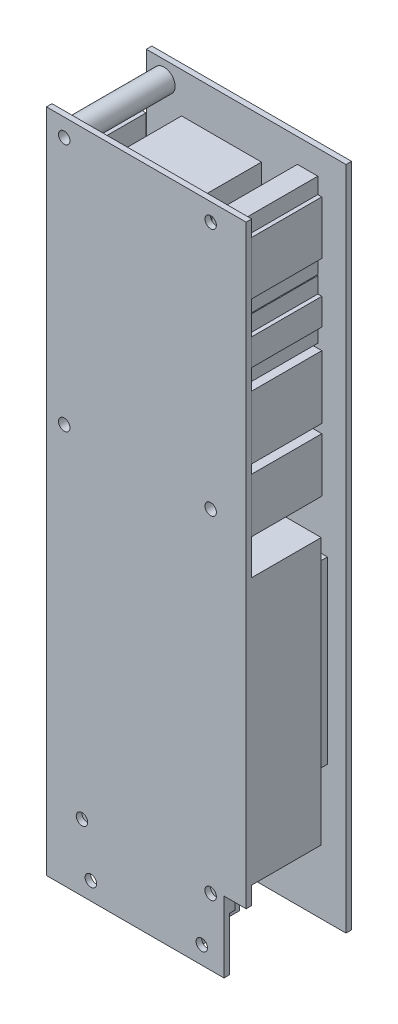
ISO-10303-21;
HEADER;
FILE_DESCRIPTION(('STEP AP214'),'2;1');
FILE_NAME('part.step','',(''),(''),'','','');
FILE_SCHEMA(('AUTOMOTIVE_DESIGN { 1 0 10303 214 1 1 1 1 }'));
ENDSEC;
DATA;
#1=APPLICATION_CONTEXT('core data for automotive mechanical design processes');
#2=APPLICATION_PROTOCOL_DEFINITION('international standard','automotive_design',2000,#1);
#3=PRODUCT_CONTEXT('',#1,'mechanical');
#4=PRODUCT('Part','Part','',(#3));
#5=PRODUCT_RELATED_PRODUCT_CATEGORY('part','',(#4));
#6=PRODUCT_DEFINITION_FORMATION('','',#4);
#7=PRODUCT_DEFINITION_CONTEXT('part definition',#1,'design');
#8=PRODUCT_DEFINITION('design','',#6,#7);
#9=PRODUCT_DEFINITION_SHAPE('','',#8);
#10=(LENGTH_UNIT() NAMED_UNIT(*) SI_UNIT(.MILLI.,.METRE.));
#11=(NAMED_UNIT(*) PLANE_ANGLE_UNIT() SI_UNIT($,.RADIAN.));
#12=(NAMED_UNIT(*) SI_UNIT($,.STERADIAN.) SOLID_ANGLE_UNIT());
#13=UNCERTAINTY_MEASURE_WITH_UNIT(LENGTH_MEASURE(1.E-05),#10,'distance_accuracy_value','');
#14=(GEOMETRIC_REPRESENTATION_CONTEXT(3) GLOBAL_UNCERTAINTY_ASSIGNED_CONTEXT((#13)) GLOBAL_UNIT_ASSIGNED_CONTEXT((#10,
#11,#12)) REPRESENTATION_CONTEXT('',''));
#15=CARTESIAN_POINT('',(0.,0.,0.));
#16=DIRECTION('',(0.,0.,1.));
#17=DIRECTION('',(1.,0.,0.));
#18=AXIS2_PLACEMENT_3D('',#15,#16,#17);
#19=CARTESIAN_POINT('',(-16.51508,21.2598,-9.525));
#20=DIRECTION('',(0.,0.,1.));
#21=DIRECTION('',(1.,0.,0.));
#22=AXIS2_PLACEMENT_3D('',#19,#20,#21);
#23=PLANE('',#22);
#24=DIRECTION('',(0.,-1.,0.));
#25=VECTOR('',#24,1.);
#26=CARTESIAN_POINT('',(-16.51508,1.2446,-9.525));
#27=LINE('',#26,#25);
#28=CARTESIAN_POINT('',(-16.51508,21.2598,-9.525));
#29=VERTEX_POINT('',#28);
#30=CARTESIAN_POINT('',(-16.51508,1.2446,-9.525));
#31=VERTEX_POINT('',#30);
#32=EDGE_CURVE('E846',#29,#31,#27,.T.);
#33=ORIENTED_EDGE('',*,*,#32,.T.);
#34=DIRECTION('',(-1.,0.,0.));
#35=VECTOR('',#34,1.);
#36=CARTESIAN_POINT('',(-16.51508,1.2446,-9.525));
#37=LINE('',#36,#35);
#38=CARTESIAN_POINT('',(-25.40508,1.2446,-9.525));
#39=VERTEX_POINT('',#38);
#40=EDGE_CURVE('E849',#31,#39,#37,.T.);
#41=ORIENTED_EDGE('',*,*,#40,.T.);
#42=DIRECTION('',(0.,1.,0.));
#43=VECTOR('',#42,1.);
#44=CARTESIAN_POINT('',(-25.40508,1.2446,-9.525));
#45=LINE('',#44,#43);
#46=CARTESIAN_POINT('',(-25.40508,21.2598,-9.525));
#47=VERTEX_POINT('',#46);
#48=EDGE_CURVE('E852',#39,#47,#45,.T.);
#49=ORIENTED_EDGE('',*,*,#48,.T.);
#50=DIRECTION('',(1.,0.,0.));
#51=VECTOR('',#50,1.);
#52=CARTESIAN_POINT('',(-16.51508,21.2598,-9.525));
#53=LINE('',#52,#51);
#54=EDGE_CURVE('E854',#47,#29,#53,.T.);
#55=ORIENTED_EDGE('',*,*,#54,.T.);
#56=EDGE_LOOP('',(#33,#41,#49,#55));
#57=FACE_BOUND('',#56,.T.);
#58=DIRECTION('',(0.,-1.,0.));
#59=VECTOR('',#58,1.);
#60=CARTESIAN_POINT('',(-18.03908,2.7432,-9.525));
#61=LINE('',#60,#59);
#62=CARTESIAN_POINT('',(-18.03908,19.7612,-9.525));
#63=VERTEX_POINT('',#62);
#64=CARTESIAN_POINT('',(-18.03908,2.7432,-9.525));
#65=VERTEX_POINT('',#64);
#66=EDGE_CURVE('E836',#63,#65,#61,.T.);
#67=ORIENTED_EDGE('',*,*,#66,.F.);
#68=DIRECTION('',(1.,0.,0.));
#69=VECTOR('',#68,1.);
#70=CARTESIAN_POINT('',(-18.03908,19.7612,-9.525));
#71=LINE('',#70,#69);
#72=CARTESIAN_POINT('',(-23.88108,19.7612,-9.525));
#73=VERTEX_POINT('',#72);
#74=EDGE_CURVE('E833',#73,#63,#71,.T.);
#75=ORIENTED_EDGE('',*,*,#74,.F.);
#76=DIRECTION('',(0.,1.,0.));
#77=VECTOR('',#76,1.);
#78=CARTESIAN_POINT('',(-23.88108,2.7432,-9.525));
#79=LINE('',#78,#77);
#80=CARTESIAN_POINT('',(-23.88108,2.7432,-9.525));
#81=VERTEX_POINT('',#80);
#82=EDGE_CURVE('E51',#81,#73,#79,.T.);
#83=ORIENTED_EDGE('',*,*,#82,.F.);
#84=DIRECTION('',(-1.,0.,0.));
#85=VECTOR('',#84,1.);
#86=CARTESIAN_POINT('',(-18.03908,2.7432,-9.525));
#87=LINE('',#86,#85);
#88=EDGE_CURVE('E46',#65,#81,#87,.T.);
#89=ORIENTED_EDGE('',*,*,#88,.F.);
#90=EDGE_LOOP('',(#67,#75,#83,#89));
#91=FACE_BOUND('',#90,.T.);
#92=ADVANCED_FACE('F31',(#57,#91),#23,.F.);
#93=CARTESIAN_POINT('',(-57.15,0.,0.));
#94=DIRECTION('',(0.,0.,-1.));
#95=DIRECTION('',(-1.,0.,0.));
#96=AXIS2_PLACEMENT_3D('',#93,#94,#95);
#97=PLANE('',#96);
#98=CARTESIAN_POINT('',(-52.07,185.42,0.));
#99=DIRECTION('',(0.,0.,-1.));
#100=DIRECTION('',(-1.,0.,0.));
#101=AXIS2_PLACEMENT_3D('',#98,#99,#100);
#102=CIRCLE('',#101,3.175);
#103=CARTESIAN_POINT('',(-55.245,185.42,0.));
#104=VERTEX_POINT('',#103);
#105=EDGE_CURVE('E917',#104,#104,#102,.T.);
#106=ORIENTED_EDGE('',*,*,#105,.F.);
#107=EDGE_LOOP('',(#106));
#108=FACE_BOUND('',#107,.T.);
#109=CARTESIAN_POINT('',(-10.16,114.3,0.));
#110=DIRECTION('',(0.,0.,-1.));
#111=DIRECTION('',(-1.,0.,0.));
#112=AXIS2_PLACEMENT_3D('',#109,#110,#111);
#113=CIRCLE('',#112,3.175);
#114=CARTESIAN_POINT('',(-13.335,114.3,0.));
#115=VERTEX_POINT('',#114);
#116=EDGE_CURVE('E927',#115,#115,#113,.T.);
#117=ORIENTED_EDGE('',*,*,#116,.F.);
#118=EDGE_LOOP('',(#117));
#119=FACE_BOUND('',#118,.T.);
#120=DIRECTION('',(-1.,0.,0.));
#121=VECTOR('',#120,1.);
#122=CARTESIAN_POINT('',(-52.07,1.27,0.));
#123=LINE('',#122,#121);
#124=CARTESIAN_POINT('',(-52.07,1.27,0.));
#125=VERTEX_POINT('',#124);
#126=CARTESIAN_POINT('',(-54.61,1.27,0.));
#127=VERTEX_POINT('',#126);
#128=EDGE_CURVE('E1089',#125,#127,#123,.T.);
#129=ORIENTED_EDGE('',*,*,#128,.F.);
#130=DIRECTION('',(0.,-1.,0.));
#131=VECTOR('',#130,1.);
#132=CARTESIAN_POINT('',(-52.07,1.27,0.));
#133=LINE('',#132,#131);
#134=CARTESIAN_POINT('',(-52.07,6.35,0.));
#135=VERTEX_POINT('',#134);
#136=EDGE_CURVE('E1075',#135,#125,#133,.T.);
#137=ORIENTED_EDGE('',*,*,#136,.F.);
#138=DIRECTION('',(1.,0.,0.));
#139=VECTOR('',#138,1.);
#140=CARTESIAN_POINT('',(-52.07,6.35,0.));
#141=LINE('',#140,#139);
#142=CARTESIAN_POINT('',(-54.61,6.35,0.));
#143=VERTEX_POINT('',#142);
#144=EDGE_CURVE('E1080',#143,#135,#141,.T.);
#145=ORIENTED_EDGE('',*,*,#144,.F.);
#146=DIRECTION('',(0.,1.,0.));
#147=VECTOR('',#146,1.);
#148=CARTESIAN_POINT('',(-54.61,1.27,0.));
#149=LINE('',#148,#147);
#150=EDGE_CURVE('E1091',#127,#143,#149,.T.);
#151=ORIENTED_EDGE('',*,*,#150,.F.);
#152=EDGE_LOOP('',(#129,#137,#145,#151));
#153=FACE_BOUND('',#152,.T.);
#154=DIRECTION('',(-1.,0.,0.));
#155=VECTOR('',#154,1.);
#156=CARTESIAN_POINT('',(-13.97,178.308,0.));
#157=LINE('',#156,#155);
#158=CARTESIAN_POINT('',(-13.97,178.308,0.));
#159=VERTEX_POINT('',#158);
#160=CARTESIAN_POINT('',(-36.83,178.308,0.));
#161=VERTEX_POINT('',#160);
#162=EDGE_CURVE('E1178',#159,#161,#157,.T.);
#163=ORIENTED_EDGE('',*,*,#162,.F.);
#164=DIRECTION('',(0.,-1.,0.));
#165=VECTOR('',#164,1.);
#166=CARTESIAN_POINT('',(-13.97,189.23,0.));
#167=LINE('',#166,#165);
#168=CARTESIAN_POINT('',(-13.97,189.23,0.));
#169=VERTEX_POINT('',#168);
#170=EDGE_CURVE('E1164',#169,#159,#167,.T.);
#171=ORIENTED_EDGE('',*,*,#170,.F.);
#172=DIRECTION('',(1.,0.,0.));
#173=VECTOR('',#172,1.);
#174=CARTESIAN_POINT('',(-13.97,189.23,0.));
#175=LINE('',#174,#173);
#176=CARTESIAN_POINT('',(-36.83,189.23,0.));
#177=VERTEX_POINT('',#176);
#178=EDGE_CURVE('E1169',#177,#169,#175,.T.);
#179=ORIENTED_EDGE('',*,*,#178,.F.);
#180=DIRECTION('',(0.,1.,0.));
#181=VECTOR('',#180,1.);
#182=CARTESIAN_POINT('',(-36.83,189.23,0.));
#183=LINE('',#182,#181);
#184=EDGE_CURVE('E1180',#161,#177,#183,.T.);
#185=ORIENTED_EDGE('',*,*,#184,.F.);
#186=EDGE_LOOP('',(#163,#171,#179,#185));
#187=FACE_BOUND('',#186,.T.);
#188=DIRECTION('',(-1.,0.,0.));
#189=VECTOR('',#188,1.);
#190=CARTESIAN_POINT('',(-7.62,126.8984,0.));
#191=LINE('',#190,#189);
#192=CARTESIAN_POINT('',(-7.62,126.8984,0.));
#193=VERTEX_POINT('',#192);
#194=CARTESIAN_POINT('',(-13.335,126.8984,0.));
#195=VERTEX_POINT('',#194);
#196=EDGE_CURVE('E1370',#193,#195,#191,.T.);
#197=ORIENTED_EDGE('',*,*,#196,.F.);
#198=DIRECTION('',(0.,-1.,0.));
#199=VECTOR('',#198,1.);
#200=CARTESIAN_POINT('',(-7.62,147.574,0.));
#201=LINE('',#200,#199);
#202=CARTESIAN_POINT('',(-7.62,147.574,0.));
#203=VERTEX_POINT('',#202);
#204=EDGE_CURVE('E1356',#203,#193,#201,.T.);
#205=ORIENTED_EDGE('',*,*,#204,.F.);
#206=DIRECTION('',(1.,0.,0.));
#207=VECTOR('',#206,1.);
#208=CARTESIAN_POINT('',(-7.62,147.574,0.));
#209=LINE('',#208,#207);
#210=CARTESIAN_POINT('',(-13.335,147.574,0.));
#211=VERTEX_POINT('',#210);
#212=EDGE_CURVE('E1361',#211,#203,#209,.T.);
#213=ORIENTED_EDGE('',*,*,#212,.F.);
#214=DIRECTION('',(0.,1.,0.));
#215=VECTOR('',#214,1.);
#216=CARTESIAN_POINT('',(-13.335,147.574,0.));
#217=LINE('',#216,#215);
#218=EDGE_CURVE('E1372',#195,#211,#217,.T.);
#219=ORIENTED_EDGE('',*,*,#218,.F.);
#220=EDGE_LOOP('',(#197,#205,#213,#219));
#221=FACE_BOUND('',#220,.T.);
#222=DIRECTION('',(1.,0.,0.));
#223=VECTOR('',#222,1.);
#224=CARTESIAN_POINT('',(-7.239,165.608,0.));
#225=LINE('',#224,#223);
#226=CARTESIAN_POINT('',(-7.239,165.608,0.));
#227=VERTEX_POINT('',#226);
#228=CARTESIAN_POINT('',(-1.397,165.608,0.));
#229=VERTEX_POINT('',#228);
#230=EDGE_CURVE('E1444',#227,#229,#225,.T.);
#231=ORIENTED_EDGE('',*,*,#230,.F.);
#232=DIRECTION('',(0.,1.,0.));
#233=VECTOR('',#232,1.);
#234=CARTESIAN_POINT('',(-7.239,165.608,0.));
#235=LINE('',#234,#233);
#236=CARTESIAN_POINT('',(-7.239,161.036,0.));
#237=VERTEX_POINT('',#236);
#238=EDGE_CURVE('E1414',#237,#227,#235,.T.);
#239=ORIENTED_EDGE('',*,*,#238,.F.);
#240=DIRECTION('',(1.,0.,0.));
#241=VECTOR('',#240,1.);
#242=CARTESIAN_POINT('',(-7.239,161.036,0.));
#243=LINE('',#242,#241);
#244=CARTESIAN_POINT('',(-11.3284,161.036,0.));
#245=VERTEX_POINT('',#244);
#246=EDGE_CURVE('E1419',#245,#237,#243,.T.);
#247=ORIENTED_EDGE('',*,*,#246,.F.);
#248=DIRECTION('',(0.,1.,0.));
#249=VECTOR('',#248,1.);
#250=CARTESIAN_POINT('',(-11.3284,161.036,0.));
#251=LINE('',#250,#249);
#252=CARTESIAN_POINT('',(-11.3284,153.416,0.));
#253=VERTEX_POINT('',#252);
#254=EDGE_CURVE('E1462',#253,#245,#251,.T.);
#255=ORIENTED_EDGE('',*,*,#254,.F.);
#256=DIRECTION('',(-1.,0.,0.));
#257=VECTOR('',#256,1.);
#258=CARTESIAN_POINT('',(-7.239,153.416,0.));
#259=LINE('',#258,#257);
#260=CARTESIAN_POINT('',(-7.239,153.416,0.));
#261=VERTEX_POINT('',#260);
#262=EDGE_CURVE('E1460',#261,#253,#259,.T.);
#263=ORIENTED_EDGE('',*,*,#262,.F.);
#264=DIRECTION('',(0.,1.,0.));
#265=VECTOR('',#264,1.);
#266=CARTESIAN_POINT('',(-7.239,153.416,0.));
#267=LINE('',#266,#265);
#268=CARTESIAN_POINT('',(-7.239,148.844,0.));
#269=VERTEX_POINT('',#268);
#270=EDGE_CURVE('E1458',#269,#261,#267,.T.);
#271=ORIENTED_EDGE('',*,*,#270,.F.);
#272=DIRECTION('',(-1.,0.,0.));
#273=VECTOR('',#272,1.);
#274=CARTESIAN_POINT('',(-7.239,148.844,0.));
#275=LINE('',#274,#273);
#276=CARTESIAN_POINT('',(-1.397,148.844,0.));
#277=VERTEX_POINT('',#276);
#278=EDGE_CURVE('E1456',#277,#269,#275,.T.);
#279=ORIENTED_EDGE('',*,*,#278,.F.);
#280=DIRECTION('',(0.,-1.,0.));
#281=VECTOR('',#280,1.);
#282=CARTESIAN_POINT('',(-1.397,153.416,0.));
#283=LINE('',#282,#281);
#284=CARTESIAN_POINT('',(-1.397,153.416,0.));
#285=VERTEX_POINT('',#284);
#286=EDGE_CURVE('E1454',#285,#277,#283,.T.);
#287=ORIENTED_EDGE('',*,*,#286,.F.);
#288=DIRECTION('',(-1.,0.,0.));
#289=VECTOR('',#288,1.);
#290=CARTESIAN_POINT('',(-1.397,153.416,0.));
#291=LINE('',#290,#289);
#292=CARTESIAN_POINT('',(-0.254000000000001,153.416,0.));
#293=VERTEX_POINT('',#292);
#294=EDGE_CURVE('E1452',#293,#285,#291,.T.);
#295=ORIENTED_EDGE('',*,*,#294,.F.);
#296=DIRECTION('',(0.,-1.,0.));
#297=VECTOR('',#296,1.);
#298=CARTESIAN_POINT('',(-0.254,161.036,0.));
#299=LINE('',#298,#297);
#300=CARTESIAN_POINT('',(-0.254,161.036,0.));
#301=VERTEX_POINT('',#300);
#302=EDGE_CURVE('E1450',#301,#293,#299,.T.);
#303=ORIENTED_EDGE('',*,*,#302,.F.);
#304=DIRECTION('',(1.,0.,0.));
#305=VECTOR('',#304,1.);
#306=CARTESIAN_POINT('',(-1.397,161.036,0.));
#307=LINE('',#306,#305);
#308=CARTESIAN_POINT('',(-1.397,161.036,0.));
#309=VERTEX_POINT('',#308);
#310=EDGE_CURVE('E1448',#309,#301,#307,.T.);
#311=ORIENTED_EDGE('',*,*,#310,.F.);
#312=DIRECTION('',(0.,-1.,0.));
#313=VECTOR('',#312,1.);
#314=CARTESIAN_POINT('',(-1.397,165.608,0.));
#315=LINE('',#314,#313);
#316=EDGE_CURVE('E1446',#229,#309,#315,.T.);
#317=ORIENTED_EDGE('',*,*,#316,.F.);
#318=EDGE_LOOP('',(#231,#239,#247,#255,#263,#271,#279,#287,#295,#303,#311,#317));
#319=FACE_BOUND('',#318,.T.);
#320=CARTESIAN_POINT('',(-10.16,185.42,0.));
#321=DIRECTION('',(0.,0.,1.));
#322=DIRECTION('',(1.,0.,0.));
#323=AXIS2_PLACEMENT_3D('',#320,#321,#322);
#324=CIRCLE('',#323,1.6383);
#325=CARTESIAN_POINT('',(-8.54150968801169,185.674,0.));
#326=VERTEX_POINT('',#325);
#327=CARTESIAN_POINT('',(-11.3284,184.271580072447,0.));
#328=VERTEX_POINT('',#327);
#329=EDGE_CURVE('E1898',#326,#328,#324,.T.);
#330=ORIENTED_EDGE('',*,*,#329,.T.);
#331=DIRECTION('',(0.,1.,0.));
#332=VECTOR('',#331,1.);
#333=CARTESIAN_POINT('',(-11.3284,185.674,0.));
#334=LINE('',#333,#332);
#335=CARTESIAN_POINT('',(-11.3284,170.434,0.));
#336=VERTEX_POINT('',#335);
#337=EDGE_CURVE('E1586',#336,#328,#334,.T.);
#338=ORIENTED_EDGE('',*,*,#337,.F.);
#339=DIRECTION('',(-1.,0.,0.));
#340=VECTOR('',#339,1.);
#341=CARTESIAN_POINT('',(-7.239,170.434,0.));
#342=LINE('',#341,#340);
#343=CARTESIAN_POINT('',(-7.23900000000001,170.434,0.));
#344=VERTEX_POINT('',#343);
#345=EDGE_CURVE('E1582',#344,#336,#342,.T.);
#346=ORIENTED_EDGE('',*,*,#345,.F.);
#347=DIRECTION('',(0.,1.,0.));
#348=VECTOR('',#347,1.);
#349=CARTESIAN_POINT('',(-7.239,170.434,0.));
#350=LINE('',#349,#348);
#351=CARTESIAN_POINT('',(-7.239,165.862,0.));
#352=VERTEX_POINT('',#351);
#353=EDGE_CURVE('E1579',#352,#344,#350,.T.);
#354=ORIENTED_EDGE('',*,*,#353,.F.);
#355=DIRECTION('',(-1.,0.,0.));
#356=VECTOR('',#355,1.);
#357=CARTESIAN_POINT('',(-7.239,165.862,0.));
#358=LINE('',#357,#356);
#359=CARTESIAN_POINT('',(-1.397,165.862,0.));
#360=VERTEX_POINT('',#359);
#361=EDGE_CURVE('E1576',#360,#352,#358,.T.);
#362=ORIENTED_EDGE('',*,*,#361,.F.);
#363=DIRECTION('',(0.,-1.,0.));
#364=VECTOR('',#363,1.);
#365=CARTESIAN_POINT('',(-1.397,170.434,0.));
#366=LINE('',#365,#364);
#367=CARTESIAN_POINT('',(-1.397,170.434,0.));
#368=VERTEX_POINT('',#367);
#369=EDGE_CURVE('E1573',#368,#360,#366,.T.);
#370=ORIENTED_EDGE('',*,*,#369,.F.);
#371=DIRECTION('',(-1.,0.,0.));
#372=VECTOR('',#371,1.);
#373=CARTESIAN_POINT('',(-1.397,170.434,0.));
#374=LINE('',#373,#372);
#375=CARTESIAN_POINT('',(-0.253999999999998,170.434,0.));
#376=VERTEX_POINT('',#375);
#377=EDGE_CURVE('E1570',#376,#368,#374,.T.);
#378=ORIENTED_EDGE('',*,*,#377,.F.);
#379=DIRECTION('',(0.,-1.,0.));
#380=VECTOR('',#379,1.);
#381=CARTESIAN_POINT('',(-0.253999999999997,185.674,0.));
#382=LINE('',#381,#380);
#383=CARTESIAN_POINT('',(-0.253999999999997,185.674,0.));
#384=VERTEX_POINT('',#383);
#385=EDGE_CURVE('E1567',#384,#376,#382,.T.);
#386=ORIENTED_EDGE('',*,*,#385,.F.);
#387=DIRECTION('',(1.,0.,0.));
#388=VECTOR('',#387,1.);
#389=CARTESIAN_POINT('',(-1.397,185.674,0.));
#390=LINE('',#389,#388);
#391=CARTESIAN_POINT('',(-1.397,185.674,0.));
#392=VERTEX_POINT('',#391);
#393=EDGE_CURVE('E1564',#392,#384,#390,.T.);
#394=ORIENTED_EDGE('',*,*,#393,.F.);
#395=DIRECTION('',(0.,-1.,0.));
#396=VECTOR('',#395,1.);
#397=CARTESIAN_POINT('',(-1.397,190.246,0.));
#398=LINE('',#397,#396);
#399=CARTESIAN_POINT('',(-1.397,190.246,0.));
#400=VERTEX_POINT('',#399);
#401=EDGE_CURVE('E1561',#400,#392,#398,.T.);
#402=ORIENTED_EDGE('',*,*,#401,.F.);
#403=DIRECTION('',(1.,0.,0.));
#404=VECTOR('',#403,1.);
#405=CARTESIAN_POINT('',(-7.239,190.246,0.));
#406=LINE('',#405,#404);
#407=CARTESIAN_POINT('',(-7.23899999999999,190.246,0.));
#408=VERTEX_POINT('',#407);
#409=EDGE_CURVE('E1558',#408,#400,#406,.T.);
#410=ORIENTED_EDGE('',*,*,#409,.F.);
#411=DIRECTION('',(0.,1.,0.));
#412=VECTOR('',#411,1.);
#413=CARTESIAN_POINT('',(-7.239,190.246,0.));
#414=LINE('',#413,#412);
#415=CARTESIAN_POINT('',(-7.239,185.674,0.));
#416=VERTEX_POINT('',#415);
#417=EDGE_CURVE('E1528',#416,#408,#414,.T.);
#418=ORIENTED_EDGE('',*,*,#417,.F.);
#419=DIRECTION('',(1.,0.,0.));
#420=VECTOR('',#419,1.);
#421=CARTESIAN_POINT('',(-7.239,185.674,0.));
#422=LINE('',#421,#420);
#423=EDGE_CURVE('E1589',#326,#416,#422,.T.);
#424=ORIENTED_EDGE('',*,*,#423,.F.);
#425=EDGE_LOOP('',(#330,#338,#346,#354,#362,#370,#378,#386,#394,#402,#410,#418,#424));
#426=FACE_BOUND('',#425,.T.);
#427=CARTESIAN_POINT('',(-12.7,5.08000000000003,0.));
#428=DIRECTION('',(0.,0.,1.));
#429=DIRECTION('',(1.,0.,0.));
#430=AXIS2_PLACEMENT_3D('',#427,#428,#429);
#431=CIRCLE('',#430,1.6383);
#432=CARTESIAN_POINT('',(-11.0617,5.08000000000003,0.));
#433=VERTEX_POINT('',#432);
#434=EDGE_CURVE('E1884',#433,#433,#431,.T.);
#435=ORIENTED_EDGE('',*,*,#434,.T.);
#436=EDGE_LOOP('',(#435));
#437=FACE_BOUND('',#436,.T.);
#438=CARTESIAN_POINT('',(-44.45,5.08000000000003,0.));
#439=DIRECTION('',(0.,0.,1.));
#440=DIRECTION('',(1.,0.,0.));
#441=AXIS2_PLACEMENT_3D('',#438,#439,#440);
#442=CIRCLE('',#441,1.6383);
#443=CARTESIAN_POINT('',(-42.8117,5.08000000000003,0.));
#444=VERTEX_POINT('',#443);
#445=EDGE_CURVE('E1885',#444,#444,#442,.T.);
#446=ORIENTED_EDGE('',*,*,#445,.T.);
#447=EDGE_LOOP('',(#446));
#448=FACE_BOUND('',#447,.T.);
#449=DIRECTION('',(-1.,0.,0.));
#450=VECTOR('',#449,1.);
#451=CARTESIAN_POINT('',(-12.065,104.14,0.));
#452=LINE('',#451,#450);
#453=CARTESIAN_POINT('',(-12.065,104.14,0.));
#454=VERTEX_POINT('',#453);
#455=CARTESIAN_POINT('',(-50.165,104.14,0.));
#456=VERTEX_POINT('',#455);
#457=EDGE_CURVE('E1641',#454,#456,#452,.T.);
#458=ORIENTED_EDGE('',*,*,#457,.F.);
#459=DIRECTION('',(0.,-1.,0.));
#460=VECTOR('',#459,1.);
#461=CARTESIAN_POINT('',(-12.065,110.1852,0.));
#462=LINE('',#461,#460);
#463=CARTESIAN_POINT('',(-12.065,110.1852,0.));
#464=VERTEX_POINT('',#463);
#465=EDGE_CURVE('E1627',#464,#454,#462,.T.);
#466=ORIENTED_EDGE('',*,*,#465,.F.);
#467=DIRECTION('',(1.,0.,0.));
#468=VECTOR('',#467,1.);
#469=CARTESIAN_POINT('',(-12.065,110.1852,0.));
#470=LINE('',#469,#468);
#471=CARTESIAN_POINT('',(-50.165,110.1852,0.));
#472=VERTEX_POINT('',#471);
#473=EDGE_CURVE('E1632',#472,#464,#470,.T.);
#474=ORIENTED_EDGE('',*,*,#473,.F.);
#475=DIRECTION('',(0.,1.,0.));
#476=VECTOR('',#475,1.);
#477=CARTESIAN_POINT('',(-50.165,110.1852,0.));
#478=LINE('',#477,#476);
#479=EDGE_CURVE('E1643',#456,#472,#478,.T.);
#480=ORIENTED_EDGE('',*,*,#479,.F.);
#481=EDGE_LOOP('',(#458,#466,#474,#480));
#482=FACE_BOUND('',#481,.T.);
#483=DIRECTION('',(-1.,0.,0.));
#484=VECTOR('',#483,1.);
#485=CARTESIAN_POINT('',(-50.546,167.3098,0.));
#486=LINE('',#485,#484);
#487=CARTESIAN_POINT('',(-50.546,167.3098,0.));
#488=VERTEX_POINT('',#487);
#489=CARTESIAN_POINT('',(-56.896,167.3098,0.));
#490=VERTEX_POINT('',#489);
#491=EDGE_CURVE('E1513',#488,#490,#486,.T.);
#492=ORIENTED_EDGE('',*,*,#491,.F.);
#493=DIRECTION('',(0.,-1.,0.));
#494=VECTOR('',#493,1.);
#495=CARTESIAN_POINT('',(-50.546,181.356,0.));
#496=LINE('',#495,#494);
#497=CARTESIAN_POINT('',(-50.546,181.356,0.));
#498=VERTEX_POINT('',#497);
#499=EDGE_CURVE('E1499',#498,#488,#496,.T.);
#500=ORIENTED_EDGE('',*,*,#499,.F.);
#501=DIRECTION('',(1.,0.,0.));
#502=VECTOR('',#501,1.);
#503=CARTESIAN_POINT('',(-50.546,181.356,0.));
#504=LINE('',#503,#502);
#505=CARTESIAN_POINT('',(-56.896,181.356,0.));
#506=VERTEX_POINT('',#505);
#507=EDGE_CURVE('E1504',#506,#498,#504,.T.);
#508=ORIENTED_EDGE('',*,*,#507,.F.);
#509=DIRECTION('',(0.,1.,0.));
#510=VECTOR('',#509,1.);
#511=CARTESIAN_POINT('',(-56.896,181.356,0.));
#512=LINE('',#511,#510);
#513=EDGE_CURVE('E1515',#490,#506,#512,.T.);
#514=ORIENTED_EDGE('',*,*,#513,.F.);
#515=EDGE_LOOP('',(#492,#500,#508,#514));
#516=FACE_BOUND('',#515,.T.);
#517=DIRECTION('',(-1.,0.,0.));
#518=VECTOR('',#517,1.);
#519=CARTESIAN_POINT('',(-0.254000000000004,129.54,0.));
#520=LINE('',#519,#518);
#521=CARTESIAN_POINT('',(-0.254000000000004,129.54,0.));
#522=VERTEX_POINT('',#521);
#523=CARTESIAN_POINT('',(-5.969,129.54,0.));
#524=VERTEX_POINT('',#523);
#525=EDGE_CURVE('E1399',#522,#524,#520,.T.);
#526=ORIENTED_EDGE('',*,*,#525,.F.);
#527=DIRECTION('',(0.,-1.,0.));
#528=VECTOR('',#527,1.);
#529=CARTESIAN_POINT('',(-0.254000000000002,147.574,0.));
#530=LINE('',#529,#528);
#531=CARTESIAN_POINT('',(-0.254000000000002,147.574,0.));
#532=VERTEX_POINT('',#531);
#533=EDGE_CURVE('E1385',#532,#522,#530,.T.);
#534=ORIENTED_EDGE('',*,*,#533,.F.);
#535=DIRECTION('',(1.,0.,0.));
#536=VECTOR('',#535,1.);
#537=CARTESIAN_POINT('',(-0.254000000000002,147.574,0.));
#538=LINE('',#537,#536);
#539=CARTESIAN_POINT('',(-5.969,147.574,0.));
#540=VERTEX_POINT('',#539);
#541=EDGE_CURVE('E1390',#540,#532,#538,.T.);
#542=ORIENTED_EDGE('',*,*,#541,.F.);
#543=DIRECTION('',(0.,1.,0.));
#544=VECTOR('',#543,1.);
#545=CARTESIAN_POINT('',(-5.969,147.574,0.));
#546=LINE('',#545,#544);
#547=EDGE_CURVE('E1401',#524,#540,#546,.T.);
#548=ORIENTED_EDGE('',*,*,#547,.F.);
#549=EDGE_LOOP('',(#526,#534,#542,#548));
#550=FACE_BOUND('',#549,.T.);
#551=DIRECTION('',(-1.,0.,0.));
#552=VECTOR('',#551,1.);
#553=CARTESIAN_POINT('',(-0.254000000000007,111.506,0.));
#554=LINE('',#553,#552);
#555=CARTESIAN_POINT('',(-0.254000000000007,111.506,0.));
#556=VERTEX_POINT('',#555);
#557=CARTESIAN_POINT('',(-5.96900000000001,111.506,0.));
#558=VERTEX_POINT('',#557);
#559=EDGE_CURVE('E1341',#556,#558,#554,.T.);
#560=ORIENTED_EDGE('',*,*,#559,.F.);
#561=DIRECTION('',(0.,-1.,0.));
#562=VECTOR('',#561,1.);
#563=CARTESIAN_POINT('',(-0.254000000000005,127.,0.));
#564=LINE('',#563,#562);
#565=CARTESIAN_POINT('',(-0.254000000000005,127.,0.));
#566=VERTEX_POINT('',#565);
#567=EDGE_CURVE('E1327',#566,#556,#564,.T.);
#568=ORIENTED_EDGE('',*,*,#567,.F.);
#569=DIRECTION('',(1.,0.,0.));
#570=VECTOR('',#569,1.);
#571=CARTESIAN_POINT('',(-0.254000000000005,127.,0.));
#572=LINE('',#571,#570);
#573=CARTESIAN_POINT('',(-5.969,127.,0.));
#574=VERTEX_POINT('',#573);
#575=EDGE_CURVE('E1332',#574,#566,#572,.T.);
#576=ORIENTED_EDGE('',*,*,#575,.F.);
#577=DIRECTION('',(0.,1.,0.));
#578=VECTOR('',#577,1.);
#579=CARTESIAN_POINT('',(-5.969,127.,0.));
#580=LINE('',#579,#578);
#581=EDGE_CURVE('E1343',#558,#574,#580,.T.);
#582=ORIENTED_EDGE('',*,*,#581,.F.);
#583=EDGE_LOOP('',(#560,#568,#576,#582));
#584=FACE_BOUND('',#583,.T.);
#585=DIRECTION('',(-1.,0.,0.));
#586=VECTOR('',#585,1.);
#587=CARTESIAN_POINT('',(-25.146,156.658606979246,0.));
#588=LINE('',#587,#586);
#589=CARTESIAN_POINT('',(-25.146,156.658606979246,0.));
#590=VERTEX_POINT('',#589);
#591=CARTESIAN_POINT('',(-56.896,156.658606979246,0.));
#592=VERTEX_POINT('',#591);
#593=EDGE_CURVE('E1734',#590,#592,#588,.T.);
#594=ORIENTED_EDGE('',*,*,#593,.F.);
#595=DIRECTION('',(0.,1.,0.));
#596=VECTOR('',#595,1.);
#597=CARTESIAN_POINT('',(-25.146,0.,0.));
#598=LINE('',#597,#596);
#599=CARTESIAN_POINT('',(-25.146,157.793393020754,0.));
#600=VERTEX_POINT('',#599);
#601=EDGE_CURVE('E1737',#590,#600,#598,.T.);
#602=ORIENTED_EDGE('',*,*,#601,.T.);
#603=DIRECTION('',(-1.,0.,0.));
#604=VECTOR('',#603,1.);
#605=CARTESIAN_POINT('',(-25.146,157.793393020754,0.));
#606=LINE('',#605,#604);
#607=CARTESIAN_POINT('',(-56.896,157.793393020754,0.));
#608=VERTEX_POINT('',#607);
#609=EDGE_CURVE('E1731',#608,#600,#606,.F.);
#610=ORIENTED_EDGE('',*,*,#609,.F.);
#611=DIRECTION('',(0.,1.,0.));
#612=VECTOR('',#611,1.);
#613=CARTESIAN_POINT('',(-56.896,0.,0.));
#614=LINE('',#613,#612);
#615=EDGE_CURVE('E1728',#592,#608,#614,.T.);
#616=ORIENTED_EDGE('',*,*,#615,.F.);
#617=EDGE_LOOP('',(#594,#602,#610,#616));
#618=FACE_BOUND('',#617,.T.);
#619=DIRECTION('',(-1.,0.,0.));
#620=VECTOR('',#619,1.);
#621=CARTESIAN_POINT('',(-52.07,8.89,0.));
#622=LINE('',#621,#620);
#623=CARTESIAN_POINT('',(-52.07,8.89,0.));
#624=VERTEX_POINT('',#623);
#625=CARTESIAN_POINT('',(-54.61,8.89,0.));
#626=VERTEX_POINT('',#625);
#627=EDGE_CURVE('E1060',#624,#626,#622,.T.);
#628=ORIENTED_EDGE('',*,*,#627,.F.);
#629=DIRECTION('',(0.,-1.,0.));
#630=VECTOR('',#629,1.);
#631=CARTESIAN_POINT('',(-52.07,8.89,0.));
#632=LINE('',#631,#630);
#633=CARTESIAN_POINT('',(-52.07,13.97,0.));
#634=VERTEX_POINT('',#633);
#635=EDGE_CURVE('E1046',#634,#624,#632,.T.);
#636=ORIENTED_EDGE('',*,*,#635,.F.);
#637=DIRECTION('',(1.,0.,0.));
#638=VECTOR('',#637,1.);
#639=CARTESIAN_POINT('',(-52.07,13.97,0.));
#640=LINE('',#639,#638);
#641=CARTESIAN_POINT('',(-54.61,13.97,0.));
#642=VERTEX_POINT('',#641);
#643=EDGE_CURVE('E1051',#642,#634,#640,.T.);
#644=ORIENTED_EDGE('',*,*,#643,.F.);
#645=DIRECTION('',(0.,1.,0.));
#646=VECTOR('',#645,1.);
#647=CARTESIAN_POINT('',(-54.61,8.89,0.));
#648=LINE('',#647,#646);
#649=EDGE_CURVE('E1062',#626,#642,#648,.T.);
#650=ORIENTED_EDGE('',*,*,#649,.F.);
#651=EDGE_LOOP('',(#628,#636,#644,#650));
#652=FACE_BOUND('',#651,.T.);
#653=CARTESIAN_POINT('',(-52.07,114.3,0.));
#654=DIRECTION('',(0.,0.,-1.));
#655=DIRECTION('',(-1.,0.,0.));
#656=AXIS2_PLACEMENT_3D('',#653,#654,#655);
#657=CIRCLE('',#656,3.175);
#658=CARTESIAN_POINT('',(-55.245,114.3,0.));
#659=VERTEX_POINT('',#658);
#660=EDGE_CURVE('E921',#659,#659,#657,.T.);
#661=ORIENTED_EDGE('',*,*,#660,.F.);
#662=EDGE_LOOP('',(#661));
#663=FACE_BOUND('',#662,.T.);
#664=DIRECTION('',(-1.,0.,0.));
#665=VECTOR('',#664,1.);
#666=CARTESIAN_POINT('',(-16.51508,1.2446,0.));
#667=LINE('',#666,#665);
#668=CARTESIAN_POINT('',(-16.51508,1.2446,0.));
#669=VERTEX_POINT('',#668);
#670=CARTESIAN_POINT('',(-25.40508,1.2446,0.));
#671=VERTEX_POINT('',#670);
#672=EDGE_CURVE('E840',#669,#671,#667,.T.);
#673=ORIENTED_EDGE('',*,*,#672,.F.);
#674=DIRECTION('',(0.,-1.,0.));
#675=VECTOR('',#674,1.);
#676=CARTESIAN_POINT('',(-16.51508,1.2446,0.));
#677=LINE('',#676,#675);
#678=CARTESIAN_POINT('',(-16.51508,15.24,0.));
#679=VERTEX_POINT('',#678);
#680=EDGE_CURVE('E837',#679,#669,#677,.T.);
#681=ORIENTED_EDGE('',*,*,#680,.F.);
#682=DIRECTION('',(-1.,0.,0.));
#683=VECTOR('',#682,1.);
#684=CARTESIAN_POINT('',(-6.35,15.24,0.));
#685=LINE('',#684,#683);
#686=CARTESIAN_POINT('',(-6.35,15.24,0.));
#687=VERTEX_POINT('',#686);
#688=EDGE_CURVE('E1277',#687,#679,#685,.T.);
#689=ORIENTED_EDGE('',*,*,#688,.F.);
#690=DIRECTION('',(0.,1.,0.));
#691=VECTOR('',#690,1.);
#692=CARTESIAN_POINT('',(-6.35,0.,0.));
#693=LINE('',#692,#691);
#694=CARTESIAN_POINT('',(-6.35,0.,0.));
#695=VERTEX_POINT('',#694);
#696=EDGE_CURVE('E1864',#695,#687,#693,.T.);
#697=ORIENTED_EDGE('',*,*,#696,.F.);
#698=DIRECTION('',(1.,0.,0.));
#699=VECTOR('',#698,1.);
#700=CARTESIAN_POINT('',(-57.15,0.,0.));
#701=LINE('',#700,#699);
#702=CARTESIAN_POINT('',(-57.15,0.,0.));
#703=VERTEX_POINT('',#702);
#704=EDGE_CURVE('E1842',#703,#695,#701,.T.);
#705=ORIENTED_EDGE('',*,*,#704,.F.);
#706=DIRECTION('',(0.,-1.,0.));
#707=VECTOR('',#706,1.);
#708=CARTESIAN_POINT('',(-57.15,190.5,0.));
#709=LINE('',#708,#707);
#710=CARTESIAN_POINT('',(-57.15,190.5,0.));
#711=VERTEX_POINT('',#710);
#712=EDGE_CURVE('E1816',#711,#703,#709,.T.);
#713=ORIENTED_EDGE('',*,*,#712,.F.);
#714=DIRECTION('',(-1.,0.,0.));
#715=VECTOR('',#714,1.);
#716=CARTESIAN_POINT('',(0.,190.5,0.));
#717=LINE('',#716,#715);
#718=CARTESIAN_POINT('',(0.,190.5,0.));
#719=VERTEX_POINT('',#718);
#720=EDGE_CURVE('E1807',#719,#711,#717,.T.);
#721=ORIENTED_EDGE('',*,*,#720,.F.);
#722=DIRECTION('',(0.,1.,0.));
#723=VECTOR('',#722,1.);
#724=CARTESIAN_POINT('',(0.,190.5,0.));
#725=LINE('',#724,#723);
#726=CARTESIAN_POINT('',(0.,101.6,0.));
#727=VERTEX_POINT('',#726);
#728=EDGE_CURVE('E1808',#727,#719,#725,.T.);
#729=ORIENTED_EDGE('',*,*,#728,.F.);
#730=DIRECTION('',(-1.,0.,0.));
#731=VECTOR('',#730,1.);
#732=CARTESIAN_POINT('',(-50.8,101.6,0.));
#733=LINE('',#732,#731);
#734=CARTESIAN_POINT('',(-50.8,101.6,0.));
#735=VERTEX_POINT('',#734);
#736=EDGE_CURVE('E1661',#727,#735,#733,.T.);
#737=ORIENTED_EDGE('',*,*,#736,.T.);
#738=DIRECTION('',(0.,-1.,0.));
#739=VECTOR('',#738,1.);
#740=CARTESIAN_POINT('',(-50.8,101.6,0.));
#741=LINE('',#740,#739);
#742=CARTESIAN_POINT('',(-50.8,93.218,0.));
#743=VERTEX_POINT('',#742);
#744=EDGE_CURVE('E1671',#735,#743,#741,.T.);
#745=ORIENTED_EDGE('',*,*,#744,.T.);
#746=DIRECTION('',(1.,0.,0.));
#747=VECTOR('',#746,1.);
#748=CARTESIAN_POINT('',(-50.8,93.218,0.));
#749=LINE('',#748,#747);
#750=CARTESIAN_POINT('',(-56.896,93.218,0.));
#751=VERTEX_POINT('',#750);
#752=EDGE_CURVE('E940',#751,#743,#749,.T.);
#753=ORIENTED_EDGE('',*,*,#752,.F.);
#754=DIRECTION('',(0.,1.,0.));
#755=VECTOR('',#754,1.);
#756=CARTESIAN_POINT('',(-56.896,87.122,0.));
#757=LINE('',#756,#755);
#758=CARTESIAN_POINT('',(-56.896,87.122,0.));
#759=VERTEX_POINT('',#758);
#760=EDGE_CURVE('E949',#759,#751,#757,.T.);
#761=ORIENTED_EDGE('',*,*,#760,.F.);
#762=DIRECTION('',(-1.,0.,0.));
#763=VECTOR('',#762,1.);
#764=CARTESIAN_POINT('',(-50.8,87.122,0.));
#765=LINE('',#764,#763);
#766=CARTESIAN_POINT('',(-50.8,87.122,0.));
#767=VERTEX_POINT('',#766);
#768=EDGE_CURVE('E933',#767,#759,#765,.T.);
#769=ORIENTED_EDGE('',*,*,#768,.F.);
#770=CARTESIAN_POINT('',(-50.8,77.978,0.));
#771=VERTEX_POINT('',#770);
#772=EDGE_CURVE('E1675',#767,#771,#741,.T.);
#773=ORIENTED_EDGE('',*,*,#772,.T.);
#774=DIRECTION('',(1.,0.,0.));
#775=VECTOR('',#774,1.);
#776=CARTESIAN_POINT('',(-50.8,77.978,0.));
#777=LINE('',#776,#775);
#778=CARTESIAN_POINT('',(-56.896,77.978,0.));
#779=VERTEX_POINT('',#778);
#780=EDGE_CURVE('E967',#779,#771,#777,.T.);
#781=ORIENTED_EDGE('',*,*,#780,.F.);
#782=DIRECTION('',(0.,1.,0.));
#783=VECTOR('',#782,1.);
#784=CARTESIAN_POINT('',(-56.896,71.882,0.));
#785=LINE('',#784,#783);
#786=CARTESIAN_POINT('',(-56.896,71.882,0.));
#787=VERTEX_POINT('',#786);
#788=EDGE_CURVE('E976',#787,#779,#785,.T.);
#789=ORIENTED_EDGE('',*,*,#788,.F.);
#790=DIRECTION('',(-1.,0.,0.));
#791=VECTOR('',#790,1.);
#792=CARTESIAN_POINT('',(-50.8,71.882,0.));
#793=LINE('',#792,#791);
#794=CARTESIAN_POINT('',(-50.8,71.882,0.));
#795=VERTEX_POINT('',#794);
#796=EDGE_CURVE('E962',#795,#787,#793,.T.);
#797=ORIENTED_EDGE('',*,*,#796,.F.);
#798=CARTESIAN_POINT('',(-50.8,62.738,0.));
#799=VERTEX_POINT('',#798);
#800=EDGE_CURVE('E3741',#795,#799,#741,.T.);
#801=ORIENTED_EDGE('',*,*,#800,.T.);
#802=DIRECTION('',(1.,0.,0.));
#803=VECTOR('',#802,1.);
#804=CARTESIAN_POINT('',(-50.8,62.738,0.));
#805=LINE('',#804,#803);
#806=CARTESIAN_POINT('',(-56.896,62.738,0.));
#807=VERTEX_POINT('',#806);
#808=EDGE_CURVE('E995',#807,#799,#805,.T.);
#809=ORIENTED_EDGE('',*,*,#808,.F.);
#810=DIRECTION('',(0.,1.,0.));
#811=VECTOR('',#810,1.);
#812=CARTESIAN_POINT('',(-56.896,56.642,0.));
#813=LINE('',#812,#811);
#814=CARTESIAN_POINT('',(-56.896,56.642,0.));
#815=VERTEX_POINT('',#814);
#816=EDGE_CURVE('E1004',#815,#807,#813,.T.);
#817=ORIENTED_EDGE('',*,*,#816,.F.);
#818=DIRECTION('',(-1.,0.,0.));
#819=VECTOR('',#818,1.);
#820=CARTESIAN_POINT('',(-50.8,56.642,0.));
#821=LINE('',#820,#819);
#822=CARTESIAN_POINT('',(-50.8,56.642,0.));
#823=VERTEX_POINT('',#822);
#824=EDGE_CURVE('E990',#823,#815,#821,.T.);
#825=ORIENTED_EDGE('',*,*,#824,.F.);
#826=CARTESIAN_POINT('',(-50.8,47.498,0.));
#827=VERTEX_POINT('',#826);
#828=EDGE_CURVE('E3742',#823,#827,#741,.T.);
#829=ORIENTED_EDGE('',*,*,#828,.T.);
#830=DIRECTION('',(1.,0.,0.));
#831=VECTOR('',#830,1.);
#832=CARTESIAN_POINT('',(-50.8,47.498,0.));
#833=LINE('',#832,#831);
#834=CARTESIAN_POINT('',(-56.896,47.498,0.));
#835=VERTEX_POINT('',#834);
#836=EDGE_CURVE('E1023',#835,#827,#833,.T.);
#837=ORIENTED_EDGE('',*,*,#836,.F.);
#838=DIRECTION('',(0.,1.,0.));
#839=VECTOR('',#838,1.);
#840=CARTESIAN_POINT('',(-56.896,41.402,0.));
#841=LINE('',#840,#839);
#842=CARTESIAN_POINT('',(-56.896,41.402,0.));
#843=VERTEX_POINT('',#842);
#844=EDGE_CURVE('E1032',#843,#835,#841,.T.);
#845=ORIENTED_EDGE('',*,*,#844,.F.);
#846=DIRECTION('',(-1.,0.,0.));
#847=VECTOR('',#846,1.);
#848=CARTESIAN_POINT('',(-50.8,41.402,0.));
#849=LINE('',#848,#847);
#850=CARTESIAN_POINT('',(-50.8,41.402,0.));
#851=VERTEX_POINT('',#850);
#852=EDGE_CURVE('E1018',#851,#843,#849,.T.);
#853=ORIENTED_EDGE('',*,*,#852,.F.);
#854=CARTESIAN_POINT('',(-50.8,15.24,0.));
#855=VERTEX_POINT('',#854);
#856=EDGE_CURVE('E1656',#851,#855,#741,.T.);
#857=ORIENTED_EDGE('',*,*,#856,.T.);
#858=CARTESIAN_POINT('',(-40.7645093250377,15.24,0.));
#859=VERTEX_POINT('',#858);
#860=EDGE_CURVE('E1286',#859,#855,#685,.T.);
#861=ORIENTED_EDGE('',*,*,#860,.F.);
#862=CARTESIAN_POINT('',(-34.29,9.52500000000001,0.));
#863=DIRECTION('',(0.,0.,-1.));
#864=DIRECTION('',(-1.,0.,0.));
#865=AXIS2_PLACEMENT_3D('',#862,#863,#864);
#866=CIRCLE('',#865,8.636);
#867=CARTESIAN_POINT('',(-27.8154906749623,15.24,0.));
#868=VERTEX_POINT('',#867);
#869=EDGE_CURVE('E1104',#868,#859,#866,.T.);
#870=ORIENTED_EDGE('',*,*,#869,.F.);
#871=CARTESIAN_POINT('',(-25.40508,15.24,0.));
#872=VERTEX_POINT('',#871);
#873=EDGE_CURVE('E1289',#872,#868,#685,.T.);
#874=ORIENTED_EDGE('',*,*,#873,.F.);
#875=DIRECTION('',(0.,1.,0.));
#876=VECTOR('',#875,1.);
#877=CARTESIAN_POINT('',(-25.40508,1.2446,0.));
#878=LINE('',#877,#876);
#879=EDGE_CURVE('E850',#671,#872,#878,.T.);
#880=ORIENTED_EDGE('',*,*,#879,.F.);
#881=EDGE_LOOP('',(#673,#681,#689,#697,#705,#713,#721,#729,#737,#745,#753,#761,#769,#773,#781,
#789,#797,#801,#809,#817,#825,#829,#837,#845,#853,#857,#861,#870,#874,#880));
#882=FACE_BOUND('',#881,.T.);
#883=ADVANCED_FACE('F1838',(#108,#119,#153,#187,#221,#319,#426,#437,#448,#482,#516,#550,#584,
#618,#652,#663,#882),#97,.T.);
#884=CARTESIAN_POINT('',(-6.35,40.64,-1.5875));
#885=DIRECTION('',(0.,0.,1.));
#886=DIRECTION('',(1.,0.,0.));
#887=AXIS2_PLACEMENT_3D('',#884,#885,#886);
#888=PLANE('',#887);
#889=DIRECTION('',(-0.5,-0.866025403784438,0.));
#890=VECTOR('',#889,1.);
#891=CARTESIAN_POINT('',(-24.7316251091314,51.2526362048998,-1.5875));
#892=LINE('',#891,#890);
#893=CARTESIAN_POINT('',(-43.3238257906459,19.05,-1.5875));
#894=VERTEX_POINT('',#893);
#895=CARTESIAN_POINT('',(-45.1569128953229,15.875,-1.5875));
#896=VERTEX_POINT('',#895);
#897=EDGE_CURVE('E1707',#894,#896,#892,.T.);
#898=ORIENTED_EDGE('',*,*,#897,.F.);
#899=DIRECTION('',(0.5,-0.866025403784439,0.));
#900=VECTOR('',#899,1.);
#901=CARTESIAN_POINT('',(-43.4291135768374,19.2323637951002,-1.5875));
#902=LINE('',#901,#900);
#903=CARTESIAN_POINT('',(-45.1569128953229,22.225,-1.5875));
#904=VERTEX_POINT('',#903);
#905=EDGE_CURVE('E1692',#904,#894,#902,.T.);
#906=ORIENTED_EDGE('',*,*,#905,.F.);
#907=DIRECTION('',(1.,0.,0.));
#908=VECTOR('',#907,1.);
#909=CARTESIAN_POINT('',(-6.35,22.225,-1.5875));
#910=LINE('',#909,#908);
#911=CARTESIAN_POINT('',(-48.8230871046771,22.225,-1.5875));
#912=VERTEX_POINT('',#911);
#913=EDGE_CURVE('E1695',#912,#904,#910,.T.);
#914=ORIENTED_EDGE('',*,*,#913,.F.);
#915=DIRECTION('',(0.500000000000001,0.866025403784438,0.));
#916=VECTOR('',#915,1.);
#917=CARTESIAN_POINT('',(-30.2308864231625,54.4276362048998,-1.5875));
#918=LINE('',#917,#916);
#919=CARTESIAN_POINT('',(-50.6561742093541,19.05,-1.5875));
#920=VERTEX_POINT('',#919);
#921=EDGE_CURVE('E1698',#920,#912,#918,.T.);
#922=ORIENTED_EDGE('',*,*,#921,.F.);
#923=DIRECTION('',(-0.5,0.866025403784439,0.));
#924=VECTOR('',#923,1.);
#925=CARTESIAN_POINT('',(-48.9283748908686,16.0573637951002,-1.5875));
#926=LINE('',#925,#924);
#927=CARTESIAN_POINT('',(-48.823087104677,15.875,-1.5875));
#928=VERTEX_POINT('',#927);
#929=EDGE_CURVE('E1701',#928,#920,#926,.T.);
#930=ORIENTED_EDGE('',*,*,#929,.F.);
#931=DIRECTION('',(-1.,0.,0.));
#932=VECTOR('',#931,1.);
#933=CARTESIAN_POINT('',(-6.35,15.875,-1.5875));
#934=LINE('',#933,#932);
#935=EDGE_CURVE('E1704',#896,#928,#934,.T.);
#936=ORIENTED_EDGE('',*,*,#935,.F.);
#937=EDGE_LOOP('',(#898,#906,#914,#922,#930,#936));
#938=FACE_BOUND('',#937,.T.);
#939=DIRECTION('',(0.5,-0.866025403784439,0.));
#940=VECTOR('',#939,1.);
#941=CARTESIAN_POINT('',(-15.8066135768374,35.1802216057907,-1.5875));
#942=LINE('',#941,#940);
#943=CARTESIAN_POINT('',(-8.32691289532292,22.225,-1.5875));
#944=VERTEX_POINT('',#943);
#945=CARTESIAN_POINT('',(-6.49382579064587,19.05,-1.5875));
#946=VERTEX_POINT('',#945);
#947=EDGE_CURVE('E1725',#944,#946,#942,.T.);
#948=ORIENTED_EDGE('',*,*,#947,.F.);
#949=DIRECTION('',(1.,0.,0.));
#950=VECTOR('',#949,1.);
#951=CARTESIAN_POINT('',(-6.35,22.225,-1.5875));
#952=LINE('',#951,#950);
#953=CARTESIAN_POINT('',(-11.9930871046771,22.225,-1.5875));
#954=VERTEX_POINT('',#953);
#955=EDGE_CURVE('E1710',#954,#944,#952,.T.);
#956=ORIENTED_EDGE('',*,*,#955,.F.);
#957=DIRECTION('',(0.5,0.866025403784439,0.));
#958=VECTOR('',#957,1.);
#959=CARTESIAN_POINT('',(-2.60838642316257,38.4797783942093,-1.5875));
#960=LINE('',#959,#958);
#961=CARTESIAN_POINT('',(-13.8261742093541,19.05,-1.5875));
#962=VERTEX_POINT('',#961);
#963=EDGE_CURVE('E1713',#962,#954,#960,.T.);
#964=ORIENTED_EDGE('',*,*,#963,.F.);
#965=DIRECTION('',(-0.5,0.866025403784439,0.));
#966=VECTOR('',#965,1.);
#967=CARTESIAN_POINT('',(-21.3058748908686,32.0052216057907,-1.5875));
#968=LINE('',#967,#966);
#969=CARTESIAN_POINT('',(-11.9930871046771,15.875,-1.5875));
#970=VERTEX_POINT('',#969);
#971=EDGE_CURVE('E1716',#970,#962,#968,.T.);
#972=ORIENTED_EDGE('',*,*,#971,.F.);
#973=DIRECTION('',(-1.,0.,0.));
#974=VECTOR('',#973,1.);
#975=CARTESIAN_POINT('',(-6.35,15.875,-1.5875));
#976=LINE('',#975,#974);
#977=CARTESIAN_POINT('',(-8.32691289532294,15.875,-1.5875));
#978=VERTEX_POINT('',#977);
#979=EDGE_CURVE('E1719',#978,#970,#976,.T.);
#980=ORIENTED_EDGE('',*,*,#979,.F.);
#981=DIRECTION('',(-0.500000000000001,-0.866025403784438,0.));
#982=VECTOR('',#981,1.);
#983=CARTESIAN_POINT('',(2.89087489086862,35.3047783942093,-1.5875));
#984=LINE('',#983,#982);
#985=EDGE_CURVE('E1722',#946,#978,#984,.T.);
#986=ORIENTED_EDGE('',*,*,#985,.F.);
#987=EDGE_LOOP('',(#948,#956,#964,#972,#980,#986));
#988=FACE_BOUND('',#987,.T.);
#989=DIRECTION('',(0.,-1.,0.));
#990=VECTOR('',#989,1.);
#991=CARTESIAN_POINT('',(-16.51508,40.64,-1.5875));
#992=LINE('',#991,#990);
#993=CARTESIAN_POINT('',(-16.51508,21.2598,-1.5875));
#994=VERTEX_POINT('',#993);
#995=CARTESIAN_POINT('',(-16.51508,15.24,-1.5875));
#996=VERTEX_POINT('',#995);
#997=EDGE_CURVE('E875',#994,#996,#992,.T.);
#998=ORIENTED_EDGE('',*,*,#997,.F.);
#999=DIRECTION('',(1.,0.,0.));
#1000=VECTOR('',#999,1.);
#1001=CARTESIAN_POINT('',(-6.35,21.2598,-1.5875));
#1002=LINE('',#1001,#1000);
#1003=CARTESIAN_POINT('',(-25.40508,21.2598,-1.5875));
#1004=VERTEX_POINT('',#1003);
#1005=EDGE_CURVE('E11',#1004,#994,#1002,.T.);
#1006=ORIENTED_EDGE('',*,*,#1005,.F.);
#1007=DIRECTION('',(0.,1.,0.));
#1008=VECTOR('',#1007,1.);
#1009=CARTESIAN_POINT('',(-25.40508,40.64,-1.5875));
#1010=LINE('',#1009,#1008);
#1011=CARTESIAN_POINT('',(-25.40508,15.24,-1.5875));
#1012=VERTEX_POINT('',#1011);
#1013=EDGE_CURVE('E872',#1012,#1004,#1010,.T.);
#1014=ORIENTED_EDGE('',*,*,#1013,.F.);
#1015=DIRECTION('',(-1.,0.,0.));
#1016=VECTOR('',#1015,1.);
#1017=CARTESIAN_POINT('',(-6.35,15.24,-1.5875));
#1018=LINE('',#1017,#1016);
#1019=CARTESIAN_POINT('',(-27.8154906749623,15.24,-1.5875));
#1020=VERTEX_POINT('',#1019);
#1021=EDGE_CURVE('E1282',#1012,#1020,#1018,.T.);
#1022=ORIENTED_EDGE('',*,*,#1021,.T.);
#1023=CARTESIAN_POINT('',(-34.29,9.52500000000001,-1.5875));
#1024=DIRECTION('',(0.,0.,1.));
#1025=DIRECTION('',(1.,0.,0.));
#1026=AXIS2_PLACEMENT_3D('',#1023,#1024,#1025);
#1027=CIRCLE('',#1026,8.636);
#1028=CARTESIAN_POINT('',(-40.7645093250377,15.24,-1.5875));
#1029=VERTEX_POINT('',#1028);
#1030=EDGE_CURVE('E1108',#1029,#1020,#1027,.F.);
#1031=ORIENTED_EDGE('',*,*,#1030,.F.);
#1032=CARTESIAN_POINT('',(-50.8,15.24,-1.5875));
#1033=VERTEX_POINT('',#1032);
#1034=EDGE_CURVE('E1276',#1029,#1033,#1018,.T.);
#1035=ORIENTED_EDGE('',*,*,#1034,.T.);
#1036=DIRECTION('',(0.,1.,0.));
#1037=VECTOR('',#1036,1.);
#1038=CARTESIAN_POINT('',(-50.8,15.24,-1.5875));
#1039=LINE('',#1038,#1037);
#1040=CARTESIAN_POINT('',(-50.8,25.4,-1.5875));
#1041=VERTEX_POINT('',#1040);
#1042=EDGE_CURVE('E1281',#1033,#1041,#1039,.T.);
#1043=ORIENTED_EDGE('',*,*,#1042,.T.);
#1044=DIRECTION('',(-1.,0.,0.));
#1045=VECTOR('',#1044,1.);
#1046=CARTESIAN_POINT('',(-50.8,25.4,-1.5875));
#1047=LINE('',#1046,#1045);
#1048=CARTESIAN_POINT('',(-6.35,25.4,-1.5875));
#1049=VERTEX_POINT('',#1048);
#1050=EDGE_CURVE('E1685',#1049,#1041,#1047,.T.);
#1051=ORIENTED_EDGE('',*,*,#1050,.F.);
#1052=DIRECTION('',(0.,-1.,0.));
#1053=VECTOR('',#1052,1.);
#1054=CARTESIAN_POINT('',(-6.35,15.24,-1.5875));
#1055=LINE('',#1054,#1053);
#1056=CARTESIAN_POINT('',(-6.35,15.24,-1.5875));
#1057=VERTEX_POINT('',#1056);
#1058=EDGE_CURVE('E1274',#1049,#1057,#1055,.T.);
#1059=ORIENTED_EDGE('',*,*,#1058,.T.);
#1060=EDGE_CURVE('E1278',#1057,#996,#1018,.T.);
#1061=ORIENTED_EDGE('',*,*,#1060,.T.);
#1062=EDGE_LOOP('',(#998,#1006,#1014,#1022,#1031,#1035,#1043,#1051,#1059,#1061));
#1063=FACE_BOUND('',#1062,.T.);
#1064=ADVANCED_FACE('F1769',(#938,#988,#1063),#888,.F.);
#1065=CARTESIAN_POINT('',(-6.35,15.24,-1.5875));
#1066=DIRECTION('',(0.,1.,0.));
#1067=DIRECTION('',(-1.,0.,0.));
#1068=AXIS2_PLACEMENT_3D('',#1065,#1066,#1067);
#1069=PLANE('',#1068);
#1070=DIRECTION('',(0.,0.,1.));
#1071=VECTOR('',#1070,1.);
#1072=CARTESIAN_POINT('',(-16.51508,15.24,-1.5875));
#1073=LINE('',#1072,#1071);
#1074=EDGE_CURVE('E39',#996,#679,#1073,.T.);
#1075=ORIENTED_EDGE('',*,*,#1074,.F.);
#1076=ORIENTED_EDGE('',*,*,#1060,.F.);
#1077=DIRECTION('',(0.,0.,1.));
#1078=VECTOR('',#1077,1.);
#1079=CARTESIAN_POINT('',(-6.35,15.24,-1.5875));
#1080=LINE('',#1079,#1078);
#1081=EDGE_CURVE('E1292',#1057,#687,#1080,.T.);
#1082=ORIENTED_EDGE('',*,*,#1081,.T.);
#1083=ORIENTED_EDGE('',*,*,#688,.T.);
#1084=EDGE_LOOP('',(#1075,#1076,#1082,#1083));
#1085=FACE_BOUND('',#1084,.T.);
#1086=ADVANCED_FACE('F1765',(#1085),#1069,.F.);
#1087=DIRECTION('',(0.,0.,-1.));
#1088=VECTOR('',#1087,1.);
#1089=CARTESIAN_POINT('',(-25.40508,15.24,-1.5875));
#1090=LINE('',#1089,#1088);
#1091=EDGE_CURVE('E1757',#872,#1012,#1090,.T.);
#1092=ORIENTED_EDGE('',*,*,#1091,.F.);
#1093=ORIENTED_EDGE('',*,*,#873,.T.);
#1094=DIRECTION('',(0.,0.,1.));
#1095=VECTOR('',#1094,1.);
#1096=CARTESIAN_POINT('',(-27.8154906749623,15.24,-10.16));
#1097=LINE('',#1096,#1095);
#1098=EDGE_CURVE('E1751',#1020,#868,#1097,.T.);
#1099=ORIENTED_EDGE('',*,*,#1098,.F.);
#1100=ORIENTED_EDGE('',*,*,#1021,.F.);
#1101=EDGE_LOOP('',(#1092,#1093,#1099,#1100));
#1102=FACE_BOUND('',#1101,.T.);
#1103=ADVANCED_FACE('F2137',(#1102),#1069,.F.);
#1104=CARTESIAN_POINT('',(-50.8,101.6,-19.8882));
#1105=DIRECTION('',(-1.,0.,0.));
#1106=DIRECTION('',(0.,-1.,0.));
#1107=AXIS2_PLACEMENT_3D('',#1104,#1105,#1106);
#1108=PLANE('',#1107);
#1109=ORIENTED_EDGE('',*,*,#772,.F.);
#1110=DIRECTION('',(0.,0.,1.));
#1111=VECTOR('',#1110,1.);
#1112=CARTESIAN_POINT('',(-50.8,87.122,-5.08));
#1113=LINE('',#1112,#1111);
#1114=CARTESIAN_POINT('',(-50.8,87.122,-5.08));
#1115=VERTEX_POINT('',#1114);
#1116=EDGE_CURVE('E960',#1115,#767,#1113,.T.);
#1117=ORIENTED_EDGE('',*,*,#1116,.F.);
#1118=DIRECTION('',(0.,-1.,0.));
#1119=VECTOR('',#1118,1.);
#1120=CARTESIAN_POINT('',(-50.8,87.122,-5.08));
#1121=LINE('',#1120,#1119);
#1122=CARTESIAN_POINT('',(-50.8,93.218,-5.08));
#1123=VERTEX_POINT('',#1122);
#1124=EDGE_CURVE('E936',#1123,#1115,#1121,.T.);
#1125=ORIENTED_EDGE('',*,*,#1124,.F.);
#1126=DIRECTION('',(0.,0.,1.));
#1127=VECTOR('',#1126,1.);
#1128=CARTESIAN_POINT('',(-50.8,93.218,-5.08));
#1129=LINE('',#1128,#1127);
#1130=EDGE_CURVE('E947',#1123,#743,#1129,.T.);
#1131=ORIENTED_EDGE('',*,*,#1130,.T.);
#1132=ORIENTED_EDGE('',*,*,#744,.F.);
#1133=DIRECTION('',(0.,0.,1.));
#1134=VECTOR('',#1133,1.);
#1135=CARTESIAN_POINT('',(-50.8,101.6,-19.8882));
#1136=LINE('',#1135,#1134);
#1137=CARTESIAN_POINT('',(-50.8,101.6,-19.8882));
#1138=VERTEX_POINT('',#1137);
#1139=EDGE_CURVE('E1678',#1138,#735,#1136,.T.);
#1140=ORIENTED_EDGE('',*,*,#1139,.F.);
#1141=DIRECTION('',(0.,-1.,0.));
#1142=VECTOR('',#1141,1.);
#1143=CARTESIAN_POINT('',(-50.8,101.6,-19.8882));
#1144=LINE('',#1143,#1142);
#1145=CARTESIAN_POINT('',(-50.8,25.4,-19.8882));
#1146=VERTEX_POINT('',#1145);
#1147=EDGE_CURVE('E1657',#1138,#1146,#1144,.T.);
#1148=ORIENTED_EDGE('',*,*,#1147,.T.);
#1149=DIRECTION('',(0.,0.,1.));
#1150=VECTOR('',#1149,1.);
#1151=CARTESIAN_POINT('',(-50.8,25.4,-19.8882));
#1152=LINE('',#1151,#1150);
#1153=EDGE_CURVE('E1670',#1146,#1041,#1152,.T.);
#1154=ORIENTED_EDGE('',*,*,#1153,.T.);
#1155=ORIENTED_EDGE('',*,*,#1042,.F.);
#1156=DIRECTION('',(0.,0.,1.));
#1157=VECTOR('',#1156,1.);
#1158=CARTESIAN_POINT('',(-50.8,15.24,-1.5875));
#1159=LINE('',#1158,#1157);
#1160=EDGE_CURVE('E1284',#1033,#855,#1159,.T.);
#1161=ORIENTED_EDGE('',*,*,#1160,.T.);
#1162=ORIENTED_EDGE('',*,*,#856,.F.);
#1163=DIRECTION('',(0.,0.,1.));
#1164=VECTOR('',#1163,1.);
#1165=CARTESIAN_POINT('',(-50.8,41.402,-5.08));
#1166=LINE('',#1165,#1164);
#1167=CARTESIAN_POINT('',(-50.8,41.402,-5.08));
#1168=VERTEX_POINT('',#1167);
#1169=EDGE_CURVE('E1044',#1168,#851,#1166,.T.);
#1170=ORIENTED_EDGE('',*,*,#1169,.F.);
#1171=DIRECTION('',(0.,-1.,0.));
#1172=VECTOR('',#1171,1.);
#1173=CARTESIAN_POINT('',(-50.8,41.402,-5.08));
#1174=LINE('',#1173,#1172);
#1175=CARTESIAN_POINT('',(-50.8,47.498,-5.08));
#1176=VERTEX_POINT('',#1175);
#1177=EDGE_CURVE('E1019',#1176,#1168,#1174,.T.);
#1178=ORIENTED_EDGE('',*,*,#1177,.F.);
#1179=DIRECTION('',(0.,0.,1.));
#1180=VECTOR('',#1179,1.);
#1181=CARTESIAN_POINT('',(-50.8,47.498,-5.08));
#1182=LINE('',#1181,#1180);
#1183=EDGE_CURVE('E1030',#1176,#827,#1182,.T.);
#1184=ORIENTED_EDGE('',*,*,#1183,.T.);
#1185=ORIENTED_EDGE('',*,*,#828,.F.);
#1186=DIRECTION('',(0.,0.,1.));
#1187=VECTOR('',#1186,1.);
#1188=CARTESIAN_POINT('',(-50.8,56.642,-5.08));
#1189=LINE('',#1188,#1187);
#1190=CARTESIAN_POINT('',(-50.8,56.642,-5.08));
#1191=VERTEX_POINT('',#1190);
#1192=EDGE_CURVE('E1016',#1191,#823,#1189,.T.);
#1193=ORIENTED_EDGE('',*,*,#1192,.F.);
#1194=DIRECTION('',(0.,-1.,0.));
#1195=VECTOR('',#1194,1.);
#1196=CARTESIAN_POINT('',(-50.8,56.642,-5.08));
#1197=LINE('',#1196,#1195);
#1198=CARTESIAN_POINT('',(-50.8,62.738,-5.08));
#1199=VERTEX_POINT('',#1198);
#1200=EDGE_CURVE('E991',#1199,#1191,#1197,.T.);
#1201=ORIENTED_EDGE('',*,*,#1200,.F.);
#1202=DIRECTION('',(0.,0.,1.));
#1203=VECTOR('',#1202,1.);
#1204=CARTESIAN_POINT('',(-50.8,62.738,-5.08));
#1205=LINE('',#1204,#1203);
#1206=EDGE_CURVE('E1002',#1199,#799,#1205,.T.);
#1207=ORIENTED_EDGE('',*,*,#1206,.T.);
#1208=ORIENTED_EDGE('',*,*,#800,.F.);
#1209=DIRECTION('',(0.,0.,1.));
#1210=VECTOR('',#1209,1.);
#1211=CARTESIAN_POINT('',(-50.8,71.882,-5.08));
#1212=LINE('',#1211,#1210);
#1213=CARTESIAN_POINT('',(-50.8,71.882,-5.08));
#1214=VERTEX_POINT('',#1213);
#1215=EDGE_CURVE('E988',#1214,#795,#1212,.T.);
#1216=ORIENTED_EDGE('',*,*,#1215,.F.);
#1217=DIRECTION('',(0.,-1.,0.));
#1218=VECTOR('',#1217,1.);
#1219=CARTESIAN_POINT('',(-50.8,71.882,-5.08));
#1220=LINE('',#1219,#1218);
#1221=CARTESIAN_POINT('',(-50.8,77.978,-5.08));
#1222=VERTEX_POINT('',#1221);
#1223=EDGE_CURVE('E963',#1222,#1214,#1220,.T.);
#1224=ORIENTED_EDGE('',*,*,#1223,.F.);
#1225=DIRECTION('',(0.,0.,1.));
#1226=VECTOR('',#1225,1.);
#1227=CARTESIAN_POINT('',(-50.8,77.978,-5.08));
#1228=LINE('',#1227,#1226);
#1229=EDGE_CURVE('E974',#1222,#771,#1228,.T.);
#1230=ORIENTED_EDGE('',*,*,#1229,.T.);
#1231=EDGE_LOOP('',(#1109,#1117,#1125,#1131,#1132,#1140,#1148,#1154,#1155,#1161,#1162,#1170,
#1178,#1184,#1185,#1193,#1201,#1207,#1208,#1216,#1224,#1230));
#1232=FACE_BOUND('',#1231,.T.);
#1233=ADVANCED_FACE('F2134',(#1232),#1108,.T.);
#1234=DIRECTION('',(0.,0.,1.));
#1235=VECTOR('',#1234,1.);
#1236=CARTESIAN_POINT('',(-40.7645093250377,15.24,-10.16));
#1237=LINE('',#1236,#1235);
#1238=EDGE_CURVE('E1754',#859,#1029,#1237,.F.);
#1239=ORIENTED_EDGE('',*,*,#1238,.F.);
#1240=ORIENTED_EDGE('',*,*,#860,.T.);
#1241=ORIENTED_EDGE('',*,*,#1160,.F.);
#1242=ORIENTED_EDGE('',*,*,#1034,.F.);
#1243=EDGE_LOOP('',(#1239,#1240,#1241,#1242));
#1244=FACE_BOUND('',#1243,.T.);
#1245=ADVANCED_FACE('F2087',(#1244),#1069,.F.);
#1246=DIRECTION('',(1.,0.,0.));
#1247=VECTOR('',#1246,1.);
#1248=CARTESIAN_POINT('',(-6.35,20.32,0.));
#1249=LINE('',#1248,#1247);
#1250=CARTESIAN_POINT('',(-6.35,20.32,0.));
#1251=VERTEX_POINT('',#1250);
#1252=CARTESIAN_POINT('',(0.,20.32,0.));
#1253=VERTEX_POINT('',#1252);
#1254=EDGE_CURVE('E1787',#1251,#1253,#1249,.T.);
#1255=ORIENTED_EDGE('',*,*,#1254,.F.);
#1256=DIRECTION('',(0.,-1.,0.));
#1257=VECTOR('',#1256,1.);
#1258=CARTESIAN_POINT('',(-6.35,15.24,0.));
#1259=LINE('',#1258,#1257);
#1260=CARTESIAN_POINT('',(-6.35,25.4,0.));
#1261=VERTEX_POINT('',#1260);
#1262=EDGE_CURVE('E1271',#1261,#1251,#1259,.T.);
#1263=ORIENTED_EDGE('',*,*,#1262,.F.);
#1264=DIRECTION('',(1.,0.,0.));
#1265=VECTOR('',#1264,1.);
#1266=CARTESIAN_POINT('',(-50.8,25.4,0.));
#1267=LINE('',#1266,#1265);
#1268=CARTESIAN_POINT('',(0.,25.4,0.));
#1269=VERTEX_POINT('',#1268);
#1270=EDGE_CURVE('E1674',#1261,#1269,#1267,.T.);
#1271=ORIENTED_EDGE('',*,*,#1270,.T.);
#1272=EDGE_CURVE('E1786',#1253,#1269,#725,.T.);
#1273=ORIENTED_EDGE('',*,*,#1272,.F.);
#1274=EDGE_LOOP('',(#1255,#1263,#1271,#1273));
#1275=FACE_BOUND('',#1274,.T.);
#1276=ADVANCED_FACE('F1785',(#1275),#97,.T.);
#1277=CARTESIAN_POINT('',(-50.8,25.4,-19.8882));
#1278=DIRECTION('',(0.,-1.,0.));
#1279=DIRECTION('',(1.,0.,0.));
#1280=AXIS2_PLACEMENT_3D('',#1277,#1278,#1279);
#1281=PLANE('',#1280);
#1282=ORIENTED_EDGE('',*,*,#1270,.F.);
#1283=DIRECTION('',(0.,0.,-1.));
#1284=VECTOR('',#1283,1.);
#1285=CARTESIAN_POINT('',(-6.35,25.4,-19.8882));
#1286=LINE('',#1285,#1284);
#1287=EDGE_CURVE('E1688',#1261,#1049,#1286,.T.);
#1288=ORIENTED_EDGE('',*,*,#1287,.T.);
#1289=ORIENTED_EDGE('',*,*,#1050,.T.);
#1290=ORIENTED_EDGE('',*,*,#1153,.F.);
#1291=DIRECTION('',(1.,0.,0.));
#1292=VECTOR('',#1291,1.);
#1293=CARTESIAN_POINT('',(-50.8,25.4,-19.8882));
#1294=LINE('',#1293,#1292);
#1295=CARTESIAN_POINT('',(0.,25.4,-19.8882));
#1296=VERTEX_POINT('',#1295);
#1297=EDGE_CURVE('E1660',#1146,#1296,#1294,.T.);
#1298=ORIENTED_EDGE('',*,*,#1297,.T.);
#1299=DIRECTION('',(0.,0.,1.));
#1300=VECTOR('',#1299,1.);
#1301=CARTESIAN_POINT('',(0.,25.4,-19.8882));
#1302=LINE('',#1301,#1300);
#1303=EDGE_CURVE('E1780',#1296,#1269,#1302,.T.);
#1304=ORIENTED_EDGE('',*,*,#1303,.T.);
#1305=EDGE_LOOP('',(#1282,#1288,#1289,#1290,#1298,#1304));
#1306=FACE_BOUND('',#1305,.T.);
#1307=ADVANCED_FACE('F1777',(#1306),#1281,.T.);
#1308=CARTESIAN_POINT('',(-50.8,25.4,-19.8882));
#1309=DIRECTION('',(0.,0.,1.));
#1310=DIRECTION('',(1.,0.,0.));
#1311=AXIS2_PLACEMENT_3D('',#1308,#1309,#1310);
#1312=PLANE('',#1311);
#1313=ORIENTED_EDGE('',*,*,#1147,.F.);
#1314=DIRECTION('',(-1.,0.,0.));
#1315=VECTOR('',#1314,1.);
#1316=CARTESIAN_POINT('',(-50.8,101.6,-19.8882));
#1317=LINE('',#1316,#1315);
#1318=CARTESIAN_POINT('',(0.,101.6,-19.8882));
#1319=VERTEX_POINT('',#1318);
#1320=EDGE_CURVE('E1667',#1319,#1138,#1317,.T.);
#1321=ORIENTED_EDGE('',*,*,#1320,.F.);
#1322=DIRECTION('',(0.,1.,0.));
#1323=VECTOR('',#1322,1.);
#1324=CARTESIAN_POINT('',(0.,101.6,-19.8882));
#1325=LINE('',#1324,#1323);
#1326=EDGE_CURVE('E1664',#1296,#1319,#1325,.T.);
#1327=ORIENTED_EDGE('',*,*,#1326,.F.);
#1328=ORIENTED_EDGE('',*,*,#1297,.F.);
#1329=EDGE_LOOP('',(#1313,#1321,#1327,#1328));
#1330=FACE_BOUND('',#1329,.T.);
#1331=DIRECTION('',(0.,-1.,0.));
#1332=VECTOR('',#1331,1.);
#1333=CARTESIAN_POINT('',(-5.07999999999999,90.8304,-19.8882));
#1334=LINE('',#1333,#1332);
#1335=CARTESIAN_POINT('',(-5.07999999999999,90.8304,-19.8882));
#1336=VERTEX_POINT('',#1335);
#1337=CARTESIAN_POINT('',(-5.08,39.4462,-19.8882));
#1338=VERTEX_POINT('',#1337);
#1339=EDGE_CURVE('E1294',#1336,#1338,#1334,.T.);
#1340=ORIENTED_EDGE('',*,*,#1339,.F.);
#1341=DIRECTION('',(1.,0.,0.));
#1342=VECTOR('',#1341,1.);
#1343=CARTESIAN_POINT('',(-5.07999999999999,90.8304,-19.8882));
#1344=LINE('',#1343,#1342);
#1345=CARTESIAN_POINT('',(-45.72,90.8304,-19.8882));
#1346=VERTEX_POINT('',#1345);
#1347=EDGE_CURVE('E1299',#1346,#1336,#1344,.T.);
#1348=ORIENTED_EDGE('',*,*,#1347,.F.);
#1349=DIRECTION('',(0.,1.,0.));
#1350=VECTOR('',#1349,1.);
#1351=CARTESIAN_POINT('',(-45.72,90.8304,-19.8882));
#1352=LINE('',#1351,#1350);
#1353=CARTESIAN_POINT('',(-45.72,39.4462,-19.8882));
#1354=VERTEX_POINT('',#1353);
#1355=EDGE_CURVE('E1311',#1354,#1346,#1352,.T.);
#1356=ORIENTED_EDGE('',*,*,#1355,.F.);
#1357=DIRECTION('',(-1.,0.,0.));
#1358=VECTOR('',#1357,1.);
#1359=CARTESIAN_POINT('',(-5.08,39.4462,-19.8882));
#1360=LINE('',#1359,#1358);
#1361=EDGE_CURVE('E1308',#1338,#1354,#1360,.T.);
#1362=ORIENTED_EDGE('',*,*,#1361,.F.);
#1363=EDGE_LOOP('',(#1340,#1348,#1356,#1362));
#1364=FACE_BOUND('',#1363,.T.);
#1365=ADVANCED_FACE('F1914',(#1330,#1364),#1312,.F.);
#1366=CARTESIAN_POINT('',(-57.15,0.,1.5875));
#1367=DIRECTION('',(0.,0.,-1.));
#1368=DIRECTION('',(-1.,0.,0.));
#1369=AXIS2_PLACEMENT_3D('',#1366,#1367,#1368);
#1370=PLANE('',#1369);
#1371=CARTESIAN_POINT('',(-46.99,19.05,1.5875));
#1372=DIRECTION('',(0.,0.,-1.));
#1373=DIRECTION('',(-1.,0.,0.));
#1374=AXIS2_PLACEMENT_3D('',#1371,#1372,#1373);
#1375=CIRCLE('',#1374,1.6383);
#1376=CARTESIAN_POINT('',(-48.6283,19.05,1.5875));
#1377=VERTEX_POINT('',#1376);
#1378=EDGE_CURVE('E1262',#1377,#1377,#1375,.T.);
#1379=ORIENTED_EDGE('',*,*,#1378,.T.);
#1380=EDGE_LOOP('',(#1379));
#1381=FACE_BOUND('',#1380,.T.);
#1382=CARTESIAN_POINT('',(-10.16,19.05,1.5875));
#1383=DIRECTION('',(0.,0.,-1.));
#1384=DIRECTION('',(-1.,0.,0.));
#1385=AXIS2_PLACEMENT_3D('',#1382,#1383,#1384);
#1386=CIRCLE('',#1385,1.6383);
#1387=CARTESIAN_POINT('',(-11.7983,19.05,1.5875));
#1388=VERTEX_POINT('',#1387);
#1389=EDGE_CURVE('E1268',#1388,#1388,#1386,.T.);
#1390=ORIENTED_EDGE('',*,*,#1389,.T.);
#1391=EDGE_LOOP('',(#1390));
#1392=FACE_BOUND('',#1391,.T.);
#1393=CARTESIAN_POINT('',(-12.7,5.08000000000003,1.5875));
#1394=DIRECTION('',(0.,0.,1.));
#1395=DIRECTION('',(1.,0.,0.));
#1396=AXIS2_PLACEMENT_3D('',#1393,#1394,#1395);
#1397=CIRCLE('',#1396,1.6383);
#1398=CARTESIAN_POINT('',(-11.0617,5.08000000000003,1.5875));
#1399=VERTEX_POINT('',#1398);
#1400=EDGE_CURVE('E1888',#1399,#1399,#1397,.T.);
#1401=ORIENTED_EDGE('',*,*,#1400,.F.);
#1402=EDGE_LOOP('',(#1401));
#1403=FACE_BOUND('',#1402,.T.);
#1404=CARTESIAN_POINT('',(-52.07,185.42,1.5875));
#1405=DIRECTION('',(0.,0.,1.));
#1406=DIRECTION('',(1.,0.,0.));
#1407=AXIS2_PLACEMENT_3D('',#1404,#1405,#1406);
#1408=CIRCLE('',#1407,1.6383);
#1409=CARTESIAN_POINT('',(-50.4317,185.42,1.5875));
#1410=VERTEX_POINT('',#1409);
#1411=EDGE_CURVE('E1897',#1410,#1410,#1408,.T.);
#1412=ORIENTED_EDGE('',*,*,#1411,.F.);
#1413=EDGE_LOOP('',(#1412));
#1414=FACE_BOUND('',#1413,.T.);
#1415=CARTESIAN_POINT('',(-52.07,114.3,1.5875));
#1416=DIRECTION('',(0.,0.,1.));
#1417=DIRECTION('',(1.,0.,0.));
#1418=AXIS2_PLACEMENT_3D('',#1415,#1416,#1417);
#1419=CIRCLE('',#1418,1.6383);
#1420=CARTESIAN_POINT('',(-50.4317,114.3,1.5875));
#1421=VERTEX_POINT('',#1420);
#1422=EDGE_CURVE('E1856',#1421,#1421,#1419,.T.);
#1423=ORIENTED_EDGE('',*,*,#1422,.F.);
#1424=EDGE_LOOP('',(#1423));
#1425=FACE_BOUND('',#1424,.T.);
#1426=DIRECTION('',(1.,0.,0.));
#1427=VECTOR('',#1426,1.);
#1428=CARTESIAN_POINT('',(-57.15,0.,1.5875));
#1429=LINE('',#1428,#1427);
#1430=CARTESIAN_POINT('',(-57.15,0.,1.5875));
#1431=VERTEX_POINT('',#1430);
#1432=CARTESIAN_POINT('',(-6.35,0.,1.5875));
#1433=VERTEX_POINT('',#1432);
#1434=EDGE_CURVE('E1818',#1431,#1433,#1429,.T.);
#1435=ORIENTED_EDGE('',*,*,#1434,.T.);
#1436=DIRECTION('',(0.,1.,0.));
#1437=VECTOR('',#1436,1.);
#1438=CARTESIAN_POINT('',(-6.35,0.,1.5875));
#1439=LINE('',#1438,#1437);
#1440=CARTESIAN_POINT('',(-6.35,20.32,1.5875));
#1441=VERTEX_POINT('',#1440);
#1442=EDGE_CURVE('E1852',#1433,#1441,#1439,.T.);
#1443=ORIENTED_EDGE('',*,*,#1442,.T.);
#1444=DIRECTION('',(1.,0.,0.));
#1445=VECTOR('',#1444,1.);
#1446=CARTESIAN_POINT('',(-6.35,20.32,1.5875));
#1447=LINE('',#1446,#1445);
#1448=CARTESIAN_POINT('',(0.,20.32,1.5875));
#1449=VERTEX_POINT('',#1448);
#1450=EDGE_CURVE('E1796',#1441,#1449,#1447,.T.);
#1451=ORIENTED_EDGE('',*,*,#1450,.T.);
#1452=DIRECTION('',(0.,1.,0.));
#1453=VECTOR('',#1452,1.);
#1454=CARTESIAN_POINT('',(0.,190.5,1.5875));
#1455=LINE('',#1454,#1453);
#1456=CARTESIAN_POINT('',(0.,190.5,1.5875));
#1457=VERTEX_POINT('',#1456);
#1458=EDGE_CURVE('E1860',#1449,#1457,#1455,.T.);
#1459=ORIENTED_EDGE('',*,*,#1458,.T.);
#1460=DIRECTION('',(-1.,0.,0.));
#1461=VECTOR('',#1460,1.);
#1462=CARTESIAN_POINT('',(0.,190.5,1.5875));
#1463=LINE('',#1462,#1461);
#1464=CARTESIAN_POINT('',(-57.15,190.5,1.5875));
#1465=VERTEX_POINT('',#1464);
#1466=EDGE_CURVE('E1832',#1457,#1465,#1463,.T.);
#1467=ORIENTED_EDGE('',*,*,#1466,.T.);
#1468=DIRECTION('',(0.,-1.,0.));
#1469=VECTOR('',#1468,1.);
#1470=CARTESIAN_POINT('',(-57.15,190.5,1.5875));
#1471=LINE('',#1470,#1469);
#1472=EDGE_CURVE('E1823',#1465,#1431,#1471,.T.);
#1473=ORIENTED_EDGE('',*,*,#1472,.T.);
#1474=EDGE_LOOP('',(#1435,#1443,#1451,#1459,#1467,#1473));
#1475=FACE_BOUND('',#1474,.T.);
#1476=CARTESIAN_POINT('',(-10.16,114.3,1.5875));
#1477=DIRECTION('',(0.,0.,1.));
#1478=DIRECTION('',(1.,0.,0.));
#1479=AXIS2_PLACEMENT_3D('',#1476,#1477,#1478);
#1480=CIRCLE('',#1479,1.6383);
#1481=CARTESIAN_POINT('',(-8.5217,114.3,1.5875));
#1482=VERTEX_POINT('',#1481);
#1483=EDGE_CURVE('E1902',#1482,#1482,#1480,.T.);
#1484=ORIENTED_EDGE('',*,*,#1483,.F.);
#1485=EDGE_LOOP('',(#1484));
#1486=FACE_BOUND('',#1485,.T.);
#1487=CARTESIAN_POINT('',(-10.16,185.42,1.5875));
#1488=DIRECTION('',(0.,0.,1.));
#1489=DIRECTION('',(1.,0.,0.));
#1490=AXIS2_PLACEMENT_3D('',#1487,#1488,#1489);
#1491=CIRCLE('',#1490,1.6383);
#1492=CARTESIAN_POINT('',(-8.5217,185.42,1.5875));
#1493=VERTEX_POINT('',#1492);
#1494=EDGE_CURVE('E1894',#1493,#1493,#1491,.T.);
#1495=ORIENTED_EDGE('',*,*,#1494,.F.);
#1496=EDGE_LOOP('',(#1495));
#1497=FACE_BOUND('',#1496,.T.);
#1498=CARTESIAN_POINT('',(-44.45,5.08000000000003,1.5875));
#1499=DIRECTION('',(0.,0.,1.));
#1500=DIRECTION('',(1.,0.,0.));
#1501=AXIS2_PLACEMENT_3D('',#1498,#1499,#1500);
#1502=CIRCLE('',#1501,1.6383);
#1503=CARTESIAN_POINT('',(-42.8117,5.08000000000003,1.5875));
#1504=VERTEX_POINT('',#1503);
#1505=EDGE_CURVE('E1881',#1504,#1504,#1502,.T.);
#1506=ORIENTED_EDGE('',*,*,#1505,.F.);
#1507=EDGE_LOOP('',(#1506));
#1508=FACE_BOUND('',#1507,.T.);
#1509=ADVANCED_FACE('F1912',(#1381,#1392,#1403,#1414,#1425,#1475,#1486,#1497,#1508),#1370,.F.);
#1510=CARTESIAN_POINT('',(-57.15,0.,1.5875));
#1511=DIRECTION('',(0.,1.,0.));
#1512=DIRECTION('',(0.,0.,1.));
#1513=AXIS2_PLACEMENT_3D('',#1510,#1511,#1512);
#1514=PLANE('',#1513);
#1515=ORIENTED_EDGE('',*,*,#704,.T.);
#1516=DIRECTION('',(0.,0.,-1.));
#1517=VECTOR('',#1516,1.);
#1518=CARTESIAN_POINT('',(-6.35,0.,1.5875));
#1519=LINE('',#1518,#1517);
#1520=EDGE_CURVE('E1689',#1433,#695,#1519,.T.);
#1521=ORIENTED_EDGE('',*,*,#1520,.F.);
#1522=ORIENTED_EDGE('',*,*,#1434,.F.);
#1523=DIRECTION('',(0.,0.,-1.));
#1524=VECTOR('',#1523,1.);
#1525=CARTESIAN_POINT('',(-57.15,0.,1.5875));
#1526=LINE('',#1525,#1524);
#1527=EDGE_CURVE('E1819',#1431,#703,#1526,.T.);
#1528=ORIENTED_EDGE('',*,*,#1527,.T.);
#1529=EDGE_LOOP('',(#1515,#1521,#1522,#1528));
#1530=FACE_BOUND('',#1529,.T.);
#1531=ADVANCED_FACE('F33',(#1530),#1514,.F.);
#1532=CARTESIAN_POINT('',(-6.35,0.,1.5875));
#1533=DIRECTION('',(-1.,0.,0.));
#1534=DIRECTION('',(0.,-1.,0.));
#1535=AXIS2_PLACEMENT_3D('',#1532,#1533,#1534);
#1536=PLANE('',#1535);
#1537=ORIENTED_EDGE('',*,*,#696,.T.);
#1538=ORIENTED_EDGE('',*,*,#1081,.F.);
#1539=ORIENTED_EDGE('',*,*,#1058,.F.);
#1540=ORIENTED_EDGE('',*,*,#1287,.F.);
#1541=ORIENTED_EDGE('',*,*,#1262,.T.);
#1542=DIRECTION('',(0.,0.,-1.));
#1543=VECTOR('',#1542,1.);
#1544=CARTESIAN_POINT('',(-6.35,20.32,1.5875));
#1545=LINE('',#1544,#1543);
#1546=EDGE_CURVE('E1790',#1441,#1251,#1545,.T.);
#1547=ORIENTED_EDGE('',*,*,#1546,.F.);
#1548=ORIENTED_EDGE('',*,*,#1442,.F.);
#1549=ORIENTED_EDGE('',*,*,#1520,.T.);
#1550=EDGE_LOOP('',(#1537,#1538,#1539,#1540,#1541,#1547,#1548,#1549));
#1551=FACE_BOUND('',#1550,.T.);
#1552=ADVANCED_FACE('F1773',(#1551),#1536,.F.);
#1553=CARTESIAN_POINT('',(-6.35,20.32,1.5875));
#1554=DIRECTION('',(0.,1.,0.));
#1555=DIRECTION('',(0.,0.,1.));
#1556=AXIS2_PLACEMENT_3D('',#1553,#1554,#1555);
#1557=PLANE('',#1556);
#1558=ORIENTED_EDGE('',*,*,#1254,.T.);
#1559=DIRECTION('',(0.,0.,-1.));
#1560=VECTOR('',#1559,1.);
#1561=CARTESIAN_POINT('',(0.,20.32,1.5875));
#1562=LINE('',#1561,#1560);
#1563=EDGE_CURVE('E1797',#1449,#1253,#1562,.T.);
#1564=ORIENTED_EDGE('',*,*,#1563,.F.);
#1565=ORIENTED_EDGE('',*,*,#1450,.F.);
#1566=ORIENTED_EDGE('',*,*,#1546,.T.);
#1567=EDGE_LOOP('',(#1558,#1564,#1565,#1566));
#1568=FACE_BOUND('',#1567,.T.);
#1569=ADVANCED_FACE('F1793',(#1568),#1557,.F.);
#1570=CARTESIAN_POINT('',(0.,190.5,1.5875));
#1571=DIRECTION('',(-1.,0.,0.));
#1572=DIRECTION('',(0.,-1.,0.));
#1573=AXIS2_PLACEMENT_3D('',#1570,#1571,#1572);
#1574=PLANE('',#1573);
#1575=ORIENTED_EDGE('',*,*,#1272,.T.);
#1576=ORIENTED_EDGE('',*,*,#1303,.F.);
#1577=ORIENTED_EDGE('',*,*,#1326,.T.);
#1578=DIRECTION('',(0.,0.,1.));
#1579=VECTOR('',#1578,1.);
#1580=CARTESIAN_POINT('',(0.,101.6,-19.8882));
#1581=LINE('',#1580,#1579);
#1582=EDGE_CURVE('E1866',#1319,#727,#1581,.T.);
#1583=ORIENTED_EDGE('',*,*,#1582,.T.);
#1584=ORIENTED_EDGE('',*,*,#728,.T.);
#1585=DIRECTION('',(0.,0.,-1.));
#1586=VECTOR('',#1585,1.);
#1587=CARTESIAN_POINT('',(0.,190.5,1.5875));
#1588=LINE('',#1587,#1586);
#1589=EDGE_CURVE('E1801',#1457,#719,#1588,.T.);
#1590=ORIENTED_EDGE('',*,*,#1589,.F.);
#1591=ORIENTED_EDGE('',*,*,#1458,.F.);
#1592=ORIENTED_EDGE('',*,*,#1563,.T.);
#1593=EDGE_LOOP('',(#1575,#1576,#1577,#1583,#1584,#1590,#1591,#1592));
#1594=FACE_BOUND('',#1593,.T.);
#1595=ADVANCED_FACE('F1865',(#1594),#1574,.F.);
#1596=CARTESIAN_POINT('',(0.,190.5,1.5875));
#1597=DIRECTION('',(0.,-1.,0.));
#1598=DIRECTION('',(0.,0.,-1.));
#1599=AXIS2_PLACEMENT_3D('',#1596,#1597,#1598);
#1600=PLANE('',#1599);
#1601=ORIENTED_EDGE('',*,*,#720,.T.);
#1602=DIRECTION('',(0.,0.,-1.));
#1603=VECTOR('',#1602,1.);
#1604=CARTESIAN_POINT('',(-57.15,190.5,1.5875));
#1605=LINE('',#1604,#1603);
#1606=EDGE_CURVE('E1822',#1465,#711,#1605,.T.);
#1607=ORIENTED_EDGE('',*,*,#1606,.F.);
#1608=ORIENTED_EDGE('',*,*,#1466,.F.);
#1609=ORIENTED_EDGE('',*,*,#1589,.T.);
#1610=EDGE_LOOP('',(#1601,#1607,#1608,#1609));
#1611=FACE_BOUND('',#1610,.T.);
#1612=ADVANCED_FACE('F1830',(#1611),#1600,.F.);
#1613=CARTESIAN_POINT('',(-57.15,190.5,1.5875));
#1614=DIRECTION('',(1.,0.,0.));
#1615=DIRECTION('',(0.,0.,-1.));
#1616=AXIS2_PLACEMENT_3D('',#1613,#1614,#1615);
#1617=PLANE('',#1616);
#1618=ORIENTED_EDGE('',*,*,#712,.T.);
#1619=ORIENTED_EDGE('',*,*,#1527,.F.);
#1620=ORIENTED_EDGE('',*,*,#1472,.F.);
#1621=ORIENTED_EDGE('',*,*,#1606,.T.);
#1622=EDGE_LOOP('',(#1618,#1619,#1620,#1621));
#1623=FACE_BOUND('',#1622,.T.);
#1624=ADVANCED_FACE('F1845',(#1623),#1617,.F.);
#1625=CARTESIAN_POINT('',(-52.07,114.3,1.5875));
#1626=DIRECTION('',(0.,0.,-1.));
#1627=DIRECTION('',(-1.,0.,0.));
#1628=AXIS2_PLACEMENT_3D('',#1625,#1626,#1627);
#1629=CYLINDRICAL_SURFACE('',#1628,1.6383);
#1630=ORIENTED_EDGE('',*,*,#1422,.T.);
#1631=EDGE_LOOP('',(#1630));
#1632=FACE_BOUND('',#1631,.T.);
#1633=CARTESIAN_POINT('',(-52.07,114.3,-26.9875));
#1634=DIRECTION('',(0.,0.,1.));
#1635=DIRECTION('',(1.,0.,0.));
#1636=AXIS2_PLACEMENT_3D('',#1633,#1634,#1635);
#1637=CIRCLE('',#1636,1.6383);
#1638=CARTESIAN_POINT('',(-50.4317,114.3,-26.9875));
#1639=VERTEX_POINT('',#1638);
#1640=EDGE_CURVE('E914',#1639,#1639,#1637,.T.);
#1641=ORIENTED_EDGE('',*,*,#1640,.F.);
#1642=EDGE_LOOP('',(#1641));
#1643=FACE_BOUND('',#1642,.T.);
#1644=ADVANCED_FACE('F1909',(#1632,#1643),#1629,.F.);
#1645=CARTESIAN_POINT('',(-10.16,114.3,1.5875));
#1646=DIRECTION('',(0.,0.,-1.));
#1647=DIRECTION('',(-1.,0.,0.));
#1648=AXIS2_PLACEMENT_3D('',#1645,#1646,#1647);
#1649=CYLINDRICAL_SURFACE('',#1648,1.6383);
#1650=ORIENTED_EDGE('',*,*,#1483,.T.);
#1651=EDGE_LOOP('',(#1650));
#1652=FACE_BOUND('',#1651,.T.);
#1653=CARTESIAN_POINT('',(-10.16,114.3,-26.9875));
#1654=DIRECTION('',(0.,0.,1.));
#1655=DIRECTION('',(1.,0.,0.));
#1656=AXIS2_PLACEMENT_3D('',#1653,#1654,#1655);
#1657=CIRCLE('',#1656,1.6383);
#1658=CARTESIAN_POINT('',(-8.5217,114.3,-26.9875));
#1659=VERTEX_POINT('',#1658);
#1660=EDGE_CURVE('E911',#1659,#1659,#1657,.T.);
#1661=ORIENTED_EDGE('',*,*,#1660,.F.);
#1662=EDGE_LOOP('',(#1661));
#1663=FACE_BOUND('',#1662,.T.);
#1664=ADVANCED_FACE('F2080',(#1652,#1663),#1649,.F.);
#1665=CARTESIAN_POINT('',(-52.07,185.42,1.5875));
#1666=DIRECTION('',(0.,0.,-1.));
#1667=DIRECTION('',(-1.,0.,0.));
#1668=AXIS2_PLACEMENT_3D('',#1665,#1666,#1667);
#1669=CYLINDRICAL_SURFACE('',#1668,1.6383);
#1670=ORIENTED_EDGE('',*,*,#1411,.T.);
#1671=EDGE_LOOP('',(#1670));
#1672=FACE_BOUND('',#1671,.T.);
#1673=CARTESIAN_POINT('',(-52.07,185.42,-26.9875));
#1674=DIRECTION('',(0.,0.,1.));
#1675=DIRECTION('',(1.,0.,0.));
#1676=AXIS2_PLACEMENT_3D('',#1673,#1674,#1675);
#1677=CIRCLE('',#1676,1.6383);
#1678=CARTESIAN_POINT('',(-50.4317,185.42,-26.9875));
#1679=VERTEX_POINT('',#1678);
#1680=EDGE_CURVE('E908',#1679,#1679,#1677,.T.);
#1681=ORIENTED_EDGE('',*,*,#1680,.F.);
#1682=EDGE_LOOP('',(#1681));
#1683=FACE_BOUND('',#1682,.T.);
#1684=ADVANCED_FACE('F2073',(#1672,#1683),#1669,.F.);
#1685=CARTESIAN_POINT('',(-10.16,185.42,1.5875));
#1686=DIRECTION('',(0.,0.,-1.));
#1687=DIRECTION('',(-1.,0.,0.));
#1688=AXIS2_PLACEMENT_3D('',#1685,#1686,#1687);
#1689=CYLINDRICAL_SURFACE('',#1688,1.6383);
#1690=ORIENTED_EDGE('',*,*,#1494,.T.);
#1691=EDGE_LOOP('',(#1690));
#1692=FACE_BOUND('',#1691,.T.);
#1693=ORIENTED_EDGE('',*,*,#329,.F.);
#1694=EDGE_CURVE('E1891',#328,#326,#324,.T.);
#1695=ORIENTED_EDGE('',*,*,#1694,.F.);
#1696=EDGE_LOOP('',(#1693,#1695));
#1697=FACE_BOUND('',#1696,.T.);
#1698=ADVANCED_FACE('F2067',(#1692,#1697),#1689,.F.);
#1699=CARTESIAN_POINT('',(-12.7,5.08000000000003,1.5875));
#1700=DIRECTION('',(0.,0.,-1.));
#1701=DIRECTION('',(-1.,0.,0.));
#1702=AXIS2_PLACEMENT_3D('',#1699,#1700,#1701);
#1703=CYLINDRICAL_SURFACE('',#1702,1.6383);
#1704=ORIENTED_EDGE('',*,*,#1400,.T.);
#1705=EDGE_LOOP('',(#1704));
#1706=FACE_BOUND('',#1705,.T.);
#1707=ORIENTED_EDGE('',*,*,#434,.F.);
#1708=EDGE_LOOP('',(#1707));
#1709=FACE_BOUND('',#1708,.T.);
#1710=ADVANCED_FACE('F1926',(#1706,#1709),#1703,.F.);
#1711=CARTESIAN_POINT('',(-44.45,5.08000000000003,1.5875));
#1712=DIRECTION('',(0.,0.,-1.));
#1713=DIRECTION('',(-1.,0.,0.));
#1714=AXIS2_PLACEMENT_3D('',#1711,#1712,#1713);
#1715=CYLINDRICAL_SURFACE('',#1714,1.6383);
#1716=ORIENTED_EDGE('',*,*,#1505,.T.);
#1717=EDGE_LOOP('',(#1716));
#1718=FACE_BOUND('',#1717,.T.);
#1719=ORIENTED_EDGE('',*,*,#445,.F.);
#1720=EDGE_LOOP('',(#1719));
#1721=FACE_BOUND('',#1720,.T.);
#1722=ADVANCED_FACE('F1923',(#1718,#1721),#1715,.F.);
#1723=CARTESIAN_POINT('',(-50.8,101.6,-19.8882));
#1724=DIRECTION('',(0.,1.,0.));
#1725=DIRECTION('',(0.,0.,1.));
#1726=AXIS2_PLACEMENT_3D('',#1723,#1724,#1725);
#1727=PLANE('',#1726);
#1728=ORIENTED_EDGE('',*,*,#736,.F.);
#1729=ORIENTED_EDGE('',*,*,#1582,.F.);
#1730=ORIENTED_EDGE('',*,*,#1320,.T.);
#1731=ORIENTED_EDGE('',*,*,#1139,.T.);
#1732=EDGE_LOOP('',(#1728,#1729,#1730,#1731));
#1733=FACE_BOUND('',#1732,.T.);
#1734=ADVANCED_FACE('F1872',(#1733),#1727,.T.);
#1735=CARTESIAN_POINT('',(-12.065,110.1852,-20.32));
#1736=DIRECTION('',(-1.,0.,0.));
#1737=DIRECTION('',(0.,-1.,0.));
#1738=AXIS2_PLACEMENT_3D('',#1735,#1736,#1737);
#1739=PLANE('',#1738);
#1740=ORIENTED_EDGE('',*,*,#465,.T.);
#1741=DIRECTION('',(0.,0.,1.));
#1742=VECTOR('',#1741,1.);
#1743=CARTESIAN_POINT('',(-12.065,104.14,-20.32));
#1744=LINE('',#1743,#1742);
#1745=CARTESIAN_POINT('',(-12.065,104.14,-20.32));
#1746=VERTEX_POINT('',#1745);
#1747=EDGE_CURVE('E1654',#1746,#454,#1744,.T.);
#1748=ORIENTED_EDGE('',*,*,#1747,.F.);
#1749=DIRECTION('',(0.,-1.,0.));
#1750=VECTOR('',#1749,1.);
#1751=CARTESIAN_POINT('',(-12.065,110.1852,-20.32));
#1752=LINE('',#1751,#1750);
#1753=CARTESIAN_POINT('',(-12.065,110.1852,-20.32));
#1754=VERTEX_POINT('',#1753);
#1755=EDGE_CURVE('E1628',#1754,#1746,#1752,.T.);
#1756=ORIENTED_EDGE('',*,*,#1755,.F.);
#1757=DIRECTION('',(0.,0.,1.));
#1758=VECTOR('',#1757,1.);
#1759=CARTESIAN_POINT('',(-12.065,110.1852,-20.32));
#1760=LINE('',#1759,#1758);
#1761=EDGE_CURVE('E1638',#1754,#464,#1760,.T.);
#1762=ORIENTED_EDGE('',*,*,#1761,.T.);
#1763=EDGE_LOOP('',(#1740,#1748,#1756,#1762));
#1764=FACE_BOUND('',#1763,.T.);
#1765=ADVANCED_FACE('F3249',(#1764),#1739,.F.);
#1766=CARTESIAN_POINT('',(-12.065,104.14,-20.32));
#1767=DIRECTION('',(0.,1.,0.));
#1768=DIRECTION('',(0.,0.,1.));
#1769=AXIS2_PLACEMENT_3D('',#1766,#1767,#1768);
#1770=PLANE('',#1769);
#1771=DIRECTION('',(-1.,0.,0.));
#1772=VECTOR('',#1771,1.);
#1773=CARTESIAN_POINT('',(-12.065,104.14,-19.812));
#1774=LINE('',#1773,#1772);
#1775=CARTESIAN_POINT('',(-15.24,104.14,-19.812));
#1776=VERTEX_POINT('',#1775);
#1777=CARTESIAN_POINT('',(-46.99,104.14,-19.812));
#1778=VERTEX_POINT('',#1777);
#1779=EDGE_CURVE('E1158',#1776,#1778,#1774,.T.);
#1780=ORIENTED_EDGE('',*,*,#1779,.T.);
#1781=DIRECTION('',(0.,0.,1.));
#1782=VECTOR('',#1781,1.);
#1783=CARTESIAN_POINT('',(-46.99,104.14,-20.32));
#1784=LINE('',#1783,#1782);
#1785=CARTESIAN_POINT('',(-46.99,104.14,-18.542));
#1786=VERTEX_POINT('',#1785);
#1787=EDGE_CURVE('E1161',#1778,#1786,#1784,.T.);
#1788=ORIENTED_EDGE('',*,*,#1787,.T.);
#1789=DIRECTION('',(1.,0.,0.));
#1790=VECTOR('',#1789,1.);
#1791=CARTESIAN_POINT('',(-12.065,104.14,-18.542));
#1792=LINE('',#1791,#1790);
#1793=CARTESIAN_POINT('',(-15.24,104.14,-18.542));
#1794=VERTEX_POINT('',#1793);
#1795=EDGE_CURVE('E1141',#1786,#1794,#1792,.T.);
#1796=ORIENTED_EDGE('',*,*,#1795,.T.);
#1797=DIRECTION('',(0.,0.,-1.));
#1798=VECTOR('',#1797,1.);
#1799=CARTESIAN_POINT('',(-15.24,104.14,-20.32));
#1800=LINE('',#1799,#1798);
#1801=EDGE_CURVE('E1155',#1794,#1776,#1800,.T.);
#1802=ORIENTED_EDGE('',*,*,#1801,.T.);
#1803=EDGE_LOOP('',(#1780,#1788,#1796,#1802));
#1804=FACE_BOUND('',#1803,.T.);
#1805=ORIENTED_EDGE('',*,*,#457,.T.);
#1806=DIRECTION('',(0.,0.,1.));
#1807=VECTOR('',#1806,1.);
#1808=CARTESIAN_POINT('',(-50.165,104.14,-20.32));
#1809=LINE('',#1808,#1807);
#1810=CARTESIAN_POINT('',(-50.165,104.14,-20.32));
#1811=VERTEX_POINT('',#1810);
#1812=EDGE_CURVE('E1651',#1811,#456,#1809,.T.);
#1813=ORIENTED_EDGE('',*,*,#1812,.F.);
#1814=DIRECTION('',(-1.,0.,0.));
#1815=VECTOR('',#1814,1.);
#1816=CARTESIAN_POINT('',(-12.065,104.14,-20.32));
#1817=LINE('',#1816,#1815);
#1818=EDGE_CURVE('E1631',#1746,#1811,#1817,.T.);
#1819=ORIENTED_EDGE('',*,*,#1818,.F.);
#1820=ORIENTED_EDGE('',*,*,#1747,.T.);
#1821=EDGE_LOOP('',(#1805,#1813,#1819,#1820));
#1822=FACE_BOUND('',#1821,.T.);
#1823=ADVANCED_FACE('F3241',(#1804,#1822),#1770,.F.);
#1824=CARTESIAN_POINT('',(-50.165,110.1852,-20.32));
#1825=DIRECTION('',(1.,0.,0.));
#1826=DIRECTION('',(0.,1.,0.));
#1827=AXIS2_PLACEMENT_3D('',#1824,#1825,#1826);
#1828=PLANE('',#1827);
#1829=ORIENTED_EDGE('',*,*,#479,.T.);
#1830=DIRECTION('',(0.,0.,1.));
#1831=VECTOR('',#1830,1.);
#1832=CARTESIAN_POINT('',(-50.165,110.1852,-20.32));
#1833=LINE('',#1832,#1831);
#1834=CARTESIAN_POINT('',(-50.165,110.1852,-20.32));
#1835=VERTEX_POINT('',#1834);
#1836=EDGE_CURVE('E1649',#1835,#472,#1833,.T.);
#1837=ORIENTED_EDGE('',*,*,#1836,.F.);
#1838=DIRECTION('',(0.,1.,0.));
#1839=VECTOR('',#1838,1.);
#1840=CARTESIAN_POINT('',(-50.165,110.1852,-20.32));
#1841=LINE('',#1840,#1839);
#1842=EDGE_CURVE('E1634',#1811,#1835,#1841,.T.);
#1843=ORIENTED_EDGE('',*,*,#1842,.F.);
#1844=ORIENTED_EDGE('',*,*,#1812,.T.);
#1845=EDGE_LOOP('',(#1829,#1837,#1843,#1844));
#1846=FACE_BOUND('',#1845,.T.);
#1847=ADVANCED_FACE('F3236',(#1846),#1828,.F.);
#1848=CARTESIAN_POINT('',(-12.065,110.1852,-20.32));
#1849=DIRECTION('',(0.,-1.,0.));
#1850=DIRECTION('',(0.,0.,-1.));
#1851=AXIS2_PLACEMENT_3D('',#1848,#1849,#1850);
#1852=PLANE('',#1851);
#1853=DIRECTION('',(-1.,0.,0.));
#1854=VECTOR('',#1853,1.);
#1855=CARTESIAN_POINT('',(-12.065,110.1852,-18.542));
#1856=LINE('',#1855,#1854);
#1857=CARTESIAN_POINT('',(-15.24,110.1852,-18.542));
#1858=VERTEX_POINT('',#1857);
#1859=CARTESIAN_POINT('',(-46.99,110.1852,-18.542));
#1860=VERTEX_POINT('',#1859);
#1861=EDGE_CURVE('E1739',#1858,#1860,#1856,.T.);
#1862=ORIENTED_EDGE('',*,*,#1861,.T.);
#1863=DIRECTION('',(0.,0.,-1.));
#1864=VECTOR('',#1863,1.);
#1865=CARTESIAN_POINT('',(-46.99,110.1852,-20.32));
#1866=LINE('',#1865,#1864);
#1867=CARTESIAN_POINT('',(-46.99,110.1852,-19.812));
#1868=VERTEX_POINT('',#1867);
#1869=EDGE_CURVE('E1748',#1860,#1868,#1866,.T.);
#1870=ORIENTED_EDGE('',*,*,#1869,.T.);
#1871=DIRECTION('',(1.,0.,0.));
#1872=VECTOR('',#1871,1.);
#1873=CARTESIAN_POINT('',(-12.065,110.1852,-19.812));
#1874=LINE('',#1873,#1872);
#1875=CARTESIAN_POINT('',(-15.24,110.1852,-19.812));
#1876=VERTEX_POINT('',#1875);
#1877=EDGE_CURVE('E1745',#1868,#1876,#1874,.T.);
#1878=ORIENTED_EDGE('',*,*,#1877,.T.);
#1879=DIRECTION('',(0.,0.,1.));
#1880=VECTOR('',#1879,1.);
#1881=CARTESIAN_POINT('',(-15.24,110.1852,-20.32));
#1882=LINE('',#1881,#1880);
#1883=EDGE_CURVE('E1742',#1876,#1858,#1882,.T.);
#1884=ORIENTED_EDGE('',*,*,#1883,.T.);
#1885=EDGE_LOOP('',(#1862,#1870,#1878,#1884));
#1886=FACE_BOUND('',#1885,.T.);
#1887=ORIENTED_EDGE('',*,*,#473,.T.);
#1888=ORIENTED_EDGE('',*,*,#1761,.F.);
#1889=DIRECTION('',(1.,0.,0.));
#1890=VECTOR('',#1889,1.);
#1891=CARTESIAN_POINT('',(-12.065,110.1852,-20.32));
#1892=LINE('',#1891,#1890);
#1893=EDGE_CURVE('E1636',#1835,#1754,#1892,.T.);
#1894=ORIENTED_EDGE('',*,*,#1893,.F.);
#1895=ORIENTED_EDGE('',*,*,#1836,.T.);
#1896=EDGE_LOOP('',(#1887,#1888,#1894,#1895));
#1897=FACE_BOUND('',#1896,.T.);
#1898=ADVANCED_FACE('F3228',(#1886,#1897),#1852,.F.);
#1899=CARTESIAN_POINT('',(-12.065,110.1852,-20.32));
#1900=DIRECTION('',(0.,0.,-1.));
#1901=DIRECTION('',(-1.,0.,0.));
#1902=AXIS2_PLACEMENT_3D('',#1899,#1900,#1901);
#1903=PLANE('',#1902);
#1904=ORIENTED_EDGE('',*,*,#1755,.T.);
#1905=ORIENTED_EDGE('',*,*,#1818,.T.);
#1906=ORIENTED_EDGE('',*,*,#1842,.T.);
#1907=ORIENTED_EDGE('',*,*,#1893,.T.);
#1908=EDGE_LOOP('',(#1904,#1905,#1906,#1907));
#1909=FACE_BOUND('',#1908,.T.);
#1910=ADVANCED_FACE('F3218',(#1909),#1903,.T.);
#1911=CARTESIAN_POINT('',(-7.239,190.246,-20.32));
#1912=DIRECTION('',(1.,0.,0.));
#1913=DIRECTION('',(0.,1.,0.));
#1914=AXIS2_PLACEMENT_3D('',#1911,#1912,#1913);
#1915=PLANE('',#1914);
#1916=ORIENTED_EDGE('',*,*,#417,.T.);
#1917=DIRECTION('',(0.,0.,1.));
#1918=VECTOR('',#1917,1.);
#1919=CARTESIAN_POINT('',(-7.239,190.246,-20.32));
#1920=LINE('',#1919,#1918);
#1921=CARTESIAN_POINT('',(-7.239,190.246,-20.32));
#1922=VERTEX_POINT('',#1921);
#1923=EDGE_CURVE('E1624',#1922,#408,#1920,.T.);
#1924=ORIENTED_EDGE('',*,*,#1923,.F.);
#1925=DIRECTION('',(0.,1.,0.));
#1926=VECTOR('',#1925,1.);
#1927=CARTESIAN_POINT('',(-7.239,190.246,-20.32));
#1928=LINE('',#1927,#1926);
#1929=CARTESIAN_POINT('',(-7.239,185.674,-20.32));
#1930=VERTEX_POINT('',#1929);
#1931=EDGE_CURVE('E1529',#1930,#1922,#1928,.T.);
#1932=ORIENTED_EDGE('',*,*,#1931,.F.);
#1933=DIRECTION('',(0.,0.,1.));
#1934=VECTOR('',#1933,1.);
#1935=CARTESIAN_POINT('',(-7.239,185.674,-20.32));
#1936=LINE('',#1935,#1934);
#1937=EDGE_CURVE('E1555',#1930,#416,#1936,.T.);
#1938=ORIENTED_EDGE('',*,*,#1937,.T.);
#1939=EDGE_LOOP('',(#1916,#1924,#1932,#1938));
#1940=FACE_BOUND('',#1939,.T.);
#1941=ADVANCED_FACE('F3208',(#1940),#1915,.F.);
#1942=CARTESIAN_POINT('',(-7.239,190.246,-20.32));
#1943=DIRECTION('',(0.,-1.,0.));
#1944=DIRECTION('',(0.,0.,-1.));
#1945=AXIS2_PLACEMENT_3D('',#1942,#1943,#1944);
#1946=PLANE('',#1945);
#1947=ORIENTED_EDGE('',*,*,#409,.T.);
#1948=DIRECTION('',(0.,0.,1.));
#1949=VECTOR('',#1948,1.);
#1950=CARTESIAN_POINT('',(-1.397,190.246,-20.32));
#1951=LINE('',#1950,#1949);
#1952=CARTESIAN_POINT('',(-1.397,190.246,-20.32));
#1953=VERTEX_POINT('',#1952);
#1954=EDGE_CURVE('E1621',#1953,#400,#1951,.T.);
#1955=ORIENTED_EDGE('',*,*,#1954,.F.);
#1956=DIRECTION('',(1.,0.,0.));
#1957=VECTOR('',#1956,1.);
#1958=CARTESIAN_POINT('',(-7.239,190.246,-20.32));
#1959=LINE('',#1958,#1957);
#1960=EDGE_CURVE('E1532',#1922,#1953,#1959,.T.);
#1961=ORIENTED_EDGE('',*,*,#1960,.F.);
#1962=ORIENTED_EDGE('',*,*,#1923,.T.);
#1963=EDGE_LOOP('',(#1947,#1955,#1961,#1962));
#1964=FACE_BOUND('',#1963,.T.);
#1965=ADVANCED_FACE('F3198',(#1964),#1946,.F.);
#1966=CARTESIAN_POINT('',(-1.397,190.246,-20.32));
#1967=DIRECTION('',(-1.,0.,0.));
#1968=DIRECTION('',(0.,-1.,0.));
#1969=AXIS2_PLACEMENT_3D('',#1966,#1967,#1968);
#1970=PLANE('',#1969);
#1971=ORIENTED_EDGE('',*,*,#401,.T.);
#1972=DIRECTION('',(0.,0.,1.));
#1973=VECTOR('',#1972,1.);
#1974=CARTESIAN_POINT('',(-1.397,185.674,-20.32));
#1975=LINE('',#1974,#1973);
#1976=CARTESIAN_POINT('',(-1.397,185.674,-20.32));
#1977=VERTEX_POINT('',#1976);
#1978=EDGE_CURVE('E1618',#1977,#392,#1975,.T.);
#1979=ORIENTED_EDGE('',*,*,#1978,.F.);
#1980=DIRECTION('',(0.,-1.,0.));
#1981=VECTOR('',#1980,1.);
#1982=CARTESIAN_POINT('',(-1.397,190.246,-20.32));
#1983=LINE('',#1982,#1981);
#1984=EDGE_CURVE('E1535',#1953,#1977,#1983,.T.);
#1985=ORIENTED_EDGE('',*,*,#1984,.F.);
#1986=ORIENTED_EDGE('',*,*,#1954,.T.);
#1987=EDGE_LOOP('',(#1971,#1979,#1985,#1986));
#1988=FACE_BOUND('',#1987,.T.);
#1989=ADVANCED_FACE('F3188',(#1988),#1970,.F.);
#1990=CARTESIAN_POINT('',(-1.397,185.674,-20.32));
#1991=DIRECTION('',(0.,-1.,0.));
#1992=DIRECTION('',(0.,0.,-1.));
#1993=AXIS2_PLACEMENT_3D('',#1990,#1991,#1992);
#1994=PLANE('',#1993);
#1995=ORIENTED_EDGE('',*,*,#393,.T.);
#1996=DIRECTION('',(0.,0.,1.));
#1997=VECTOR('',#1996,1.);
#1998=CARTESIAN_POINT('',(-0.253999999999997,185.674,-20.32));
#1999=LINE('',#1998,#1997);
#2000=CARTESIAN_POINT('',(-0.253999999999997,185.674,-20.32));
#2001=VERTEX_POINT('',#2000);
#2002=EDGE_CURVE('E1615',#2001,#384,#1999,.T.);
#2003=ORIENTED_EDGE('',*,*,#2002,.F.);
#2004=DIRECTION('',(1.,0.,0.));
#2005=VECTOR('',#2004,1.);
#2006=CARTESIAN_POINT('',(-1.397,185.674,-20.32));
#2007=LINE('',#2006,#2005);
#2008=EDGE_CURVE('E1537',#1977,#2001,#2007,.T.);
#2009=ORIENTED_EDGE('',*,*,#2008,.F.);
#2010=ORIENTED_EDGE('',*,*,#1978,.T.);
#2011=EDGE_LOOP('',(#1995,#2003,#2009,#2010));
#2012=FACE_BOUND('',#2011,.T.);
#2013=ADVANCED_FACE('F3178',(#2012),#1994,.F.);
#2014=CARTESIAN_POINT('',(-0.253999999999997,185.674,-20.32));
#2015=DIRECTION('',(-1.,0.,0.));
#2016=DIRECTION('',(0.,-1.,0.));
#2017=AXIS2_PLACEMENT_3D('',#2014,#2015,#2016);
#2018=PLANE('',#2017);
#2019=ORIENTED_EDGE('',*,*,#385,.T.);
#2020=DIRECTION('',(0.,0.,1.));
#2021=VECTOR('',#2020,1.);
#2022=CARTESIAN_POINT('',(-0.253999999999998,170.434,-20.32));
#2023=LINE('',#2022,#2021);
#2024=CARTESIAN_POINT('',(-0.253999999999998,170.434,-20.32));
#2025=VERTEX_POINT('',#2024);
#2026=EDGE_CURVE('E1612',#2025,#376,#2023,.T.);
#2027=ORIENTED_EDGE('',*,*,#2026,.F.);
#2028=DIRECTION('',(0.,-1.,0.));
#2029=VECTOR('',#2028,1.);
#2030=CARTESIAN_POINT('',(-0.253999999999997,185.674,-20.32));
#2031=LINE('',#2030,#2029);
#2032=EDGE_CURVE('E1539',#2001,#2025,#2031,.T.);
#2033=ORIENTED_EDGE('',*,*,#2032,.F.);
#2034=ORIENTED_EDGE('',*,*,#2002,.T.);
#2035=EDGE_LOOP('',(#2019,#2027,#2033,#2034));
#2036=FACE_BOUND('',#2035,.T.);
#2037=ADVANCED_FACE('F3168',(#2036),#2018,.F.);
#2038=CARTESIAN_POINT('',(-1.397,170.434,-20.32));
#2039=DIRECTION('',(0.,1.,0.));
#2040=DIRECTION('',(0.,0.,1.));
#2041=AXIS2_PLACEMENT_3D('',#2038,#2039,#2040);
#2042=PLANE('',#2041);
#2043=ORIENTED_EDGE('',*,*,#377,.T.);
#2044=DIRECTION('',(0.,0.,1.));
#2045=VECTOR('',#2044,1.);
#2046=CARTESIAN_POINT('',(-1.397,170.434,-20.32));
#2047=LINE('',#2046,#2045);
#2048=CARTESIAN_POINT('',(-1.397,170.434,-20.32));
#2049=VERTEX_POINT('',#2048);
#2050=EDGE_CURVE('E1609',#2049,#368,#2047,.T.);
#2051=ORIENTED_EDGE('',*,*,#2050,.F.);
#2052=DIRECTION('',(-1.,0.,0.));
#2053=VECTOR('',#2052,1.);
#2054=CARTESIAN_POINT('',(-1.397,170.434,-20.32));
#2055=LINE('',#2054,#2053);
#2056=EDGE_CURVE('E1541',#2025,#2049,#2055,.T.);
#2057=ORIENTED_EDGE('',*,*,#2056,.F.);
#2058=ORIENTED_EDGE('',*,*,#2026,.T.);
#2059=EDGE_LOOP('',(#2043,#2051,#2057,#2058));
#2060=FACE_BOUND('',#2059,.T.);
#2061=ADVANCED_FACE('F3157',(#2060),#2042,.F.);
#2062=CARTESIAN_POINT('',(-1.397,170.434,-20.32));
#2063=DIRECTION('',(-1.,0.,0.));
#2064=DIRECTION('',(0.,-1.,0.));
#2065=AXIS2_PLACEMENT_3D('',#2062,#2063,#2064);
#2066=PLANE('',#2065);
#2067=ORIENTED_EDGE('',*,*,#369,.T.);
#2068=DIRECTION('',(0.,0.,1.));
#2069=VECTOR('',#2068,1.);
#2070=CARTESIAN_POINT('',(-1.397,165.862,-20.32));
#2071=LINE('',#2070,#2069);
#2072=CARTESIAN_POINT('',(-1.397,165.862,-20.32));
#2073=VERTEX_POINT('',#2072);
#2074=EDGE_CURVE('E1606',#2073,#360,#2071,.T.);
#2075=ORIENTED_EDGE('',*,*,#2074,.F.);
#2076=DIRECTION('',(0.,-1.,0.));
#2077=VECTOR('',#2076,1.);
#2078=CARTESIAN_POINT('',(-1.397,170.434,-20.32));
#2079=LINE('',#2078,#2077);
#2080=EDGE_CURVE('E1543',#2049,#2073,#2079,.T.);
#2081=ORIENTED_EDGE('',*,*,#2080,.F.);
#2082=ORIENTED_EDGE('',*,*,#2050,.T.);
#2083=EDGE_LOOP('',(#2067,#2075,#2081,#2082));
#2084=FACE_BOUND('',#2083,.T.);
#2085=ADVANCED_FACE('F3149',(#2084),#2066,.F.);
#2086=CARTESIAN_POINT('',(-7.239,165.862,-20.32));
#2087=DIRECTION('',(0.,1.,0.));
#2088=DIRECTION('',(0.,0.,1.));
#2089=AXIS2_PLACEMENT_3D('',#2086,#2087,#2088);
#2090=PLANE('',#2089);
#2091=ORIENTED_EDGE('',*,*,#361,.T.);
#2092=DIRECTION('',(0.,0.,1.));
#2093=VECTOR('',#2092,1.);
#2094=CARTESIAN_POINT('',(-7.239,165.862,-20.32));
#2095=LINE('',#2094,#2093);
#2096=CARTESIAN_POINT('',(-7.239,165.862,-20.32));
#2097=VERTEX_POINT('',#2096);
#2098=EDGE_CURVE('E1603',#2097,#352,#2095,.T.);
#2099=ORIENTED_EDGE('',*,*,#2098,.F.);
#2100=DIRECTION('',(-1.,0.,0.));
#2101=VECTOR('',#2100,1.);
#2102=CARTESIAN_POINT('',(-7.239,165.862,-20.32));
#2103=LINE('',#2102,#2101);
#2104=EDGE_CURVE('E1545',#2073,#2097,#2103,.T.);
#2105=ORIENTED_EDGE('',*,*,#2104,.F.);
#2106=ORIENTED_EDGE('',*,*,#2074,.T.);
#2107=EDGE_LOOP('',(#2091,#2099,#2105,#2106));
#2108=FACE_BOUND('',#2107,.T.);
#2109=ADVANCED_FACE('F3141',(#2108),#2090,.F.);
#2110=CARTESIAN_POINT('',(-7.239,170.434,-20.32));
#2111=DIRECTION('',(1.,0.,0.));
#2112=DIRECTION('',(0.,1.,0.));
#2113=AXIS2_PLACEMENT_3D('',#2110,#2111,#2112);
#2114=PLANE('',#2113);
#2115=ORIENTED_EDGE('',*,*,#353,.T.);
#2116=DIRECTION('',(0.,0.,1.));
#2117=VECTOR('',#2116,1.);
#2118=CARTESIAN_POINT('',(-7.239,170.434,-20.32));
#2119=LINE('',#2118,#2117);
#2120=CARTESIAN_POINT('',(-7.239,170.434,-20.32));
#2121=VERTEX_POINT('',#2120);
#2122=EDGE_CURVE('E1600',#2121,#344,#2119,.T.);
#2123=ORIENTED_EDGE('',*,*,#2122,.F.);
#2124=DIRECTION('',(0.,1.,0.));
#2125=VECTOR('',#2124,1.);
#2126=CARTESIAN_POINT('',(-7.239,170.434,-20.32));
#2127=LINE('',#2126,#2125);
#2128=EDGE_CURVE('E1547',#2097,#2121,#2127,.T.);
#2129=ORIENTED_EDGE('',*,*,#2128,.F.);
#2130=ORIENTED_EDGE('',*,*,#2098,.T.);
#2131=EDGE_LOOP('',(#2115,#2123,#2129,#2130));
#2132=FACE_BOUND('',#2131,.T.);
#2133=ADVANCED_FACE('F3133',(#2132),#2114,.F.);
#2134=CARTESIAN_POINT('',(-7.239,170.434,-20.32));
#2135=DIRECTION('',(0.,1.,0.));
#2136=DIRECTION('',(0.,0.,1.));
#2137=AXIS2_PLACEMENT_3D('',#2134,#2135,#2136);
#2138=PLANE('',#2137);
#2139=ORIENTED_EDGE('',*,*,#345,.T.);
#2140=DIRECTION('',(0.,0.,1.));
#2141=VECTOR('',#2140,1.);
#2142=CARTESIAN_POINT('',(-11.3284,170.434,-20.32));
#2143=LINE('',#2142,#2141);
#2144=CARTESIAN_POINT('',(-11.3284,170.434,-20.32));
#2145=VERTEX_POINT('',#2144);
#2146=EDGE_CURVE('E1597',#2145,#336,#2143,.T.);
#2147=ORIENTED_EDGE('',*,*,#2146,.F.);
#2148=DIRECTION('',(-1.,0.,0.));
#2149=VECTOR('',#2148,1.);
#2150=CARTESIAN_POINT('',(-7.239,170.434,-20.32));
#2151=LINE('',#2150,#2149);
#2152=EDGE_CURVE('E1549',#2121,#2145,#2151,.T.);
#2153=ORIENTED_EDGE('',*,*,#2152,.F.);
#2154=ORIENTED_EDGE('',*,*,#2122,.T.);
#2155=EDGE_LOOP('',(#2139,#2147,#2153,#2154));
#2156=FACE_BOUND('',#2155,.T.);
#2157=ADVANCED_FACE('F3125',(#2156),#2138,.F.);
#2158=CARTESIAN_POINT('',(-11.3284,185.674,-20.32));
#2159=DIRECTION('',(1.,0.,0.));
#2160=DIRECTION('',(0.,1.,0.));
#2161=AXIS2_PLACEMENT_3D('',#2158,#2159,#2160);
#2162=PLANE('',#2161);
#2163=ORIENTED_EDGE('',*,*,#337,.T.);
#2164=CARTESIAN_POINT('',(-11.3284,185.674,0.));
#2165=VERTEX_POINT('',#2164);
#2166=EDGE_CURVE('E1585',#328,#2165,#334,.T.);
#2167=ORIENTED_EDGE('',*,*,#2166,.T.);
#2168=DIRECTION('',(0.,0.,1.));
#2169=VECTOR('',#2168,1.);
#2170=CARTESIAN_POINT('',(-11.3284,185.674,-20.32));
#2171=LINE('',#2170,#2169);
#2172=CARTESIAN_POINT('',(-11.3284,185.674,-20.32));
#2173=VERTEX_POINT('',#2172);
#2174=EDGE_CURVE('E1594',#2173,#2165,#2171,.T.);
#2175=ORIENTED_EDGE('',*,*,#2174,.F.);
#2176=DIRECTION('',(0.,1.,0.));
#2177=VECTOR('',#2176,1.);
#2178=CARTESIAN_POINT('',(-11.3284,185.674,-20.32));
#2179=LINE('',#2178,#2177);
#2180=EDGE_CURVE('E1551',#2145,#2173,#2179,.T.);
#2181=ORIENTED_EDGE('',*,*,#2180,.F.);
#2182=ORIENTED_EDGE('',*,*,#2146,.T.);
#2183=EDGE_LOOP('',(#2163,#2167,#2175,#2181,#2182));
#2184=FACE_BOUND('',#2183,.T.);
#2185=ADVANCED_FACE('F3117',(#2184),#2162,.F.);
#2186=CARTESIAN_POINT('',(-7.239,185.674,-20.32));
#2187=DIRECTION('',(0.,-1.,0.));
#2188=DIRECTION('',(0.,0.,-1.));
#2189=AXIS2_PLACEMENT_3D('',#2186,#2187,#2188);
#2190=PLANE('',#2189);
#2191=EDGE_CURVE('E1533',#2165,#326,#422,.T.);
#2192=ORIENTED_EDGE('',*,*,#2191,.T.);
#2193=ORIENTED_EDGE('',*,*,#423,.T.);
#2194=ORIENTED_EDGE('',*,*,#1937,.F.);
#2195=DIRECTION('',(1.,0.,0.));
#2196=VECTOR('',#2195,1.);
#2197=CARTESIAN_POINT('',(-7.239,185.674,-20.32));
#2198=LINE('',#2197,#2196);
#2199=EDGE_CURVE('E1553',#2173,#1930,#2198,.T.);
#2200=ORIENTED_EDGE('',*,*,#2199,.F.);
#2201=ORIENTED_EDGE('',*,*,#2174,.T.);
#2202=EDGE_LOOP('',(#2192,#2193,#2194,#2200,#2201));
#2203=FACE_BOUND('',#2202,.T.);
#2204=ADVANCED_FACE('F3109',(#2203),#2190,.F.);
#2205=CARTESIAN_POINT('',(-7.239,185.674,-20.32));
#2206=DIRECTION('',(0.,0.,-1.));
#2207=DIRECTION('',(-1.,0.,0.));
#2208=AXIS2_PLACEMENT_3D('',#2205,#2206,#2207);
#2209=PLANE('',#2208);
#2210=ORIENTED_EDGE('',*,*,#1931,.T.);
#2211=ORIENTED_EDGE('',*,*,#1960,.T.);
#2212=ORIENTED_EDGE('',*,*,#1984,.T.);
#2213=ORIENTED_EDGE('',*,*,#2008,.T.);
#2214=ORIENTED_EDGE('',*,*,#2032,.T.);
#2215=ORIENTED_EDGE('',*,*,#2056,.T.);
#2216=ORIENTED_EDGE('',*,*,#2080,.T.);
#2217=ORIENTED_EDGE('',*,*,#2104,.T.);
#2218=ORIENTED_EDGE('',*,*,#2128,.T.);
#2219=ORIENTED_EDGE('',*,*,#2152,.T.);
#2220=ORIENTED_EDGE('',*,*,#2180,.T.);
#2221=ORIENTED_EDGE('',*,*,#2199,.T.);
#2222=EDGE_LOOP('',(#2210,#2211,#2212,#2213,#2214,#2215,#2216,#2217,#2218,#2219,#2220,#2221));
#2223=FACE_BOUND('',#2222,.T.);
#2224=ADVANCED_FACE('F3101',(#2223),#2209,.T.);
#2225=CARTESIAN_POINT('',(-7.239,185.674,0.));
#2226=DIRECTION('',(0.,0.,-1.));
#2227=DIRECTION('',(-1.,0.,0.));
#2228=AXIS2_PLACEMENT_3D('',#2225,#2226,#2227);
#2229=PLANE('',#2228);
#2230=ORIENTED_EDGE('',*,*,#1694,.T.);
#2231=ORIENTED_EDGE('',*,*,#2191,.F.);
#2232=ORIENTED_EDGE('',*,*,#2166,.F.);
#2233=EDGE_LOOP('',(#2230,#2231,#2232));
#2234=FACE_BOUND('',#2233,.T.);
#2235=ADVANCED_FACE('F3093',(#2234),#2229,.F.);
#2236=CARTESIAN_POINT('',(-50.546,181.356,-20.32));
#2237=DIRECTION('',(-1.,0.,0.));
#2238=DIRECTION('',(0.,0.,1.));
#2239=AXIS2_PLACEMENT_3D('',#2236,#2237,#2238);
#2240=PLANE('',#2239);
#2241=ORIENTED_EDGE('',*,*,#499,.T.);
#2242=DIRECTION('',(0.,0.,1.));
#2243=VECTOR('',#2242,1.);
#2244=CARTESIAN_POINT('',(-50.546,167.3098,-20.32));
#2245=LINE('',#2244,#2243);
#2246=CARTESIAN_POINT('',(-50.546,167.3098,-20.32));
#2247=VERTEX_POINT('',#2246);
#2248=EDGE_CURVE('E1526',#2247,#488,#2245,.T.);
#2249=ORIENTED_EDGE('',*,*,#2248,.F.);
#2250=DIRECTION('',(0.,-1.,0.));
#2251=VECTOR('',#2250,1.);
#2252=CARTESIAN_POINT('',(-50.546,181.356,-20.32));
#2253=LINE('',#2252,#2251);
#2254=CARTESIAN_POINT('',(-50.546,181.356,-20.32));
#2255=VERTEX_POINT('',#2254);
#2256=EDGE_CURVE('E1500',#2255,#2247,#2253,.T.);
#2257=ORIENTED_EDGE('',*,*,#2256,.F.);
#2258=DIRECTION('',(0.,0.,1.));
#2259=VECTOR('',#2258,1.);
#2260=CARTESIAN_POINT('',(-50.546,181.356,-20.32));
#2261=LINE('',#2260,#2259);
#2262=EDGE_CURVE('E1510',#2255,#498,#2261,.T.);
#2263=ORIENTED_EDGE('',*,*,#2262,.T.);
#2264=EDGE_LOOP('',(#2241,#2249,#2257,#2263));
#2265=FACE_BOUND('',#2264,.T.);
#2266=ADVANCED_FACE('F3085',(#2265),#2240,.F.);
#2267=CARTESIAN_POINT('',(-50.546,167.3098,-20.32));
#2268=DIRECTION('',(0.,1.,0.));
#2269=DIRECTION('',(0.,0.,1.));
#2270=AXIS2_PLACEMENT_3D('',#2267,#2268,#2269);
#2271=PLANE('',#2270);
#2272=ORIENTED_EDGE('',*,*,#491,.T.);
#2273=DIRECTION('',(0.,0.,1.));
#2274=VECTOR('',#2273,1.);
#2275=CARTESIAN_POINT('',(-56.896,167.3098,-20.32));
#2276=LINE('',#2275,#2274);
#2277=CARTESIAN_POINT('',(-56.896,167.3098,-20.32));
#2278=VERTEX_POINT('',#2277);
#2279=EDGE_CURVE('E1523',#2278,#490,#2276,.T.);
#2280=ORIENTED_EDGE('',*,*,#2279,.F.);
#2281=DIRECTION('',(-1.,0.,0.));
#2282=VECTOR('',#2281,1.);
#2283=CARTESIAN_POINT('',(-50.546,167.3098,-20.32));
#2284=LINE('',#2283,#2282);
#2285=EDGE_CURVE('E1503',#2247,#2278,#2284,.T.);
#2286=ORIENTED_EDGE('',*,*,#2285,.F.);
#2287=ORIENTED_EDGE('',*,*,#2248,.T.);
#2288=EDGE_LOOP('',(#2272,#2280,#2286,#2287));
#2289=FACE_BOUND('',#2288,.T.);
#2290=ADVANCED_FACE('F3077',(#2289),#2271,.F.);
#2291=CARTESIAN_POINT('',(-56.896,181.356,-20.32));
#2292=DIRECTION('',(1.,0.,0.));
#2293=DIRECTION('',(0.,0.,-1.));
#2294=AXIS2_PLACEMENT_3D('',#2291,#2292,#2293);
#2295=PLANE('',#2294);
#2296=ORIENTED_EDGE('',*,*,#513,.T.);
#2297=DIRECTION('',(0.,0.,1.));
#2298=VECTOR('',#2297,1.);
#2299=CARTESIAN_POINT('',(-56.896,181.356,-20.32));
#2300=LINE('',#2299,#2298);
#2301=CARTESIAN_POINT('',(-56.896,181.356,-20.32));
#2302=VERTEX_POINT('',#2301);
#2303=EDGE_CURVE('E1521',#2302,#506,#2300,.T.);
#2304=ORIENTED_EDGE('',*,*,#2303,.F.);
#2305=DIRECTION('',(0.,1.,0.));
#2306=VECTOR('',#2305,1.);
#2307=CARTESIAN_POINT('',(-56.896,181.356,-20.32));
#2308=LINE('',#2307,#2306);
#2309=EDGE_CURVE('E1506',#2278,#2302,#2308,.T.);
#2310=ORIENTED_EDGE('',*,*,#2309,.F.);
#2311=ORIENTED_EDGE('',*,*,#2279,.T.);
#2312=EDGE_LOOP('',(#2296,#2304,#2310,#2311));
#2313=FACE_BOUND('',#2312,.T.);
#2314=ADVANCED_FACE('F3069',(#2313),#2295,.F.);
#2315=CARTESIAN_POINT('',(-50.546,181.356,-20.32));
#2316=DIRECTION('',(0.,-1.,0.));
#2317=DIRECTION('',(0.,0.,-1.));
#2318=AXIS2_PLACEMENT_3D('',#2315,#2316,#2317);
#2319=PLANE('',#2318);
#2320=ORIENTED_EDGE('',*,*,#507,.T.);
#2321=ORIENTED_EDGE('',*,*,#2262,.F.);
#2322=DIRECTION('',(1.,0.,0.));
#2323=VECTOR('',#2322,1.);
#2324=CARTESIAN_POINT('',(-50.546,181.356,-20.32));
#2325=LINE('',#2324,#2323);
#2326=EDGE_CURVE('E1508',#2302,#2255,#2325,.T.);
#2327=ORIENTED_EDGE('',*,*,#2326,.F.);
#2328=ORIENTED_EDGE('',*,*,#2303,.T.);
#2329=EDGE_LOOP('',(#2320,#2321,#2327,#2328));
#2330=FACE_BOUND('',#2329,.T.);
#2331=ADVANCED_FACE('F3061',(#2330),#2319,.F.);
#2332=CARTESIAN_POINT('',(-50.546,167.3098,-20.32));
#2333=DIRECTION('',(0.,0.,-1.));
#2334=DIRECTION('',(-1.,0.,0.));
#2335=AXIS2_PLACEMENT_3D('',#2332,#2333,#2334);
#2336=PLANE('',#2335);
#2337=ORIENTED_EDGE('',*,*,#2256,.T.);
#2338=ORIENTED_EDGE('',*,*,#2285,.T.);
#2339=ORIENTED_EDGE('',*,*,#2309,.T.);
#2340=ORIENTED_EDGE('',*,*,#2326,.T.);
#2341=EDGE_LOOP('',(#2337,#2338,#2339,#2340));
#2342=FACE_BOUND('',#2341,.T.);
#2343=ADVANCED_FACE('F3053',(#2342),#2336,.T.);
#2344=CARTESIAN_POINT('',(-7.239,165.608,-20.32));
#2345=DIRECTION('',(1.,0.,0.));
#2346=DIRECTION('',(0.,1.,0.));
#2347=AXIS2_PLACEMENT_3D('',#2344,#2345,#2346);
#2348=PLANE('',#2347);
#2349=ORIENTED_EDGE('',*,*,#238,.T.);
#2350=DIRECTION('',(0.,0.,1.));
#2351=VECTOR('',#2350,1.);
#2352=CARTESIAN_POINT('',(-7.239,165.608,-20.32));
#2353=LINE('',#2352,#2351);
#2354=CARTESIAN_POINT('',(-7.239,165.608,-20.32));
#2355=VERTEX_POINT('',#2354);
#2356=EDGE_CURVE('E1497',#2355,#227,#2353,.T.);
#2357=ORIENTED_EDGE('',*,*,#2356,.F.);
#2358=DIRECTION('',(0.,1.,0.));
#2359=VECTOR('',#2358,1.);
#2360=CARTESIAN_POINT('',(-7.239,165.608,-20.32));
#2361=LINE('',#2360,#2359);
#2362=CARTESIAN_POINT('',(-7.239,161.036,-20.32));
#2363=VERTEX_POINT('',#2362);
#2364=EDGE_CURVE('E1415',#2363,#2355,#2361,.T.);
#2365=ORIENTED_EDGE('',*,*,#2364,.F.);
#2366=DIRECTION('',(0.,0.,1.));
#2367=VECTOR('',#2366,1.);
#2368=CARTESIAN_POINT('',(-7.239,161.036,-20.32));
#2369=LINE('',#2368,#2367);
#2370=EDGE_CURVE('E1441',#2363,#237,#2369,.T.);
#2371=ORIENTED_EDGE('',*,*,#2370,.T.);
#2372=EDGE_LOOP('',(#2349,#2357,#2365,#2371));
#2373=FACE_BOUND('',#2372,.T.);
#2374=ADVANCED_FACE('F3045',(#2373),#2348,.F.);
#2375=CARTESIAN_POINT('',(-7.239,165.608,-20.32));
#2376=DIRECTION('',(0.,-1.,0.));
#2377=DIRECTION('',(0.,0.,-1.));
#2378=AXIS2_PLACEMENT_3D('',#2375,#2376,#2377);
#2379=PLANE('',#2378);
#2380=ORIENTED_EDGE('',*,*,#230,.T.);
#2381=DIRECTION('',(0.,0.,1.));
#2382=VECTOR('',#2381,1.);
#2383=CARTESIAN_POINT('',(-1.397,165.608,-20.32));
#2384=LINE('',#2383,#2382);
#2385=CARTESIAN_POINT('',(-1.397,165.608,-20.32));
#2386=VERTEX_POINT('',#2385);
#2387=EDGE_CURVE('E1494',#2386,#229,#2384,.T.);
#2388=ORIENTED_EDGE('',*,*,#2387,.F.);
#2389=DIRECTION('',(1.,0.,0.));
#2390=VECTOR('',#2389,1.);
#2391=CARTESIAN_POINT('',(-7.239,165.608,-20.32));
#2392=LINE('',#2391,#2390);
#2393=EDGE_CURVE('E1418',#2355,#2386,#2392,.T.);
#2394=ORIENTED_EDGE('',*,*,#2393,.F.);
#2395=ORIENTED_EDGE('',*,*,#2356,.T.);
#2396=EDGE_LOOP('',(#2380,#2388,#2394,#2395));
#2397=FACE_BOUND('',#2396,.T.);
#2398=ADVANCED_FACE('F3037',(#2397),#2379,.F.);
#2399=CARTESIAN_POINT('',(-1.397,165.608,-20.32));
#2400=DIRECTION('',(-1.,0.,0.));
#2401=DIRECTION('',(0.,0.,1.));
#2402=AXIS2_PLACEMENT_3D('',#2399,#2400,#2401);
#2403=PLANE('',#2402);
#2404=ORIENTED_EDGE('',*,*,#316,.T.);
#2405=DIRECTION('',(0.,0.,1.));
#2406=VECTOR('',#2405,1.);
#2407=CARTESIAN_POINT('',(-1.397,161.036,-20.32));
#2408=LINE('',#2407,#2406);
#2409=CARTESIAN_POINT('',(-1.397,161.036,-20.32));
#2410=VERTEX_POINT('',#2409);
#2411=EDGE_CURVE('E1491',#2410,#309,#2408,.T.);
#2412=ORIENTED_EDGE('',*,*,#2411,.F.);
#2413=DIRECTION('',(0.,-1.,0.));
#2414=VECTOR('',#2413,1.);
#2415=CARTESIAN_POINT('',(-1.397,165.608,-20.32));
#2416=LINE('',#2415,#2414);
#2417=EDGE_CURVE('E1421',#2386,#2410,#2416,.T.);
#2418=ORIENTED_EDGE('',*,*,#2417,.F.);
#2419=ORIENTED_EDGE('',*,*,#2387,.T.);
#2420=EDGE_LOOP('',(#2404,#2412,#2418,#2419));
#2421=FACE_BOUND('',#2420,.T.);
#2422=ADVANCED_FACE('F3029',(#2421),#2403,.F.);
#2423=CARTESIAN_POINT('',(-1.397,161.036,-20.32));
#2424=DIRECTION('',(0.,-1.,0.));
#2425=DIRECTION('',(0.,0.,-1.));
#2426=AXIS2_PLACEMENT_3D('',#2423,#2424,#2425);
#2427=PLANE('',#2426);
#2428=ORIENTED_EDGE('',*,*,#310,.T.);
#2429=DIRECTION('',(0.,0.,1.));
#2430=VECTOR('',#2429,1.);
#2431=CARTESIAN_POINT('',(-0.254,161.036,-20.32));
#2432=LINE('',#2431,#2430);
#2433=CARTESIAN_POINT('',(-0.254,161.036,-20.32));
#2434=VERTEX_POINT('',#2433);
#2435=EDGE_CURVE('E1488',#2434,#301,#2432,.T.);
#2436=ORIENTED_EDGE('',*,*,#2435,.F.);
#2437=DIRECTION('',(1.,0.,0.));
#2438=VECTOR('',#2437,1.);
#2439=CARTESIAN_POINT('',(-1.397,161.036,-20.32));
#2440=LINE('',#2439,#2438);
#2441=EDGE_CURVE('E1423',#2410,#2434,#2440,.T.);
#2442=ORIENTED_EDGE('',*,*,#2441,.F.);
#2443=ORIENTED_EDGE('',*,*,#2411,.T.);
#2444=EDGE_LOOP('',(#2428,#2436,#2442,#2443));
#2445=FACE_BOUND('',#2444,.T.);
#2446=ADVANCED_FACE('F3021',(#2445),#2427,.F.);
#2447=CARTESIAN_POINT('',(-0.254,161.036,-20.32));
#2448=DIRECTION('',(-1.,0.,0.));
#2449=DIRECTION('',(0.,-1.,0.));
#2450=AXIS2_PLACEMENT_3D('',#2447,#2448,#2449);
#2451=PLANE('',#2450);
#2452=ORIENTED_EDGE('',*,*,#302,.T.);
#2453=DIRECTION('',(0.,0.,1.));
#2454=VECTOR('',#2453,1.);
#2455=CARTESIAN_POINT('',(-0.254000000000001,153.416,-20.32));
#2456=LINE('',#2455,#2454);
#2457=CARTESIAN_POINT('',(-0.254000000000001,153.416,-20.32));
#2458=VERTEX_POINT('',#2457);
#2459=EDGE_CURVE('E1485',#2458,#293,#2456,.T.);
#2460=ORIENTED_EDGE('',*,*,#2459,.F.);
#2461=DIRECTION('',(0.,-1.,0.));
#2462=VECTOR('',#2461,1.);
#2463=CARTESIAN_POINT('',(-0.254,161.036,-20.32));
#2464=LINE('',#2463,#2462);
#2465=EDGE_CURVE('E1425',#2434,#2458,#2464,.T.);
#2466=ORIENTED_EDGE('',*,*,#2465,.F.);
#2467=ORIENTED_EDGE('',*,*,#2435,.T.);
#2468=EDGE_LOOP('',(#2452,#2460,#2466,#2467));
#2469=FACE_BOUND('',#2468,.T.);
#2470=ADVANCED_FACE('F3013',(#2469),#2451,.F.);
#2471=CARTESIAN_POINT('',(-1.397,153.416,-20.32));
#2472=DIRECTION('',(0.,1.,0.));
#2473=DIRECTION('',(0.,0.,1.));
#2474=AXIS2_PLACEMENT_3D('',#2471,#2472,#2473);
#2475=PLANE('',#2474);
#2476=ORIENTED_EDGE('',*,*,#294,.T.);
#2477=DIRECTION('',(0.,0.,1.));
#2478=VECTOR('',#2477,1.);
#2479=CARTESIAN_POINT('',(-1.397,153.416,-20.32));
#2480=LINE('',#2479,#2478);
#2481=CARTESIAN_POINT('',(-1.397,153.416,-20.32));
#2482=VERTEX_POINT('',#2481);
#2483=EDGE_CURVE('E1482',#2482,#285,#2480,.T.);
#2484=ORIENTED_EDGE('',*,*,#2483,.F.);
#2485=DIRECTION('',(-1.,0.,0.));
#2486=VECTOR('',#2485,1.);
#2487=CARTESIAN_POINT('',(-1.397,153.416,-20.32));
#2488=LINE('',#2487,#2486);
#2489=EDGE_CURVE('E1427',#2458,#2482,#2488,.T.);
#2490=ORIENTED_EDGE('',*,*,#2489,.F.);
#2491=ORIENTED_EDGE('',*,*,#2459,.T.);
#2492=EDGE_LOOP('',(#2476,#2484,#2490,#2491));
#2493=FACE_BOUND('',#2492,.T.);
#2494=ADVANCED_FACE('F3005',(#2493),#2475,.F.);
#2495=CARTESIAN_POINT('',(-1.397,153.416,-20.32));
#2496=DIRECTION('',(-1.,0.,0.));
#2497=DIRECTION('',(0.,-1.,0.));
#2498=AXIS2_PLACEMENT_3D('',#2495,#2496,#2497);
#2499=PLANE('',#2498);
#2500=ORIENTED_EDGE('',*,*,#286,.T.);
#2501=DIRECTION('',(0.,0.,1.));
#2502=VECTOR('',#2501,1.);
#2503=CARTESIAN_POINT('',(-1.397,148.844,-20.32));
#2504=LINE('',#2503,#2502);
#2505=CARTESIAN_POINT('',(-1.397,148.844,-20.32));
#2506=VERTEX_POINT('',#2505);
#2507=EDGE_CURVE('E1479',#2506,#277,#2504,.T.);
#2508=ORIENTED_EDGE('',*,*,#2507,.F.);
#2509=DIRECTION('',(0.,-1.,0.));
#2510=VECTOR('',#2509,1.);
#2511=CARTESIAN_POINT('',(-1.397,153.416,-20.32));
#2512=LINE('',#2511,#2510);
#2513=EDGE_CURVE('E1429',#2482,#2506,#2512,.T.);
#2514=ORIENTED_EDGE('',*,*,#2513,.F.);
#2515=ORIENTED_EDGE('',*,*,#2483,.T.);
#2516=EDGE_LOOP('',(#2500,#2508,#2514,#2515));
#2517=FACE_BOUND('',#2516,.T.);
#2518=ADVANCED_FACE('F2997',(#2517),#2499,.F.);
#2519=CARTESIAN_POINT('',(-7.239,148.844,-20.32));
#2520=DIRECTION('',(0.,1.,0.));
#2521=DIRECTION('',(0.,0.,1.));
#2522=AXIS2_PLACEMENT_3D('',#2519,#2520,#2521);
#2523=PLANE('',#2522);
#2524=ORIENTED_EDGE('',*,*,#278,.T.);
#2525=DIRECTION('',(0.,0.,1.));
#2526=VECTOR('',#2525,1.);
#2527=CARTESIAN_POINT('',(-7.239,148.844,-20.32));
#2528=LINE('',#2527,#2526);
#2529=CARTESIAN_POINT('',(-7.239,148.844,-20.32));
#2530=VERTEX_POINT('',#2529);
#2531=EDGE_CURVE('E1476',#2530,#269,#2528,.T.);
#2532=ORIENTED_EDGE('',*,*,#2531,.F.);
#2533=DIRECTION('',(-1.,0.,0.));
#2534=VECTOR('',#2533,1.);
#2535=CARTESIAN_POINT('',(-7.239,148.844,-20.32));
#2536=LINE('',#2535,#2534);
#2537=EDGE_CURVE('E1431',#2506,#2530,#2536,.T.);
#2538=ORIENTED_EDGE('',*,*,#2537,.F.);
#2539=ORIENTED_EDGE('',*,*,#2507,.T.);
#2540=EDGE_LOOP('',(#2524,#2532,#2538,#2539));
#2541=FACE_BOUND('',#2540,.T.);
#2542=ADVANCED_FACE('F2989',(#2541),#2523,.F.);
#2543=CARTESIAN_POINT('',(-7.239,153.416,-20.32));
#2544=DIRECTION('',(1.,0.,0.));
#2545=DIRECTION('',(0.,1.,0.));
#2546=AXIS2_PLACEMENT_3D('',#2543,#2544,#2545);
#2547=PLANE('',#2546);
#2548=ORIENTED_EDGE('',*,*,#270,.T.);
#2549=DIRECTION('',(0.,0.,1.));
#2550=VECTOR('',#2549,1.);
#2551=CARTESIAN_POINT('',(-7.239,153.416,-20.32));
#2552=LINE('',#2551,#2550);
#2553=CARTESIAN_POINT('',(-7.239,153.416,-20.32));
#2554=VERTEX_POINT('',#2553);
#2555=EDGE_CURVE('E1473',#2554,#261,#2552,.T.);
#2556=ORIENTED_EDGE('',*,*,#2555,.F.);
#2557=DIRECTION('',(0.,1.,0.));
#2558=VECTOR('',#2557,1.);
#2559=CARTESIAN_POINT('',(-7.239,153.416,-20.32));
#2560=LINE('',#2559,#2558);
#2561=EDGE_CURVE('E1433',#2530,#2554,#2560,.T.);
#2562=ORIENTED_EDGE('',*,*,#2561,.F.);
#2563=ORIENTED_EDGE('',*,*,#2531,.T.);
#2564=EDGE_LOOP('',(#2548,#2556,#2562,#2563));
#2565=FACE_BOUND('',#2564,.T.);
#2566=ADVANCED_FACE('F2981',(#2565),#2547,.F.);
#2567=CARTESIAN_POINT('',(-7.239,153.416,-20.32));
#2568=DIRECTION('',(0.,1.,0.));
#2569=DIRECTION('',(0.,0.,1.));
#2570=AXIS2_PLACEMENT_3D('',#2567,#2568,#2569);
#2571=PLANE('',#2570);
#2572=ORIENTED_EDGE('',*,*,#262,.T.);
#2573=DIRECTION('',(0.,0.,1.));
#2574=VECTOR('',#2573,1.);
#2575=CARTESIAN_POINT('',(-11.3284,153.416,-20.32));
#2576=LINE('',#2575,#2574);
#2577=CARTESIAN_POINT('',(-11.3284,153.416,-20.32));
#2578=VERTEX_POINT('',#2577);
#2579=EDGE_CURVE('E1470',#2578,#253,#2576,.T.);
#2580=ORIENTED_EDGE('',*,*,#2579,.F.);
#2581=DIRECTION('',(-1.,0.,0.));
#2582=VECTOR('',#2581,1.);
#2583=CARTESIAN_POINT('',(-7.239,153.416,-20.32));
#2584=LINE('',#2583,#2582);
#2585=EDGE_CURVE('E1435',#2554,#2578,#2584,.T.);
#2586=ORIENTED_EDGE('',*,*,#2585,.F.);
#2587=ORIENTED_EDGE('',*,*,#2555,.T.);
#2588=EDGE_LOOP('',(#2572,#2580,#2586,#2587));
#2589=FACE_BOUND('',#2588,.T.);
#2590=ADVANCED_FACE('F2973',(#2589),#2571,.F.);
#2591=CARTESIAN_POINT('',(-11.3284,161.036,-20.32));
#2592=DIRECTION('',(1.,0.,0.));
#2593=DIRECTION('',(0.,1.,0.));
#2594=AXIS2_PLACEMENT_3D('',#2591,#2592,#2593);
#2595=PLANE('',#2594);
#2596=ORIENTED_EDGE('',*,*,#254,.T.);
#2597=DIRECTION('',(0.,0.,1.));
#2598=VECTOR('',#2597,1.);
#2599=CARTESIAN_POINT('',(-11.3284,161.036,-20.32));
#2600=LINE('',#2599,#2598);
#2601=CARTESIAN_POINT('',(-11.3284,161.036,-20.32));
#2602=VERTEX_POINT('',#2601);
#2603=EDGE_CURVE('E1468',#2602,#245,#2600,.T.);
#2604=ORIENTED_EDGE('',*,*,#2603,.F.);
#2605=DIRECTION('',(0.,1.,0.));
#2606=VECTOR('',#2605,1.);
#2607=CARTESIAN_POINT('',(-11.3284,161.036,-20.32));
#2608=LINE('',#2607,#2606);
#2609=EDGE_CURVE('E1437',#2578,#2602,#2608,.T.);
#2610=ORIENTED_EDGE('',*,*,#2609,.F.);
#2611=ORIENTED_EDGE('',*,*,#2579,.T.);
#2612=EDGE_LOOP('',(#2596,#2604,#2610,#2611));
#2613=FACE_BOUND('',#2612,.T.);
#2614=ADVANCED_FACE('F2965',(#2613),#2595,.F.);
#2615=CARTESIAN_POINT('',(-7.239,161.036,-20.32));
#2616=DIRECTION('',(0.,-1.,0.));
#2617=DIRECTION('',(0.,0.,-1.));
#2618=AXIS2_PLACEMENT_3D('',#2615,#2616,#2617);
#2619=PLANE('',#2618);
#2620=ORIENTED_EDGE('',*,*,#246,.T.);
#2621=ORIENTED_EDGE('',*,*,#2370,.F.);
#2622=DIRECTION('',(1.,0.,0.));
#2623=VECTOR('',#2622,1.);
#2624=CARTESIAN_POINT('',(-7.239,161.036,-20.32));
#2625=LINE('',#2624,#2623);
#2626=EDGE_CURVE('E1439',#2602,#2363,#2625,.T.);
#2627=ORIENTED_EDGE('',*,*,#2626,.F.);
#2628=ORIENTED_EDGE('',*,*,#2603,.T.);
#2629=EDGE_LOOP('',(#2620,#2621,#2627,#2628));
#2630=FACE_BOUND('',#2629,.T.);
#2631=ADVANCED_FACE('F2957',(#2630),#2619,.F.);
#2632=CARTESIAN_POINT('',(-7.239,161.036,-20.32));
#2633=DIRECTION('',(0.,0.,-1.));
#2634=DIRECTION('',(-1.,0.,0.));
#2635=AXIS2_PLACEMENT_3D('',#2632,#2633,#2634);
#2636=PLANE('',#2635);
#2637=ORIENTED_EDGE('',*,*,#2364,.T.);
#2638=ORIENTED_EDGE('',*,*,#2393,.T.);
#2639=ORIENTED_EDGE('',*,*,#2417,.T.);
#2640=ORIENTED_EDGE('',*,*,#2441,.T.);
#2641=ORIENTED_EDGE('',*,*,#2465,.T.);
#2642=ORIENTED_EDGE('',*,*,#2489,.T.);
#2643=ORIENTED_EDGE('',*,*,#2513,.T.);
#2644=ORIENTED_EDGE('',*,*,#2537,.T.);
#2645=ORIENTED_EDGE('',*,*,#2561,.T.);
#2646=ORIENTED_EDGE('',*,*,#2585,.T.);
#2647=ORIENTED_EDGE('',*,*,#2609,.T.);
#2648=ORIENTED_EDGE('',*,*,#2626,.T.);
#2649=EDGE_LOOP('',(#2637,#2638,#2639,#2640,#2641,#2642,#2643,#2644,#2645,#2646,#2647,#2648));
#2650=FACE_BOUND('',#2649,.T.);
#2651=ADVANCED_FACE('F2949',(#2650),#2636,.T.);
#2652=CARTESIAN_POINT('',(-0.254000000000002,147.574,-20.32));
#2653=DIRECTION('',(-1.,0.,0.));
#2654=DIRECTION('',(0.,-1.,0.));
#2655=AXIS2_PLACEMENT_3D('',#2652,#2653,#2654);
#2656=PLANE('',#2655);
#2657=ORIENTED_EDGE('',*,*,#533,.T.);
#2658=DIRECTION('',(0.,0.,1.));
#2659=VECTOR('',#2658,1.);
#2660=CARTESIAN_POINT('',(-0.254000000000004,129.54,-20.32));
#2661=LINE('',#2660,#2659);
#2662=CARTESIAN_POINT('',(-0.254000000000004,129.54,-20.32));
#2663=VERTEX_POINT('',#2662);
#2664=EDGE_CURVE('E1412',#2663,#522,#2661,.T.);
#2665=ORIENTED_EDGE('',*,*,#2664,.F.);
#2666=DIRECTION('',(0.,-1.,0.));
#2667=VECTOR('',#2666,1.);
#2668=CARTESIAN_POINT('',(-0.254000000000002,147.574,-20.32));
#2669=LINE('',#2668,#2667);
#2670=CARTESIAN_POINT('',(-0.254000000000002,147.574,-20.32));
#2671=VERTEX_POINT('',#2670);
#2672=EDGE_CURVE('E1386',#2671,#2663,#2669,.T.);
#2673=ORIENTED_EDGE('',*,*,#2672,.F.);
#2674=DIRECTION('',(0.,0.,1.));
#2675=VECTOR('',#2674,1.);
#2676=CARTESIAN_POINT('',(-0.254000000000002,147.574,-20.32));
#2677=LINE('',#2676,#2675);
#2678=EDGE_CURVE('E1396',#2671,#532,#2677,.T.);
#2679=ORIENTED_EDGE('',*,*,#2678,.T.);
#2680=EDGE_LOOP('',(#2657,#2665,#2673,#2679));
#2681=FACE_BOUND('',#2680,.T.);
#2682=ADVANCED_FACE('F2941',(#2681),#2656,.F.);
#2683=CARTESIAN_POINT('',(-0.254000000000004,129.54,-20.32));
#2684=DIRECTION('',(0.,1.,0.));
#2685=DIRECTION('',(0.,0.,1.));
#2686=AXIS2_PLACEMENT_3D('',#2683,#2684,#2685);
#2687=PLANE('',#2686);
#2688=ORIENTED_EDGE('',*,*,#525,.T.);
#2689=DIRECTION('',(0.,0.,1.));
#2690=VECTOR('',#2689,1.);
#2691=CARTESIAN_POINT('',(-5.969,129.54,-20.32));
#2692=LINE('',#2691,#2690);
#2693=CARTESIAN_POINT('',(-5.969,129.54,-20.32));
#2694=VERTEX_POINT('',#2693);
#2695=EDGE_CURVE('E1409',#2694,#524,#2692,.T.);
#2696=ORIENTED_EDGE('',*,*,#2695,.F.);
#2697=DIRECTION('',(-1.,0.,0.));
#2698=VECTOR('',#2697,1.);
#2699=CARTESIAN_POINT('',(-0.254000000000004,129.54,-20.32));
#2700=LINE('',#2699,#2698);
#2701=EDGE_CURVE('E1389',#2663,#2694,#2700,.T.);
#2702=ORIENTED_EDGE('',*,*,#2701,.F.);
#2703=ORIENTED_EDGE('',*,*,#2664,.T.);
#2704=EDGE_LOOP('',(#2688,#2696,#2702,#2703));
#2705=FACE_BOUND('',#2704,.T.);
#2706=ADVANCED_FACE('F2933',(#2705),#2687,.F.);
#2707=CARTESIAN_POINT('',(-5.969,147.574,-20.32));
#2708=DIRECTION('',(1.,0.,0.));
#2709=DIRECTION('',(0.,1.,0.));
#2710=AXIS2_PLACEMENT_3D('',#2707,#2708,#2709);
#2711=PLANE('',#2710);
#2712=ORIENTED_EDGE('',*,*,#547,.T.);
#2713=DIRECTION('',(0.,0.,1.));
#2714=VECTOR('',#2713,1.);
#2715=CARTESIAN_POINT('',(-5.969,147.574,-20.32));
#2716=LINE('',#2715,#2714);
#2717=CARTESIAN_POINT('',(-5.969,147.574,-20.32));
#2718=VERTEX_POINT('',#2717);
#2719=EDGE_CURVE('E1407',#2718,#540,#2716,.T.);
#2720=ORIENTED_EDGE('',*,*,#2719,.F.);
#2721=DIRECTION('',(0.,1.,0.));
#2722=VECTOR('',#2721,1.);
#2723=CARTESIAN_POINT('',(-5.969,147.574,-20.32));
#2724=LINE('',#2723,#2722);
#2725=EDGE_CURVE('E1392',#2694,#2718,#2724,.T.);
#2726=ORIENTED_EDGE('',*,*,#2725,.F.);
#2727=ORIENTED_EDGE('',*,*,#2695,.T.);
#2728=EDGE_LOOP('',(#2712,#2720,#2726,#2727));
#2729=FACE_BOUND('',#2728,.T.);
#2730=ADVANCED_FACE('F2925',(#2729),#2711,.F.);
#2731=CARTESIAN_POINT('',(-0.254000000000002,147.574,-20.32));
#2732=DIRECTION('',(0.,-1.,0.));
#2733=DIRECTION('',(0.,0.,-1.));
#2734=AXIS2_PLACEMENT_3D('',#2731,#2732,#2733);
#2735=PLANE('',#2734);
#2736=ORIENTED_EDGE('',*,*,#541,.T.);
#2737=ORIENTED_EDGE('',*,*,#2678,.F.);
#2738=DIRECTION('',(1.,0.,0.));
#2739=VECTOR('',#2738,1.);
#2740=CARTESIAN_POINT('',(-0.254000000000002,147.574,-20.32));
#2741=LINE('',#2740,#2739);
#2742=EDGE_CURVE('E1394',#2718,#2671,#2741,.T.);
#2743=ORIENTED_EDGE('',*,*,#2742,.F.);
#2744=ORIENTED_EDGE('',*,*,#2719,.T.);
#2745=EDGE_LOOP('',(#2736,#2737,#2743,#2744));
#2746=FACE_BOUND('',#2745,.T.);
#2747=ADVANCED_FACE('F2917',(#2746),#2735,.F.);
#2748=CARTESIAN_POINT('',(-0.254000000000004,129.54,-20.32));
#2749=DIRECTION('',(0.,0.,-1.));
#2750=DIRECTION('',(-1.,0.,0.));
#2751=AXIS2_PLACEMENT_3D('',#2748,#2749,#2750);
#2752=PLANE('',#2751);
#2753=ORIENTED_EDGE('',*,*,#2672,.T.);
#2754=ORIENTED_EDGE('',*,*,#2701,.T.);
#2755=ORIENTED_EDGE('',*,*,#2725,.T.);
#2756=ORIENTED_EDGE('',*,*,#2742,.T.);
#2757=EDGE_LOOP('',(#2753,#2754,#2755,#2756));
#2758=FACE_BOUND('',#2757,.T.);
#2759=ADVANCED_FACE('F2909',(#2758),#2752,.T.);
#2760=CARTESIAN_POINT('',(-7.62,147.574,-20.32));
#2761=DIRECTION('',(-1.,0.,0.));
#2762=DIRECTION('',(0.,-1.,0.));
#2763=AXIS2_PLACEMENT_3D('',#2760,#2761,#2762);
#2764=PLANE('',#2763);
#2765=ORIENTED_EDGE('',*,*,#204,.T.);
#2766=DIRECTION('',(0.,0.,1.));
#2767=VECTOR('',#2766,1.);
#2768=CARTESIAN_POINT('',(-7.62,126.8984,-20.32));
#2769=LINE('',#2768,#2767);
#2770=CARTESIAN_POINT('',(-7.62,126.8984,-20.32));
#2771=VERTEX_POINT('',#2770);
#2772=EDGE_CURVE('E1383',#2771,#193,#2769,.T.);
#2773=ORIENTED_EDGE('',*,*,#2772,.F.);
#2774=DIRECTION('',(0.,-1.,0.));
#2775=VECTOR('',#2774,1.);
#2776=CARTESIAN_POINT('',(-7.62,147.574,-20.32));
#2777=LINE('',#2776,#2775);
#2778=CARTESIAN_POINT('',(-7.62,147.574,-20.32));
#2779=VERTEX_POINT('',#2778);
#2780=EDGE_CURVE('E1357',#2779,#2771,#2777,.T.);
#2781=ORIENTED_EDGE('',*,*,#2780,.F.);
#2782=DIRECTION('',(0.,0.,1.));
#2783=VECTOR('',#2782,1.);
#2784=CARTESIAN_POINT('',(-7.62,147.574,-20.32));
#2785=LINE('',#2784,#2783);
#2786=EDGE_CURVE('E1367',#2779,#203,#2785,.T.);
#2787=ORIENTED_EDGE('',*,*,#2786,.T.);
#2788=EDGE_LOOP('',(#2765,#2773,#2781,#2787));
#2789=FACE_BOUND('',#2788,.T.);
#2790=ADVANCED_FACE('F2901',(#2789),#2764,.F.);
#2791=CARTESIAN_POINT('',(-7.62,126.8984,-20.32));
#2792=DIRECTION('',(0.,1.,0.));
#2793=DIRECTION('',(0.,0.,1.));
#2794=AXIS2_PLACEMENT_3D('',#2791,#2792,#2793);
#2795=PLANE('',#2794);
#2796=ORIENTED_EDGE('',*,*,#196,.T.);
#2797=DIRECTION('',(0.,0.,1.));
#2798=VECTOR('',#2797,1.);
#2799=CARTESIAN_POINT('',(-13.335,126.8984,-20.32));
#2800=LINE('',#2799,#2798);
#2801=CARTESIAN_POINT('',(-13.335,126.8984,-20.32));
#2802=VERTEX_POINT('',#2801);
#2803=EDGE_CURVE('E1380',#2802,#195,#2800,.T.);
#2804=ORIENTED_EDGE('',*,*,#2803,.F.);
#2805=DIRECTION('',(-1.,0.,0.));
#2806=VECTOR('',#2805,1.);
#2807=CARTESIAN_POINT('',(-7.62,126.8984,-20.32));
#2808=LINE('',#2807,#2806);
#2809=EDGE_CURVE('E1360',#2771,#2802,#2808,.T.);
#2810=ORIENTED_EDGE('',*,*,#2809,.F.);
#2811=ORIENTED_EDGE('',*,*,#2772,.T.);
#2812=EDGE_LOOP('',(#2796,#2804,#2810,#2811));
#2813=FACE_BOUND('',#2812,.T.);
#2814=ADVANCED_FACE('F2893',(#2813),#2795,.F.);
#2815=CARTESIAN_POINT('',(-13.335,147.574,-20.32));
#2816=DIRECTION('',(1.,0.,0.));
#2817=DIRECTION('',(0.,1.,0.));
#2818=AXIS2_PLACEMENT_3D('',#2815,#2816,#2817);
#2819=PLANE('',#2818);
#2820=ORIENTED_EDGE('',*,*,#218,.T.);
#2821=DIRECTION('',(0.,0.,1.));
#2822=VECTOR('',#2821,1.);
#2823=CARTESIAN_POINT('',(-13.335,147.574,-20.32));
#2824=LINE('',#2823,#2822);
#2825=CARTESIAN_POINT('',(-13.335,147.574,-20.32));
#2826=VERTEX_POINT('',#2825);
#2827=EDGE_CURVE('E1378',#2826,#211,#2824,.T.);
#2828=ORIENTED_EDGE('',*,*,#2827,.F.);
#2829=DIRECTION('',(0.,1.,0.));
#2830=VECTOR('',#2829,1.);
#2831=CARTESIAN_POINT('',(-13.335,147.574,-20.32));
#2832=LINE('',#2831,#2830);
#2833=EDGE_CURVE('E1363',#2802,#2826,#2832,.T.);
#2834=ORIENTED_EDGE('',*,*,#2833,.F.);
#2835=ORIENTED_EDGE('',*,*,#2803,.T.);
#2836=EDGE_LOOP('',(#2820,#2828,#2834,#2835));
#2837=FACE_BOUND('',#2836,.T.);
#2838=ADVANCED_FACE('F2885',(#2837),#2819,.F.);
#2839=CARTESIAN_POINT('',(-7.62,147.574,-20.32));
#2840=DIRECTION('',(0.,-1.,0.));
#2841=DIRECTION('',(0.,0.,-1.));
#2842=AXIS2_PLACEMENT_3D('',#2839,#2840,#2841);
#2843=PLANE('',#2842);
#2844=ORIENTED_EDGE('',*,*,#212,.T.);
#2845=ORIENTED_EDGE('',*,*,#2786,.F.);
#2846=DIRECTION('',(1.,0.,0.));
#2847=VECTOR('',#2846,1.);
#2848=CARTESIAN_POINT('',(-7.62,147.574,-20.32));
#2849=LINE('',#2848,#2847);
#2850=EDGE_CURVE('E1365',#2826,#2779,#2849,.T.);
#2851=ORIENTED_EDGE('',*,*,#2850,.F.);
#2852=ORIENTED_EDGE('',*,*,#2827,.T.);
#2853=EDGE_LOOP('',(#2844,#2845,#2851,#2852));
#2854=FACE_BOUND('',#2853,.T.);
#2855=ADVANCED_FACE('F2877',(#2854),#2843,.F.);
#2856=CARTESIAN_POINT('',(-7.62,126.8984,-20.32));
#2857=DIRECTION('',(0.,0.,-1.));
#2858=DIRECTION('',(-1.,0.,0.));
#2859=AXIS2_PLACEMENT_3D('',#2856,#2857,#2858);
#2860=PLANE('',#2859);
#2861=ORIENTED_EDGE('',*,*,#2780,.T.);
#2862=ORIENTED_EDGE('',*,*,#2809,.T.);
#2863=ORIENTED_EDGE('',*,*,#2833,.T.);
#2864=ORIENTED_EDGE('',*,*,#2850,.T.);
#2865=EDGE_LOOP('',(#2861,#2862,#2863,#2864));
#2866=FACE_BOUND('',#2865,.T.);
#2867=ADVANCED_FACE('F2869',(#2866),#2860,.T.);
#2868=CARTESIAN_POINT('',(-0.254000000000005,127.,-20.32));
#2869=DIRECTION('',(-1.,0.,0.));
#2870=DIRECTION('',(0.,-1.,0.));
#2871=AXIS2_PLACEMENT_3D('',#2868,#2869,#2870);
#2872=PLANE('',#2871);
#2873=ORIENTED_EDGE('',*,*,#567,.T.);
#2874=DIRECTION('',(0.,0.,1.));
#2875=VECTOR('',#2874,1.);
#2876=CARTESIAN_POINT('',(-0.254000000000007,111.506,-20.32));
#2877=LINE('',#2876,#2875);
#2878=CARTESIAN_POINT('',(-0.254000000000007,111.506,-20.32));
#2879=VERTEX_POINT('',#2878);
#2880=EDGE_CURVE('E1354',#2879,#556,#2877,.T.);
#2881=ORIENTED_EDGE('',*,*,#2880,.F.);
#2882=DIRECTION('',(0.,-1.,0.));
#2883=VECTOR('',#2882,1.);
#2884=CARTESIAN_POINT('',(-0.254000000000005,127.,-20.32));
#2885=LINE('',#2884,#2883);
#2886=CARTESIAN_POINT('',(-0.254000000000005,127.,-20.32));
#2887=VERTEX_POINT('',#2886);
#2888=EDGE_CURVE('E1328',#2887,#2879,#2885,.T.);
#2889=ORIENTED_EDGE('',*,*,#2888,.F.);
#2890=DIRECTION('',(0.,0.,1.));
#2891=VECTOR('',#2890,1.);
#2892=CARTESIAN_POINT('',(-0.254000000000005,127.,-20.32));
#2893=LINE('',#2892,#2891);
#2894=EDGE_CURVE('E1338',#2887,#566,#2893,.T.);
#2895=ORIENTED_EDGE('',*,*,#2894,.T.);
#2896=EDGE_LOOP('',(#2873,#2881,#2889,#2895));
#2897=FACE_BOUND('',#2896,.T.);
#2898=ADVANCED_FACE('F2861',(#2897),#2872,.F.);
#2899=CARTESIAN_POINT('',(-0.254000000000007,111.506,-20.32));
#2900=DIRECTION('',(0.,1.,0.));
#2901=DIRECTION('',(0.,0.,1.));
#2902=AXIS2_PLACEMENT_3D('',#2899,#2900,#2901);
#2903=PLANE('',#2902);
#2904=ORIENTED_EDGE('',*,*,#559,.T.);
#2905=DIRECTION('',(0.,0.,1.));
#2906=VECTOR('',#2905,1.);
#2907=CARTESIAN_POINT('',(-5.96900000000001,111.506,-20.32));
#2908=LINE('',#2907,#2906);
#2909=CARTESIAN_POINT('',(-5.96900000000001,111.506,-20.32));
#2910=VERTEX_POINT('',#2909);
#2911=EDGE_CURVE('E1351',#2910,#558,#2908,.T.);
#2912=ORIENTED_EDGE('',*,*,#2911,.F.);
#2913=DIRECTION('',(-1.,0.,0.));
#2914=VECTOR('',#2913,1.);
#2915=CARTESIAN_POINT('',(-0.254000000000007,111.506,-20.32));
#2916=LINE('',#2915,#2914);
#2917=EDGE_CURVE('E1331',#2879,#2910,#2916,.T.);
#2918=ORIENTED_EDGE('',*,*,#2917,.F.);
#2919=ORIENTED_EDGE('',*,*,#2880,.T.);
#2920=EDGE_LOOP('',(#2904,#2912,#2918,#2919));
#2921=FACE_BOUND('',#2920,.T.);
#2922=ADVANCED_FACE('F2853',(#2921),#2903,.F.);
#2923=CARTESIAN_POINT('',(-5.969,127.,-20.32));
#2924=DIRECTION('',(1.,0.,0.));
#2925=DIRECTION('',(0.,1.,0.));
#2926=AXIS2_PLACEMENT_3D('',#2923,#2924,#2925);
#2927=PLANE('',#2926);
#2928=ORIENTED_EDGE('',*,*,#581,.T.);
#2929=DIRECTION('',(0.,0.,1.));
#2930=VECTOR('',#2929,1.);
#2931=CARTESIAN_POINT('',(-5.969,127.,-20.32));
#2932=LINE('',#2931,#2930);
#2933=CARTESIAN_POINT('',(-5.969,127.,-20.32));
#2934=VERTEX_POINT('',#2933);
#2935=EDGE_CURVE('E1349',#2934,#574,#2932,.T.);
#2936=ORIENTED_EDGE('',*,*,#2935,.F.);
#2937=DIRECTION('',(0.,1.,0.));
#2938=VECTOR('',#2937,1.);
#2939=CARTESIAN_POINT('',(-5.969,127.,-20.32));
#2940=LINE('',#2939,#2938);
#2941=EDGE_CURVE('E1334',#2910,#2934,#2940,.T.);
#2942=ORIENTED_EDGE('',*,*,#2941,.F.);
#2943=ORIENTED_EDGE('',*,*,#2911,.T.);
#2944=EDGE_LOOP('',(#2928,#2936,#2942,#2943));
#2945=FACE_BOUND('',#2944,.T.);
#2946=ADVANCED_FACE('F2845',(#2945),#2927,.F.);
#2947=CARTESIAN_POINT('',(-0.254000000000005,127.,-20.32));
#2948=DIRECTION('',(0.,-1.,0.));
#2949=DIRECTION('',(0.,0.,-1.));
#2950=AXIS2_PLACEMENT_3D('',#2947,#2948,#2949);
#2951=PLANE('',#2950);
#2952=ORIENTED_EDGE('',*,*,#575,.T.);
#2953=ORIENTED_EDGE('',*,*,#2894,.F.);
#2954=DIRECTION('',(1.,0.,0.));
#2955=VECTOR('',#2954,1.);
#2956=CARTESIAN_POINT('',(-0.254000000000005,127.,-20.32));
#2957=LINE('',#2956,#2955);
#2958=EDGE_CURVE('E1336',#2934,#2887,#2957,.T.);
#2959=ORIENTED_EDGE('',*,*,#2958,.F.);
#2960=ORIENTED_EDGE('',*,*,#2935,.T.);
#2961=EDGE_LOOP('',(#2952,#2953,#2959,#2960));
#2962=FACE_BOUND('',#2961,.T.);
#2963=ADVANCED_FACE('F2837',(#2962),#2951,.F.);
#2964=CARTESIAN_POINT('',(-0.254000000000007,111.506,-20.32));
#2965=DIRECTION('',(0.,0.,-1.));
#2966=DIRECTION('',(-1.,0.,0.));
#2967=AXIS2_PLACEMENT_3D('',#2964,#2965,#2966);
#2968=PLANE('',#2967);
#2969=ORIENTED_EDGE('',*,*,#2888,.T.);
#2970=ORIENTED_EDGE('',*,*,#2917,.T.);
#2971=ORIENTED_EDGE('',*,*,#2941,.T.);
#2972=ORIENTED_EDGE('',*,*,#2958,.T.);
#2973=EDGE_LOOP('',(#2969,#2970,#2971,#2972));
#2974=FACE_BOUND('',#2973,.T.);
#2975=ADVANCED_FACE('F2830',(#2974),#2968,.T.);
#2976=CARTESIAN_POINT('',(-5.07999999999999,90.8304,-26.7462));
#2977=DIRECTION('',(-1.,0.,0.));
#2978=DIRECTION('',(0.,-1.,0.));
#2979=AXIS2_PLACEMENT_3D('',#2976,#2977,#2978);
#2980=PLANE('',#2979);
#2981=ORIENTED_EDGE('',*,*,#1339,.T.);
#2982=DIRECTION('',(0.,0.,1.));
#2983=VECTOR('',#2982,1.);
#2984=CARTESIAN_POINT('',(-5.08,39.4462,-26.7462));
#2985=LINE('',#2984,#2983);
#2986=CARTESIAN_POINT('',(-5.08,39.4462,-26.7462));
#2987=VERTEX_POINT('',#2986);
#2988=EDGE_CURVE('E1324',#2987,#1338,#2985,.T.);
#2989=ORIENTED_EDGE('',*,*,#2988,.F.);
#2990=DIRECTION('',(0.,-1.,0.));
#2991=VECTOR('',#2990,1.);
#2992=CARTESIAN_POINT('',(-5.07999999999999,90.8304,-26.7462));
#2993=LINE('',#2992,#2991);
#2994=CARTESIAN_POINT('',(-5.07999999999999,90.8304,-26.7462));
#2995=VERTEX_POINT('',#2994);
#2996=EDGE_CURVE('E1295',#2995,#2987,#2993,.T.);
#2997=ORIENTED_EDGE('',*,*,#2996,.F.);
#2998=DIRECTION('',(0.,0.,1.));
#2999=VECTOR('',#2998,1.);
#3000=CARTESIAN_POINT('',(-5.07999999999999,90.8304,-26.7462));
#3001=LINE('',#3000,#2999);
#3002=EDGE_CURVE('E1305',#2995,#1336,#3001,.T.);
#3003=ORIENTED_EDGE('',*,*,#3002,.T.);
#3004=EDGE_LOOP('',(#2981,#2989,#2997,#3003));
#3005=FACE_BOUND('',#3004,.T.);
#3006=ADVANCED_FACE('F2823',(#3005),#2980,.F.);
#3007=CARTESIAN_POINT('',(-5.08,39.4462,-26.7462));
#3008=DIRECTION('',(0.,1.,0.));
#3009=DIRECTION('',(0.,0.,1.));
#3010=AXIS2_PLACEMENT_3D('',#3007,#3008,#3009);
#3011=PLANE('',#3010);
#3012=ORIENTED_EDGE('',*,*,#1361,.T.);
#3013=DIRECTION('',(0.,0.,1.));
#3014=VECTOR('',#3013,1.);
#3015=CARTESIAN_POINT('',(-45.72,39.4462,-26.7462));
#3016=LINE('',#3015,#3014);
#3017=CARTESIAN_POINT('',(-45.72,39.4462,-26.7462));
#3018=VERTEX_POINT('',#3017);
#3019=EDGE_CURVE('E1321',#3018,#1354,#3016,.T.);
#3020=ORIENTED_EDGE('',*,*,#3019,.F.);
#3021=DIRECTION('',(-1.,0.,0.));
#3022=VECTOR('',#3021,1.);
#3023=CARTESIAN_POINT('',(-5.08,39.4462,-26.7462));
#3024=LINE('',#3023,#3022);
#3025=EDGE_CURVE('E1298',#2987,#3018,#3024,.T.);
#3026=ORIENTED_EDGE('',*,*,#3025,.F.);
#3027=ORIENTED_EDGE('',*,*,#2988,.T.);
#3028=EDGE_LOOP('',(#3012,#3020,#3026,#3027));
#3029=FACE_BOUND('',#3028,.T.);
#3030=ADVANCED_FACE('F2815',(#3029),#3011,.F.);
#3031=CARTESIAN_POINT('',(-45.72,90.8304,-26.7462));
#3032=DIRECTION('',(1.,0.,0.));
#3033=DIRECTION('',(0.,1.,0.));
#3034=AXIS2_PLACEMENT_3D('',#3031,#3032,#3033);
#3035=PLANE('',#3034);
#3036=ORIENTED_EDGE('',*,*,#1355,.T.);
#3037=DIRECTION('',(0.,0.,1.));
#3038=VECTOR('',#3037,1.);
#3039=CARTESIAN_POINT('',(-45.72,90.8304,-26.7462));
#3040=LINE('',#3039,#3038);
#3041=CARTESIAN_POINT('',(-45.72,90.8304,-26.7462));
#3042=VERTEX_POINT('',#3041);
#3043=EDGE_CURVE('E1318',#3042,#1346,#3040,.T.);
#3044=ORIENTED_EDGE('',*,*,#3043,.F.);
#3045=DIRECTION('',(0.,1.,0.));
#3046=VECTOR('',#3045,1.);
#3047=CARTESIAN_POINT('',(-45.72,90.8304,-26.7462));
#3048=LINE('',#3047,#3046);
#3049=EDGE_CURVE('E1301',#3018,#3042,#3048,.T.);
#3050=ORIENTED_EDGE('',*,*,#3049,.F.);
#3051=ORIENTED_EDGE('',*,*,#3019,.T.);
#3052=EDGE_LOOP('',(#3036,#3044,#3050,#3051));
#3053=FACE_BOUND('',#3052,.T.);
#3054=ADVANCED_FACE('F2807',(#3053),#3035,.F.);
#3055=CARTESIAN_POINT('',(-5.07999999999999,90.8304,-26.7462));
#3056=DIRECTION('',(0.,-1.,0.));
#3057=DIRECTION('',(0.,0.,-1.));
#3058=AXIS2_PLACEMENT_3D('',#3055,#3056,#3057);
#3059=PLANE('',#3058);
#3060=ORIENTED_EDGE('',*,*,#1347,.T.);
#3061=ORIENTED_EDGE('',*,*,#3002,.F.);
#3062=DIRECTION('',(1.,0.,0.));
#3063=VECTOR('',#3062,1.);
#3064=CARTESIAN_POINT('',(-5.07999999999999,90.8304,-26.7462));
#3065=LINE('',#3064,#3063);
#3066=EDGE_CURVE('E1303',#3042,#2995,#3065,.T.);
#3067=ORIENTED_EDGE('',*,*,#3066,.F.);
#3068=ORIENTED_EDGE('',*,*,#3043,.T.);
#3069=EDGE_LOOP('',(#3060,#3061,#3067,#3068));
#3070=FACE_BOUND('',#3069,.T.);
#3071=ADVANCED_FACE('F2799',(#3070),#3059,.F.);
#3072=CARTESIAN_POINT('',(-5.08,39.4462,-26.7462));
#3073=DIRECTION('',(0.,0.,-1.));
#3074=DIRECTION('',(-1.,0.,0.));
#3075=AXIS2_PLACEMENT_3D('',#3072,#3073,#3074);
#3076=PLANE('',#3075);
#3077=ORIENTED_EDGE('',*,*,#2996,.T.);
#3078=ORIENTED_EDGE('',*,*,#3025,.T.);
#3079=ORIENTED_EDGE('',*,*,#3049,.T.);
#3080=ORIENTED_EDGE('',*,*,#3066,.T.);
#3081=EDGE_LOOP('',(#3077,#3078,#3079,#3080));
#3082=FACE_BOUND('',#3081,.T.);
#3083=ADVANCED_FACE('F2792',(#3082),#3076,.T.);
#3084=CARTESIAN_POINT('',(-10.16,19.05,1.5875));
#3085=DIRECTION('',(0.,0.,-1.));
#3086=DIRECTION('',(-1.,0.,0.));
#3087=AXIS2_PLACEMENT_3D('',#3084,#3085,#3086);
#3088=CYLINDRICAL_SURFACE('',#3087,1.6383);
#3089=ORIENTED_EDGE('',*,*,#1389,.F.);
#3090=EDGE_LOOP('',(#3089));
#3091=FACE_BOUND('',#3090,.T.);
#3092=CARTESIAN_POINT('',(-10.16,19.05,0.));
#3093=DIRECTION('',(0.,0.,-1.));
#3094=DIRECTION('',(-1.,0.,0.));
#3095=AXIS2_PLACEMENT_3D('',#3092,#3093,#3094);
#3096=CIRCLE('',#3095,1.6383);
#3097=CARTESIAN_POINT('',(-11.7983,19.05,0.));
#3098=VERTEX_POINT('',#3097);
#3099=EDGE_CURVE('E1265',#3098,#3098,#3096,.T.);
#3100=ORIENTED_EDGE('',*,*,#3099,.T.);
#3101=EDGE_LOOP('',(#3100));
#3102=FACE_BOUND('',#3101,.T.);
#3103=ADVANCED_FACE('F2785',(#3091,#3102),#3088,.F.);
#3104=CARTESIAN_POINT('',(-10.16,19.05,0.));
#3105=DIRECTION('',(0.,0.,-1.));
#3106=DIRECTION('',(-1.,0.,0.));
#3107=AXIS2_PLACEMENT_3D('',#3104,#3105,#3106);
#3108=PLANE('',#3107);
#3109=ORIENTED_EDGE('',*,*,#3099,.F.);
#3110=EDGE_LOOP('',(#3109));
#3111=FACE_BOUND('',#3110,.T.);
#3112=ADVANCED_FACE('F2777',(#3111),#3108,.F.);
#3113=CARTESIAN_POINT('',(-46.99,19.05,1.5875));
#3114=DIRECTION('',(0.,0.,-1.));
#3115=DIRECTION('',(-1.,0.,0.));
#3116=AXIS2_PLACEMENT_3D('',#3113,#3114,#3115);
#3117=CYLINDRICAL_SURFACE('',#3116,1.6383);
#3118=ORIENTED_EDGE('',*,*,#1378,.F.);
#3119=EDGE_LOOP('',(#3118));
#3120=FACE_BOUND('',#3119,.T.);
#3121=CARTESIAN_POINT('',(-46.99,19.05,0.));
#3122=DIRECTION('',(0.,0.,-1.));
#3123=DIRECTION('',(-1.,0.,0.));
#3124=AXIS2_PLACEMENT_3D('',#3121,#3122,#3123);
#3125=CIRCLE('',#3124,1.6383);
#3126=CARTESIAN_POINT('',(-48.6283,19.05,0.));
#3127=VERTEX_POINT('',#3126);
#3128=EDGE_CURVE('E1261',#3127,#3127,#3125,.T.);
#3129=ORIENTED_EDGE('',*,*,#3128,.T.);
#3130=EDGE_LOOP('',(#3129));
#3131=FACE_BOUND('',#3130,.T.);
#3132=ADVANCED_FACE('F2769',(#3120,#3131),#3117,.F.);
#3133=CARTESIAN_POINT('',(-46.99,19.05,0.));
#3134=DIRECTION('',(0.,0.,-1.));
#3135=DIRECTION('',(-1.,0.,0.));
#3136=AXIS2_PLACEMENT_3D('',#3133,#3134,#3135);
#3137=PLANE('',#3136);
#3138=ORIENTED_EDGE('',*,*,#3128,.F.);
#3139=EDGE_LOOP('',(#3138));
#3140=FACE_BOUND('',#3139,.T.);
#3141=ADVANCED_FACE('F2761',(#3140),#3137,.F.);
#3142=CARTESIAN_POINT('',(-43.3238257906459,19.05,-5.08));
#3143=DIRECTION('',(-0.866025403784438,0.5,0.));
#3144=DIRECTION('',(-0.5,-0.866025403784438,0.));
#3145=AXIS2_PLACEMENT_3D('',#3142,#3143,#3144);
#3146=PLANE('',#3145);
#3147=DIRECTION('',(0.,0.,1.));
#3148=VECTOR('',#3147,1.);
#3149=CARTESIAN_POINT('',(-43.3238257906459,19.05,-5.08));
#3150=LINE('',#3149,#3148);
#3151=CARTESIAN_POINT('',(-43.3238257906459,19.05,-5.08));
#3152=VERTEX_POINT('',#3151);
#3153=EDGE_CURVE('E1243',#3152,#894,#3150,.T.);
#3154=ORIENTED_EDGE('',*,*,#3153,.T.);
#3155=ORIENTED_EDGE('',*,*,#897,.T.);
#3156=DIRECTION('',(0.,0.,1.));
#3157=VECTOR('',#3156,1.);
#3158=CARTESIAN_POINT('',(-45.1569128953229,15.875,-5.08));
#3159=LINE('',#3158,#3157);
#3160=CARTESIAN_POINT('',(-45.1569128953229,15.875,-5.08));
#3161=VERTEX_POINT('',#3160);
#3162=EDGE_CURVE('E1258',#3161,#896,#3159,.T.);
#3163=ORIENTED_EDGE('',*,*,#3162,.F.);
#3164=DIRECTION('',(-0.5,-0.866025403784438,0.));
#3165=VECTOR('',#3164,1.);
#3166=CARTESIAN_POINT('',(-43.3238257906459,19.05,-5.08));
#3167=LINE('',#3166,#3165);
#3168=EDGE_CURVE('E1230',#3152,#3161,#3167,.T.);
#3169=ORIENTED_EDGE('',*,*,#3168,.F.);
#3170=EDGE_LOOP('',(#3154,#3155,#3163,#3169));
#3171=FACE_BOUND('',#3170,.T.);
#3172=ADVANCED_FACE('F2753',(#3171),#3146,.F.);
#3173=CARTESIAN_POINT('',(-45.1569128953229,15.875,-5.08));
#3174=DIRECTION('',(0.,1.,0.));
#3175=DIRECTION('',(0.,0.,1.));
#3176=AXIS2_PLACEMENT_3D('',#3173,#3174,#3175);
#3177=PLANE('',#3176);
#3178=ORIENTED_EDGE('',*,*,#3162,.T.);
#3179=ORIENTED_EDGE('',*,*,#935,.T.);
#3180=DIRECTION('',(0.,0.,1.));
#3181=VECTOR('',#3180,1.);
#3182=CARTESIAN_POINT('',(-48.8230871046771,15.875,-5.08));
#3183=LINE('',#3182,#3181);
#3184=CARTESIAN_POINT('',(-48.8230871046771,15.875,-5.08));
#3185=VERTEX_POINT('',#3184);
#3186=EDGE_CURVE('E1255',#3185,#928,#3183,.T.);
#3187=ORIENTED_EDGE('',*,*,#3186,.F.);
#3188=DIRECTION('',(-1.,0.,0.));
#3189=VECTOR('',#3188,1.);
#3190=CARTESIAN_POINT('',(-45.1569128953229,15.875,-5.08));
#3191=LINE('',#3190,#3189);
#3192=EDGE_CURVE('E1233',#3161,#3185,#3191,.T.);
#3193=ORIENTED_EDGE('',*,*,#3192,.F.);
#3194=EDGE_LOOP('',(#3178,#3179,#3187,#3193));
#3195=FACE_BOUND('',#3194,.T.);
#3196=ADVANCED_FACE('F2745',(#3195),#3177,.F.);
#3197=CARTESIAN_POINT('',(-48.8230871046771,15.875,-5.08));
#3198=DIRECTION('',(0.866025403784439,0.5,0.));
#3199=DIRECTION('',(-0.5,0.866025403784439,0.));
#3200=AXIS2_PLACEMENT_3D('',#3197,#3198,#3199);
#3201=PLANE('',#3200);
#3202=ORIENTED_EDGE('',*,*,#3186,.T.);
#3203=ORIENTED_EDGE('',*,*,#929,.T.);
#3204=DIRECTION('',(0.,0.,1.));
#3205=VECTOR('',#3204,1.);
#3206=CARTESIAN_POINT('',(-50.6561742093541,19.05,-5.08));
#3207=LINE('',#3206,#3205);
#3208=CARTESIAN_POINT('',(-50.6561742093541,19.05,-5.08));
#3209=VERTEX_POINT('',#3208);
#3210=EDGE_CURVE('E1252',#3209,#920,#3207,.T.);
#3211=ORIENTED_EDGE('',*,*,#3210,.F.);
#3212=DIRECTION('',(-0.5,0.866025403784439,0.));
#3213=VECTOR('',#3212,1.);
#3214=CARTESIAN_POINT('',(-48.8230871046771,15.875,-5.08));
#3215=LINE('',#3214,#3213);
#3216=EDGE_CURVE('E1235',#3185,#3209,#3215,.T.);
#3217=ORIENTED_EDGE('',*,*,#3216,.F.);
#3218=EDGE_LOOP('',(#3202,#3203,#3211,#3217));
#3219=FACE_BOUND('',#3218,.T.);
#3220=ADVANCED_FACE('F2737',(#3219),#3201,.F.);
#3221=CARTESIAN_POINT('',(-50.6561742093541,19.05,-5.08));
#3222=DIRECTION('',(0.866025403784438,-0.500000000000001,0.));
#3223=DIRECTION('',(0.500000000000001,0.866025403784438,0.));
#3224=AXIS2_PLACEMENT_3D('',#3221,#3222,#3223);
#3225=PLANE('',#3224);
#3226=ORIENTED_EDGE('',*,*,#3210,.T.);
#3227=ORIENTED_EDGE('',*,*,#921,.T.);
#3228=DIRECTION('',(0.,0.,1.));
#3229=VECTOR('',#3228,1.);
#3230=CARTESIAN_POINT('',(-48.8230871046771,22.225,-5.08));
#3231=LINE('',#3230,#3229);
#3232=CARTESIAN_POINT('',(-48.8230871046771,22.225,-5.08));
#3233=VERTEX_POINT('',#3232);
#3234=EDGE_CURVE('E1249',#3233,#912,#3231,.T.);
#3235=ORIENTED_EDGE('',*,*,#3234,.F.);
#3236=DIRECTION('',(0.500000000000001,0.866025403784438,0.));
#3237=VECTOR('',#3236,1.);
#3238=CARTESIAN_POINT('',(-50.6561742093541,19.05,-5.08));
#3239=LINE('',#3238,#3237);
#3240=EDGE_CURVE('E1237',#3209,#3233,#3239,.T.);
#3241=ORIENTED_EDGE('',*,*,#3240,.F.);
#3242=EDGE_LOOP('',(#3226,#3227,#3235,#3241));
#3243=FACE_BOUND('',#3242,.T.);
#3244=ADVANCED_FACE('F2729',(#3243),#3225,.F.);
#3245=CARTESIAN_POINT('',(-48.8230871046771,22.225,-5.08));
#3246=DIRECTION('',(0.,-1.,0.));
#3247=DIRECTION('',(0.,0.,-1.));
#3248=AXIS2_PLACEMENT_3D('',#3245,#3246,#3247);
#3249=PLANE('',#3248);
#3250=ORIENTED_EDGE('',*,*,#3234,.T.);
#3251=ORIENTED_EDGE('',*,*,#913,.T.);
#3252=DIRECTION('',(0.,0.,1.));
#3253=VECTOR('',#3252,1.);
#3254=CARTESIAN_POINT('',(-45.1569128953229,22.225,-5.08));
#3255=LINE('',#3254,#3253);
#3256=CARTESIAN_POINT('',(-45.1569128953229,22.225,-5.08));
#3257=VERTEX_POINT('',#3256);
#3258=EDGE_CURVE('E1246',#3257,#904,#3255,.T.);
#3259=ORIENTED_EDGE('',*,*,#3258,.F.);
#3260=DIRECTION('',(1.,0.,0.));
#3261=VECTOR('',#3260,1.);
#3262=CARTESIAN_POINT('',(-48.8230871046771,22.225,-5.08));
#3263=LINE('',#3262,#3261);
#3264=EDGE_CURVE('E1239',#3233,#3257,#3263,.T.);
#3265=ORIENTED_EDGE('',*,*,#3264,.F.);
#3266=EDGE_LOOP('',(#3250,#3251,#3259,#3265));
#3267=FACE_BOUND('',#3266,.T.);
#3268=ADVANCED_FACE('F2721',(#3267),#3249,.F.);
#3269=CARTESIAN_POINT('',(-45.1569128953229,22.225,-5.08));
#3270=DIRECTION('',(-0.866025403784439,-0.5,0.));
#3271=DIRECTION('',(0.5,-0.866025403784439,0.));
#3272=AXIS2_PLACEMENT_3D('',#3269,#3270,#3271);
#3273=PLANE('',#3272);
#3274=ORIENTED_EDGE('',*,*,#3258,.T.);
#3275=ORIENTED_EDGE('',*,*,#905,.T.);
#3276=ORIENTED_EDGE('',*,*,#3153,.F.);
#3277=DIRECTION('',(0.5,-0.866025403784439,0.));
#3278=VECTOR('',#3277,1.);
#3279=CARTESIAN_POINT('',(-45.1569128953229,22.225,-5.08));
#3280=LINE('',#3279,#3278);
#3281=EDGE_CURVE('E1241',#3257,#3152,#3280,.T.);
#3282=ORIENTED_EDGE('',*,*,#3281,.F.);
#3283=EDGE_LOOP('',(#3274,#3275,#3276,#3282));
#3284=FACE_BOUND('',#3283,.T.);
#3285=ADVANCED_FACE('F2713',(#3284),#3273,.F.);
#3286=CARTESIAN_POINT('',(-43.3238257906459,19.05,-5.08));
#3287=DIRECTION('',(0.,0.,1.));
#3288=DIRECTION('',(1.,0.,0.));
#3289=AXIS2_PLACEMENT_3D('',#3286,#3287,#3288);
#3290=PLANE('',#3289);
#3291=ORIENTED_EDGE('',*,*,#3168,.T.);
#3292=ORIENTED_EDGE('',*,*,#3192,.T.);
#3293=ORIENTED_EDGE('',*,*,#3216,.T.);
#3294=ORIENTED_EDGE('',*,*,#3240,.T.);
#3295=ORIENTED_EDGE('',*,*,#3264,.T.);
#3296=ORIENTED_EDGE('',*,*,#3281,.T.);
#3297=EDGE_LOOP('',(#3291,#3292,#3293,#3294,#3295,#3296));
#3298=FACE_BOUND('',#3297,.T.);
#3299=ADVANCED_FACE('F2705',(#3298),#3290,.F.);
#3300=CARTESIAN_POINT('',(-8.32691289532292,22.225,-5.08));
#3301=DIRECTION('',(-0.866025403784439,-0.499999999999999,0.));
#3302=DIRECTION('',(0.5,-0.866025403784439,0.));
#3303=AXIS2_PLACEMENT_3D('',#3300,#3301,#3302);
#3304=PLANE('',#3303);
#3305=DIRECTION('',(0.,0.,1.));
#3306=VECTOR('',#3305,1.);
#3307=CARTESIAN_POINT('',(-8.32691289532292,22.225,-5.08));
#3308=LINE('',#3307,#3306);
#3309=CARTESIAN_POINT('',(-8.32691289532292,22.225,-5.08));
#3310=VERTEX_POINT('',#3309);
#3311=EDGE_CURVE('E1212',#3310,#944,#3308,.T.);
#3312=ORIENTED_EDGE('',*,*,#3311,.T.);
#3313=ORIENTED_EDGE('',*,*,#947,.T.);
#3314=DIRECTION('',(0.,0.,1.));
#3315=VECTOR('',#3314,1.);
#3316=CARTESIAN_POINT('',(-6.49382579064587,19.05,-5.08));
#3317=LINE('',#3316,#3315);
#3318=CARTESIAN_POINT('',(-6.49382579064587,19.05,-5.08));
#3319=VERTEX_POINT('',#3318);
#3320=EDGE_CURVE('E1227',#3319,#946,#3317,.T.);
#3321=ORIENTED_EDGE('',*,*,#3320,.F.);
#3322=DIRECTION('',(0.499999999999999,-0.866025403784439,0.));
#3323=VECTOR('',#3322,1.);
#3324=CARTESIAN_POINT('',(-8.32691289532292,22.225,-5.08));
#3325=LINE('',#3324,#3323);
#3326=EDGE_CURVE('E1197',#3310,#3319,#3325,.T.);
#3327=ORIENTED_EDGE('',*,*,#3326,.F.);
#3328=EDGE_LOOP('',(#3312,#3313,#3321,#3327));
#3329=FACE_BOUND('',#3328,.T.);
#3330=ADVANCED_FACE('F2697',(#3329),#3304,.F.);
#3331=CARTESIAN_POINT('',(-6.49382579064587,19.05,-5.08));
#3332=DIRECTION('',(-0.866025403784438,0.500000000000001,0.));
#3333=DIRECTION('',(-0.500000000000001,-0.866025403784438,0.));
#3334=AXIS2_PLACEMENT_3D('',#3331,#3332,#3333);
#3335=PLANE('',#3334);
#3336=ORIENTED_EDGE('',*,*,#3320,.T.);
#3337=ORIENTED_EDGE('',*,*,#985,.T.);
#3338=DIRECTION('',(0.,0.,1.));
#3339=VECTOR('',#3338,1.);
#3340=CARTESIAN_POINT('',(-8.32691289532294,15.875,-5.08));
#3341=LINE('',#3340,#3339);
#3342=CARTESIAN_POINT('',(-8.32691289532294,15.875,-5.08));
#3343=VERTEX_POINT('',#3342);
#3344=EDGE_CURVE('E1224',#3343,#978,#3341,.T.);
#3345=ORIENTED_EDGE('',*,*,#3344,.F.);
#3346=DIRECTION('',(-0.500000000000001,-0.866025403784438,0.));
#3347=VECTOR('',#3346,1.);
#3348=CARTESIAN_POINT('',(-6.49382579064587,19.05,-5.08));
#3349=LINE('',#3348,#3347);
#3350=EDGE_CURVE('E1202',#3319,#3343,#3349,.T.);
#3351=ORIENTED_EDGE('',*,*,#3350,.F.);
#3352=EDGE_LOOP('',(#3336,#3337,#3345,#3351));
#3353=FACE_BOUND('',#3352,.T.);
#3354=ADVANCED_FACE('F2689',(#3353),#3335,.F.);
#3355=CARTESIAN_POINT('',(-8.32691289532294,15.875,-5.08));
#3356=DIRECTION('',(0.,1.,0.));
#3357=DIRECTION('',(0.,0.,1.));
#3358=AXIS2_PLACEMENT_3D('',#3355,#3356,#3357);
#3359=PLANE('',#3358);
#3360=ORIENTED_EDGE('',*,*,#3344,.T.);
#3361=ORIENTED_EDGE('',*,*,#979,.T.);
#3362=DIRECTION('',(0.,0.,1.));
#3363=VECTOR('',#3362,1.);
#3364=CARTESIAN_POINT('',(-11.9930871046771,15.875,-5.08));
#3365=LINE('',#3364,#3363);
#3366=CARTESIAN_POINT('',(-11.9930871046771,15.875,-5.08));
#3367=VERTEX_POINT('',#3366);
#3368=EDGE_CURVE('E1221',#3367,#970,#3365,.T.);
#3369=ORIENTED_EDGE('',*,*,#3368,.F.);
#3370=DIRECTION('',(-1.,0.,0.));
#3371=VECTOR('',#3370,1.);
#3372=CARTESIAN_POINT('',(-8.32691289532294,15.875,-5.08));
#3373=LINE('',#3372,#3371);
#3374=EDGE_CURVE('E1204',#3343,#3367,#3373,.T.);
#3375=ORIENTED_EDGE('',*,*,#3374,.F.);
#3376=EDGE_LOOP('',(#3360,#3361,#3369,#3375));
#3377=FACE_BOUND('',#3376,.T.);
#3378=ADVANCED_FACE('F2681',(#3377),#3359,.F.);
#3379=CARTESIAN_POINT('',(-11.9930871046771,15.875,-5.08));
#3380=DIRECTION('',(0.866025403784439,0.499999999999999,0.));
#3381=DIRECTION('',(-0.5,0.866025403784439,0.));
#3382=AXIS2_PLACEMENT_3D('',#3379,#3380,#3381);
#3383=PLANE('',#3382);
#3384=ORIENTED_EDGE('',*,*,#3368,.T.);
#3385=ORIENTED_EDGE('',*,*,#971,.T.);
#3386=DIRECTION('',(0.,0.,1.));
#3387=VECTOR('',#3386,1.);
#3388=CARTESIAN_POINT('',(-13.8261742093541,19.05,-5.08));
#3389=LINE('',#3388,#3387);
#3390=CARTESIAN_POINT('',(-13.8261742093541,19.05,-5.08));
#3391=VERTEX_POINT('',#3390);
#3392=EDGE_CURVE('E1218',#3391,#962,#3389,.T.);
#3393=ORIENTED_EDGE('',*,*,#3392,.F.);
#3394=DIRECTION('',(-0.499999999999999,0.866025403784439,0.));
#3395=VECTOR('',#3394,1.);
#3396=CARTESIAN_POINT('',(-11.9930871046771,15.875,-5.08));
#3397=LINE('',#3396,#3395);
#3398=EDGE_CURVE('E1206',#3367,#3391,#3397,.T.);
#3399=ORIENTED_EDGE('',*,*,#3398,.F.);
#3400=EDGE_LOOP('',(#3384,#3385,#3393,#3399));
#3401=FACE_BOUND('',#3400,.T.);
#3402=ADVANCED_FACE('F2673',(#3401),#3383,.F.);
#3403=CARTESIAN_POINT('',(-13.8261742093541,19.05,-5.08));
#3404=DIRECTION('',(0.866025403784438,-0.5,0.));
#3405=DIRECTION('',(0.5,0.866025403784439,0.));
#3406=AXIS2_PLACEMENT_3D('',#3403,#3404,#3405);
#3407=PLANE('',#3406);
#3408=ORIENTED_EDGE('',*,*,#3392,.T.);
#3409=ORIENTED_EDGE('',*,*,#963,.T.);
#3410=DIRECTION('',(0.,0.,1.));
#3411=VECTOR('',#3410,1.);
#3412=CARTESIAN_POINT('',(-11.9930871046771,22.225,-5.08));
#3413=LINE('',#3412,#3411);
#3414=CARTESIAN_POINT('',(-11.9930871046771,22.225,-5.08));
#3415=VERTEX_POINT('',#3414);
#3416=EDGE_CURVE('E1215',#3415,#954,#3413,.T.);
#3417=ORIENTED_EDGE('',*,*,#3416,.F.);
#3418=DIRECTION('',(0.5,0.866025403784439,0.));
#3419=VECTOR('',#3418,1.);
#3420=CARTESIAN_POINT('',(-13.8261742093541,19.05,-5.08));
#3421=LINE('',#3420,#3419);
#3422=EDGE_CURVE('E1208',#3391,#3415,#3421,.T.);
#3423=ORIENTED_EDGE('',*,*,#3422,.F.);
#3424=EDGE_LOOP('',(#3408,#3409,#3417,#3423));
#3425=FACE_BOUND('',#3424,.T.);
#3426=ADVANCED_FACE('F2665',(#3425),#3407,.F.);
#3427=CARTESIAN_POINT('',(-11.9930871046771,22.225,-5.08));
#3428=DIRECTION('',(0.,-1.,0.));
#3429=DIRECTION('',(0.,0.,-1.));
#3430=AXIS2_PLACEMENT_3D('',#3427,#3428,#3429);
#3431=PLANE('',#3430);
#3432=ORIENTED_EDGE('',*,*,#3416,.T.);
#3433=ORIENTED_EDGE('',*,*,#955,.T.);
#3434=ORIENTED_EDGE('',*,*,#3311,.F.);
#3435=DIRECTION('',(1.,0.,0.));
#3436=VECTOR('',#3435,1.);
#3437=CARTESIAN_POINT('',(-11.9930871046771,22.225,-5.08));
#3438=LINE('',#3437,#3436);
#3439=EDGE_CURVE('E1210',#3415,#3310,#3438,.T.);
#3440=ORIENTED_EDGE('',*,*,#3439,.F.);
#3441=EDGE_LOOP('',(#3432,#3433,#3434,#3440));
#3442=FACE_BOUND('',#3441,.T.);
#3443=ADVANCED_FACE('F2657',(#3442),#3431,.F.);
#3444=CARTESIAN_POINT('',(-4.66073868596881,15.875,-5.08));
#3445=DIRECTION('',(0.,0.,-1.));
#3446=DIRECTION('',(-1.,0.,0.));
#3447=AXIS2_PLACEMENT_3D('',#3444,#3445,#3446);
#3448=PLANE('',#3447);
#3449=ORIENTED_EDGE('',*,*,#3326,.T.);
#3450=ORIENTED_EDGE('',*,*,#3350,.T.);
#3451=ORIENTED_EDGE('',*,*,#3374,.T.);
#3452=ORIENTED_EDGE('',*,*,#3398,.T.);
#3453=ORIENTED_EDGE('',*,*,#3422,.T.);
#3454=ORIENTED_EDGE('',*,*,#3439,.T.);
#3455=EDGE_LOOP('',(#3449,#3450,#3451,#3452,#3453,#3454));
#3456=FACE_BOUND('',#3455,.T.);
#3457=ADVANCED_FACE('F2649',(#3456),#3448,.T.);
#3458=CARTESIAN_POINT('',(-25.146,157.226,-6.3246));
#3459=DIRECTION('',(-1.,0.,0.));
#3460=DIRECTION('',(0.,0.,1.));
#3461=AXIS2_PLACEMENT_3D('',#3458,#3459,#3460);
#3462=CYLINDRICAL_SURFACE('',#3461,6.35);
#3463=CARTESIAN_POINT('',(-25.146,157.226,-6.3246));
#3464=DIRECTION('',(-1.,0.,0.));
#3465=DIRECTION('',(0.,0.,1.));
#3466=AXIS2_PLACEMENT_3D('',#3463,#3464,#3465);
#3467=CIRCLE('',#3466,6.35);
#3468=EDGE_CURVE('E1194',#600,#590,#3467,.T.);
#3469=ORIENTED_EDGE('',*,*,#3468,.T.);
#3470=ORIENTED_EDGE('',*,*,#593,.T.);
#3471=CARTESIAN_POINT('',(-56.896,157.226,-6.3246));
#3472=DIRECTION('',(-1.,0.,0.));
#3473=DIRECTION('',(0.,0.,1.));
#3474=AXIS2_PLACEMENT_3D('',#3471,#3472,#3473);
#3475=CIRCLE('',#3474,6.35);
#3476=EDGE_CURVE('E1193',#608,#592,#3475,.T.);
#3477=ORIENTED_EDGE('',*,*,#3476,.F.);
#3478=ORIENTED_EDGE('',*,*,#609,.T.);
#3479=EDGE_LOOP('',(#3469,#3470,#3477,#3478));
#3480=FACE_BOUND('',#3479,.T.);
#3481=ADVANCED_FACE('F2641',(#3480),#3462,.T.);
#3482=CARTESIAN_POINT('',(-25.146,157.226,-6.3246));
#3483=DIRECTION('',(-1.,0.,0.));
#3484=DIRECTION('',(0.,0.,1.));
#3485=AXIS2_PLACEMENT_3D('',#3482,#3483,#3484);
#3486=PLANE('',#3485);
#3487=ORIENTED_EDGE('',*,*,#601,.F.);
#3488=ORIENTED_EDGE('',*,*,#3468,.F.);
#3489=EDGE_LOOP('',(#3487,#3488));
#3490=FACE_BOUND('',#3489,.T.);
#3491=ADVANCED_FACE('F2633',(#3490),#3486,.F.);
#3492=CARTESIAN_POINT('',(-56.896,157.226,-6.3246));
#3493=DIRECTION('',(-1.,0.,0.));
#3494=DIRECTION('',(0.,0.,1.));
#3495=AXIS2_PLACEMENT_3D('',#3492,#3493,#3494);
#3496=PLANE('',#3495);
#3497=ORIENTED_EDGE('',*,*,#3476,.T.);
#3498=ORIENTED_EDGE('',*,*,#615,.T.);
#3499=EDGE_LOOP('',(#3497,#3498));
#3500=FACE_BOUND('',#3499,.T.);
#3501=ADVANCED_FACE('F2625',(#3500),#3496,.T.);
#3502=CARTESIAN_POINT('',(-13.97,189.23,-16.764));
#3503=DIRECTION('',(-1.,0.,0.));
#3504=DIRECTION('',(0.,-1.,0.));
#3505=AXIS2_PLACEMENT_3D('',#3502,#3503,#3504);
#3506=PLANE('',#3505);
#3507=ORIENTED_EDGE('',*,*,#170,.T.);
#3508=DIRECTION('',(0.,0.,1.));
#3509=VECTOR('',#3508,1.);
#3510=CARTESIAN_POINT('',(-13.97,178.308,-16.764));
#3511=LINE('',#3510,#3509);
#3512=CARTESIAN_POINT('',(-13.97,178.308,-16.764));
#3513=VERTEX_POINT('',#3512);
#3514=EDGE_CURVE('E1191',#3513,#159,#3511,.T.);
#3515=ORIENTED_EDGE('',*,*,#3514,.F.);
#3516=DIRECTION('',(0.,-1.,0.));
#3517=VECTOR('',#3516,1.);
#3518=CARTESIAN_POINT('',(-13.97,189.23,-16.764));
#3519=LINE('',#3518,#3517);
#3520=CARTESIAN_POINT('',(-13.97,189.23,-16.764));
#3521=VERTEX_POINT('',#3520);
#3522=EDGE_CURVE('E1165',#3521,#3513,#3519,.T.);
#3523=ORIENTED_EDGE('',*,*,#3522,.F.);
#3524=DIRECTION('',(0.,0.,1.));
#3525=VECTOR('',#3524,1.);
#3526=CARTESIAN_POINT('',(-13.97,189.23,-16.764));
#3527=LINE('',#3526,#3525);
#3528=EDGE_CURVE('E1175',#3521,#169,#3527,.T.);
#3529=ORIENTED_EDGE('',*,*,#3528,.T.);
#3530=EDGE_LOOP('',(#3507,#3515,#3523,#3529));
#3531=FACE_BOUND('',#3530,.T.);
#3532=ADVANCED_FACE('F2617',(#3531),#3506,.F.);
#3533=CARTESIAN_POINT('',(-13.97,178.308,-16.764));
#3534=DIRECTION('',(0.,1.,0.));
#3535=DIRECTION('',(0.,0.,1.));
#3536=AXIS2_PLACEMENT_3D('',#3533,#3534,#3535);
#3537=PLANE('',#3536);
#3538=ORIENTED_EDGE('',*,*,#162,.T.);
#3539=DIRECTION('',(0.,0.,1.));
#3540=VECTOR('',#3539,1.);
#3541=CARTESIAN_POINT('',(-36.83,178.308,-16.764));
#3542=LINE('',#3541,#3540);
#3543=CARTESIAN_POINT('',(-36.83,178.308,-16.764));
#3544=VERTEX_POINT('',#3543);
#3545=EDGE_CURVE('E1188',#3544,#161,#3542,.T.);
#3546=ORIENTED_EDGE('',*,*,#3545,.F.);
#3547=DIRECTION('',(-1.,0.,0.));
#3548=VECTOR('',#3547,1.);
#3549=CARTESIAN_POINT('',(-13.97,178.308,-16.764));
#3550=LINE('',#3549,#3548);
#3551=EDGE_CURVE('E1168',#3513,#3544,#3550,.T.);
#3552=ORIENTED_EDGE('',*,*,#3551,.F.);
#3553=ORIENTED_EDGE('',*,*,#3514,.T.);
#3554=EDGE_LOOP('',(#3538,#3546,#3552,#3553));
#3555=FACE_BOUND('',#3554,.T.);
#3556=ADVANCED_FACE('F2609',(#3555),#3537,.F.);
#3557=CARTESIAN_POINT('',(-36.83,189.23,-16.764));
#3558=DIRECTION('',(1.,0.,0.));
#3559=DIRECTION('',(0.,0.,-1.));
#3560=AXIS2_PLACEMENT_3D('',#3557,#3558,#3559);
#3561=PLANE('',#3560);
#3562=ORIENTED_EDGE('',*,*,#184,.T.);
#3563=DIRECTION('',(0.,0.,1.));
#3564=VECTOR('',#3563,1.);
#3565=CARTESIAN_POINT('',(-36.83,189.23,-16.764));
#3566=LINE('',#3565,#3564);
#3567=CARTESIAN_POINT('',(-36.83,189.23,-16.764));
#3568=VERTEX_POINT('',#3567);
#3569=EDGE_CURVE('E1186',#3568,#177,#3566,.T.);
#3570=ORIENTED_EDGE('',*,*,#3569,.F.);
#3571=DIRECTION('',(0.,1.,0.));
#3572=VECTOR('',#3571,1.);
#3573=CARTESIAN_POINT('',(-36.83,189.23,-16.764));
#3574=LINE('',#3573,#3572);
#3575=EDGE_CURVE('E1171',#3544,#3568,#3574,.T.);
#3576=ORIENTED_EDGE('',*,*,#3575,.F.);
#3577=ORIENTED_EDGE('',*,*,#3545,.T.);
#3578=EDGE_LOOP('',(#3562,#3570,#3576,#3577));
#3579=FACE_BOUND('',#3578,.T.);
#3580=ADVANCED_FACE('F2601',(#3579),#3561,.F.);
#3581=CARTESIAN_POINT('',(-13.97,189.23,-16.764));
#3582=DIRECTION('',(0.,-1.,0.));
#3583=DIRECTION('',(0.,0.,-1.));
#3584=AXIS2_PLACEMENT_3D('',#3581,#3582,#3583);
#3585=PLANE('',#3584);
#3586=ORIENTED_EDGE('',*,*,#178,.T.);
#3587=ORIENTED_EDGE('',*,*,#3528,.F.);
#3588=DIRECTION('',(1.,0.,0.));
#3589=VECTOR('',#3588,1.);
#3590=CARTESIAN_POINT('',(-13.97,189.23,-16.764));
#3591=LINE('',#3590,#3589);
#3592=EDGE_CURVE('E1173',#3568,#3521,#3591,.T.);
#3593=ORIENTED_EDGE('',*,*,#3592,.F.);
#3594=ORIENTED_EDGE('',*,*,#3569,.T.);
#3595=EDGE_LOOP('',(#3586,#3587,#3593,#3594));
#3596=FACE_BOUND('',#3595,.T.);
#3597=ADVANCED_FACE('F2592',(#3596),#3585,.F.);
#3598=CARTESIAN_POINT('',(-13.97,178.308,-16.764));
#3599=DIRECTION('',(0.,0.,-1.));
#3600=DIRECTION('',(-1.,0.,0.));
#3601=AXIS2_PLACEMENT_3D('',#3598,#3599,#3600);
#3602=PLANE('',#3601);
#3603=ORIENTED_EDGE('',*,*,#3522,.T.);
#3604=ORIENTED_EDGE('',*,*,#3551,.T.);
#3605=ORIENTED_EDGE('',*,*,#3575,.T.);
#3606=ORIENTED_EDGE('',*,*,#3592,.T.);
#3607=EDGE_LOOP('',(#3603,#3604,#3605,#3606));
#3608=FACE_BOUND('',#3607,.T.);
#3609=ADVANCED_FACE('F2583',(#3608),#3602,.T.);
#3610=CARTESIAN_POINT('',(-46.99,135.5852,-18.542));
#3611=DIRECTION('',(0.,1.,0.));
#3612=DIRECTION('',(0.,0.,1.));
#3613=AXIS2_PLACEMENT_3D('',#3610,#3611,#3612);
#3614=PLANE('',#3613);
#3615=DIRECTION('',(0.,0.,1.));
#3616=VECTOR('',#3615,1.);
#3617=CARTESIAN_POINT('',(-46.99,135.5852,-19.812));
#3618=LINE('',#3617,#3616);
#3619=CARTESIAN_POINT('',(-46.99,135.5852,-19.812));
#3620=VERTEX_POINT('',#3619);
#3621=CARTESIAN_POINT('',(-46.99,135.5852,-18.542));
#3622=VERTEX_POINT('',#3621);
#3623=EDGE_CURVE('E1113',#3620,#3622,#3618,.T.);
#3624=ORIENTED_EDGE('',*,*,#3623,.T.);
#3625=DIRECTION('',(1.,0.,0.));
#3626=VECTOR('',#3625,1.);
#3627=CARTESIAN_POINT('',(-46.99,135.5852,-18.542));
#3628=LINE('',#3627,#3626);
#3629=CARTESIAN_POINT('',(-15.24,135.5852,-18.542));
#3630=VERTEX_POINT('',#3629);
#3631=EDGE_CURVE('E1116',#3622,#3630,#3628,.T.);
#3632=ORIENTED_EDGE('',*,*,#3631,.T.);
#3633=DIRECTION('',(0.,0.,-1.));
#3634=VECTOR('',#3633,1.);
#3635=CARTESIAN_POINT('',(-15.24,135.5852,-19.812));
#3636=LINE('',#3635,#3634);
#3637=CARTESIAN_POINT('',(-15.24,135.5852,-19.812));
#3638=VERTEX_POINT('',#3637);
#3639=EDGE_CURVE('E1119',#3630,#3638,#3636,.T.);
#3640=ORIENTED_EDGE('',*,*,#3639,.T.);
#3641=DIRECTION('',(-1.,0.,0.));
#3642=VECTOR('',#3641,1.);
#3643=CARTESIAN_POINT('',(-46.99,135.5852,-19.812));
#3644=LINE('',#3643,#3642);
#3645=EDGE_CURVE('E1122',#3638,#3620,#3644,.T.);
#3646=ORIENTED_EDGE('',*,*,#3645,.T.);
#3647=EDGE_LOOP('',(#3624,#3632,#3640,#3646));
#3648=FACE_BOUND('',#3647,.T.);
#3649=ADVANCED_FACE('F2576',(#3648),#3614,.T.);
#3650=CARTESIAN_POINT('',(-46.99,102.9462,-18.542));
#3651=DIRECTION('',(0.,0.,1.));
#3652=DIRECTION('',(1.,0.,0.));
#3653=AXIS2_PLACEMENT_3D('',#3650,#3651,#3652);
#3654=PLANE('',#3653);
#3655=ORIENTED_EDGE('',*,*,#1861,.F.);
#3656=DIRECTION('',(0.,1.,0.));
#3657=VECTOR('',#3656,1.);
#3658=CARTESIAN_POINT('',(-15.24,102.9462,-18.542));
#3659=LINE('',#3658,#3657);
#3660=EDGE_CURVE('E1149',#1858,#3630,#3659,.T.);
#3661=ORIENTED_EDGE('',*,*,#3660,.T.);
#3662=ORIENTED_EDGE('',*,*,#3631,.F.);
#3663=DIRECTION('',(0.,1.,0.));
#3664=VECTOR('',#3663,1.);
#3665=CARTESIAN_POINT('',(-46.99,102.9462,-18.542));
#3666=LINE('',#3665,#3664);
#3667=EDGE_CURVE('E1137',#1860,#3622,#3666,.T.);
#3668=ORIENTED_EDGE('',*,*,#3667,.F.);
#3669=EDGE_LOOP('',(#3655,#3661,#3662,#3668));
#3670=FACE_BOUND('',#3669,.T.);
#3671=ADVANCED_FACE('F2526',(#3670),#3654,.T.);
#3672=CARTESIAN_POINT('',(-15.24,102.9462,-19.812));
#3673=DIRECTION('',(1.,0.,0.));
#3674=DIRECTION('',(0.,0.,-1.));
#3675=AXIS2_PLACEMENT_3D('',#3672,#3673,#3674);
#3676=PLANE('',#3675);
#3677=ORIENTED_EDGE('',*,*,#1883,.F.);
#3678=DIRECTION('',(0.,1.,0.));
#3679=VECTOR('',#3678,1.);
#3680=CARTESIAN_POINT('',(-15.24,102.9462,-19.812));
#3681=LINE('',#3680,#3679);
#3682=EDGE_CURVE('E1146',#1876,#3638,#3681,.T.);
#3683=ORIENTED_EDGE('',*,*,#3682,.T.);
#3684=ORIENTED_EDGE('',*,*,#3639,.F.);
#3685=ORIENTED_EDGE('',*,*,#3660,.F.);
#3686=EDGE_LOOP('',(#3677,#3683,#3684,#3685));
#3687=FACE_BOUND('',#3686,.T.);
#3688=ADVANCED_FACE('F2535',(#3687),#3676,.T.);
#3689=CARTESIAN_POINT('',(-46.99,102.9462,-19.812));
#3690=DIRECTION('',(0.,0.,-1.));
#3691=DIRECTION('',(-1.,0.,0.));
#3692=AXIS2_PLACEMENT_3D('',#3689,#3690,#3691);
#3693=PLANE('',#3692);
#3694=ORIENTED_EDGE('',*,*,#1877,.F.);
#3695=DIRECTION('',(0.,1.,0.));
#3696=VECTOR('',#3695,1.);
#3697=CARTESIAN_POINT('',(-46.99,102.9462,-19.812));
#3698=LINE('',#3697,#3696);
#3699=EDGE_CURVE('E1142',#1868,#3620,#3698,.T.);
#3700=ORIENTED_EDGE('',*,*,#3699,.T.);
#3701=ORIENTED_EDGE('',*,*,#3645,.F.);
#3702=ORIENTED_EDGE('',*,*,#3682,.F.);
#3703=EDGE_LOOP('',(#3694,#3700,#3701,#3702));
#3704=FACE_BOUND('',#3703,.T.);
#3705=ADVANCED_FACE('F2544',(#3704),#3693,.T.);
#3706=CARTESIAN_POINT('',(-46.99,102.9462,-19.812));
#3707=DIRECTION('',(-1.,0.,0.));
#3708=DIRECTION('',(0.,0.,1.));
#3709=AXIS2_PLACEMENT_3D('',#3706,#3707,#3708);
#3710=PLANE('',#3709);
#3711=ORIENTED_EDGE('',*,*,#1869,.F.);
#3712=ORIENTED_EDGE('',*,*,#3667,.T.);
#3713=ORIENTED_EDGE('',*,*,#3623,.F.);
#3714=ORIENTED_EDGE('',*,*,#3699,.F.);
#3715=EDGE_LOOP('',(#3711,#3712,#3713,#3714));
#3716=FACE_BOUND('',#3715,.T.);
#3717=ADVANCED_FACE('F2550',(#3716),#3710,.T.);
#3718=ORIENTED_EDGE('',*,*,#1787,.F.);
#3719=CARTESIAN_POINT('',(-46.99,102.9462,-19.812));
#3720=VERTEX_POINT('',#3719);
#3721=EDGE_CURVE('E1138',#3720,#1778,#3698,.T.);
#3722=ORIENTED_EDGE('',*,*,#3721,.F.);
#3723=DIRECTION('',(0.,0.,1.));
#3724=VECTOR('',#3723,1.);
#3725=CARTESIAN_POINT('',(-46.99,102.9462,-19.812));
#3726=LINE('',#3725,#3724);
#3727=CARTESIAN_POINT('',(-46.99,102.9462,-18.542));
#3728=VERTEX_POINT('',#3727);
#3729=EDGE_CURVE('E1125',#3720,#3728,#3726,.T.);
#3730=ORIENTED_EDGE('',*,*,#3729,.T.);
#3731=EDGE_CURVE('E1150',#3728,#1786,#3666,.T.);
#3732=ORIENTED_EDGE('',*,*,#3731,.T.);
#3733=EDGE_LOOP('',(#3718,#3722,#3730,#3732));
#3734=FACE_BOUND('',#3733,.T.);
#3735=ADVANCED_FACE('F2541',(#3734),#3710,.T.);
#3736=ORIENTED_EDGE('',*,*,#1779,.F.);
#3737=CARTESIAN_POINT('',(-15.24,102.9462,-19.812));
#3738=VERTEX_POINT('',#3737);
#3739=EDGE_CURVE('E1143',#3738,#1776,#3681,.T.);
#3740=ORIENTED_EDGE('',*,*,#3739,.F.);
#3741=DIRECTION('',(-1.,0.,0.));
#3742=VECTOR('',#3741,1.);
#3743=CARTESIAN_POINT('',(-46.99,102.9462,-19.812));
#3744=LINE('',#3743,#3742);
#3745=EDGE_CURVE('E1134',#3738,#3720,#3744,.T.);
#3746=ORIENTED_EDGE('',*,*,#3745,.T.);
#3747=ORIENTED_EDGE('',*,*,#3721,.T.);
#3748=EDGE_LOOP('',(#3736,#3740,#3746,#3747));
#3749=FACE_BOUND('',#3748,.T.);
#3750=ADVANCED_FACE('F2532',(#3749),#3693,.T.);
#3751=ORIENTED_EDGE('',*,*,#1801,.F.);
#3752=CARTESIAN_POINT('',(-15.24,102.9462,-18.542));
#3753=VERTEX_POINT('',#3752);
#3754=EDGE_CURVE('E1147',#3753,#1794,#3659,.T.);
#3755=ORIENTED_EDGE('',*,*,#3754,.F.);
#3756=DIRECTION('',(0.,0.,-1.));
#3757=VECTOR('',#3756,1.);
#3758=CARTESIAN_POINT('',(-15.24,102.9462,-19.812));
#3759=LINE('',#3758,#3757);
#3760=EDGE_CURVE('E1131',#3753,#3738,#3759,.T.);
#3761=ORIENTED_EDGE('',*,*,#3760,.T.);
#3762=ORIENTED_EDGE('',*,*,#3739,.T.);
#3763=EDGE_LOOP('',(#3751,#3755,#3761,#3762));
#3764=FACE_BOUND('',#3763,.T.);
#3765=ADVANCED_FACE('F2523',(#3764),#3676,.T.);
#3766=ORIENTED_EDGE('',*,*,#1795,.F.);
#3767=ORIENTED_EDGE('',*,*,#3731,.F.);
#3768=DIRECTION('',(1.,0.,0.));
#3769=VECTOR('',#3768,1.);
#3770=CARTESIAN_POINT('',(-46.99,102.9462,-18.542));
#3771=LINE('',#3770,#3769);
#3772=EDGE_CURVE('E1128',#3728,#3753,#3771,.T.);
#3773=ORIENTED_EDGE('',*,*,#3772,.T.);
#3774=ORIENTED_EDGE('',*,*,#3754,.T.);
#3775=EDGE_LOOP('',(#3766,#3767,#3773,#3774));
#3776=FACE_BOUND('',#3775,.T.);
#3777=ADVANCED_FACE('F2515',(#3776),#3654,.T.);
#3778=CARTESIAN_POINT('',(-46.99,102.9462,-18.542));
#3779=DIRECTION('',(0.,1.,0.));
#3780=DIRECTION('',(0.,0.,1.));
#3781=AXIS2_PLACEMENT_3D('',#3778,#3779,#3780);
#3782=PLANE('',#3781);
#3783=ORIENTED_EDGE('',*,*,#3729,.F.);
#3784=ORIENTED_EDGE('',*,*,#3745,.F.);
#3785=ORIENTED_EDGE('',*,*,#3760,.F.);
#3786=ORIENTED_EDGE('',*,*,#3772,.F.);
#3787=EDGE_LOOP('',(#3783,#3784,#3785,#3786));
#3788=FACE_BOUND('',#3787,.T.);
#3789=ADVANCED_FACE('F2508',(#3788),#3782,.F.);
#3790=CARTESIAN_POINT('',(-34.29,9.52500000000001,-10.16));
#3791=DIRECTION('',(0.,0.,1.));
#3792=DIRECTION('',(1.,0.,0.));
#3793=AXIS2_PLACEMENT_3D('',#3790,#3791,#3792);
#3794=CYLINDRICAL_SURFACE('',#3793,8.636);
#3795=CARTESIAN_POINT('',(-34.29,9.52500000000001,-10.16));
#3796=DIRECTION('',(0.,0.,-1.));
#3797=DIRECTION('',(-1.,0.,0.));
#3798=AXIS2_PLACEMENT_3D('',#3795,#3796,#3797);
#3799=CIRCLE('',#3798,8.636);
#3800=CARTESIAN_POINT('',(-42.926,9.52500000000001,-10.16));
#3801=VERTEX_POINT('',#3800);
#3802=EDGE_CURVE('E1105',#3801,#3801,#3799,.T.);
#3803=ORIENTED_EDGE('',*,*,#3802,.F.);
#3804=EDGE_LOOP('',(#3803));
#3805=FACE_BOUND('',#3804,.T.);
#3806=ORIENTED_EDGE('',*,*,#869,.T.);
#3807=ORIENTED_EDGE('',*,*,#1238,.T.);
#3808=ORIENTED_EDGE('',*,*,#1030,.T.);
#3809=ORIENTED_EDGE('',*,*,#1098,.T.);
#3810=EDGE_LOOP('',(#3806,#3807,#3808,#3809));
#3811=FACE_BOUND('',#3810,.T.);
#3812=ADVANCED_FACE('F2501',(#3805,#3811),#3794,.T.);
#3813=CARTESIAN_POINT('',(-34.29,9.52500000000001,-10.16));
#3814=DIRECTION('',(0.,0.,-1.));
#3815=DIRECTION('',(-1.,0.,0.));
#3816=AXIS2_PLACEMENT_3D('',#3813,#3814,#3815);
#3817=PLANE('',#3816);
#3818=ORIENTED_EDGE('',*,*,#3802,.T.);
#3819=EDGE_LOOP('',(#3818));
#3820=FACE_BOUND('',#3819,.T.);
#3821=ADVANCED_FACE('F2493',(#3820),#3817,.T.);
#3822=CARTESIAN_POINT('',(-52.07,1.27,-10.16));
#3823=DIRECTION('',(-1.,0.,0.));
#3824=DIRECTION('',(0.,0.,1.));
#3825=AXIS2_PLACEMENT_3D('',#3822,#3823,#3824);
#3826=PLANE('',#3825);
#3827=ORIENTED_EDGE('',*,*,#136,.T.);
#3828=DIRECTION('',(0.,0.,1.));
#3829=VECTOR('',#3828,1.);
#3830=CARTESIAN_POINT('',(-52.07,1.27,-10.16));
#3831=LINE('',#3830,#3829);
#3832=CARTESIAN_POINT('',(-52.07,1.27,-10.16));
#3833=VERTEX_POINT('',#3832);
#3834=EDGE_CURVE('E1102',#3833,#125,#3831,.T.);
#3835=ORIENTED_EDGE('',*,*,#3834,.F.);
#3836=DIRECTION('',(0.,-1.,0.));
#3837=VECTOR('',#3836,1.);
#3838=CARTESIAN_POINT('',(-52.07,1.27,-10.16));
#3839=LINE('',#3838,#3837);
#3840=CARTESIAN_POINT('',(-52.07,6.35,-10.16));
#3841=VERTEX_POINT('',#3840);
#3842=EDGE_CURVE('E1076',#3841,#3833,#3839,.T.);
#3843=ORIENTED_EDGE('',*,*,#3842,.F.);
#3844=DIRECTION('',(0.,0.,1.));
#3845=VECTOR('',#3844,1.);
#3846=CARTESIAN_POINT('',(-52.07,6.35,-10.16));
#3847=LINE('',#3846,#3845);
#3848=EDGE_CURVE('E1086',#3841,#135,#3847,.T.);
#3849=ORIENTED_EDGE('',*,*,#3848,.T.);
#3850=EDGE_LOOP('',(#3827,#3835,#3843,#3849));
#3851=FACE_BOUND('',#3850,.T.);
#3852=ADVANCED_FACE('F2485',(#3851),#3826,.F.);
#3853=CARTESIAN_POINT('',(-52.07,1.27,-10.16));
#3854=DIRECTION('',(0.,1.,0.));
#3855=DIRECTION('',(-1.,0.,0.));
#3856=AXIS2_PLACEMENT_3D('',#3853,#3854,#3855);
#3857=PLANE('',#3856);
#3858=ORIENTED_EDGE('',*,*,#128,.T.);
#3859=DIRECTION('',(0.,0.,1.));
#3860=VECTOR('',#3859,1.);
#3861=CARTESIAN_POINT('',(-54.61,1.27,-10.16));
#3862=LINE('',#3861,#3860);
#3863=CARTESIAN_POINT('',(-54.61,1.27,-10.16));
#3864=VERTEX_POINT('',#3863);
#3865=EDGE_CURVE('E1099',#3864,#127,#3862,.T.);
#3866=ORIENTED_EDGE('',*,*,#3865,.F.);
#3867=DIRECTION('',(-1.,0.,0.));
#3868=VECTOR('',#3867,1.);
#3869=CARTESIAN_POINT('',(-52.07,1.27,-10.16));
#3870=LINE('',#3869,#3868);
#3871=EDGE_CURVE('E1079',#3833,#3864,#3870,.T.);
#3872=ORIENTED_EDGE('',*,*,#3871,.F.);
#3873=ORIENTED_EDGE('',*,*,#3834,.T.);
#3874=EDGE_LOOP('',(#3858,#3866,#3872,#3873));
#3875=FACE_BOUND('',#3874,.T.);
#3876=ADVANCED_FACE('F2477',(#3875),#3857,.F.);
#3877=CARTESIAN_POINT('',(-54.61,1.27,-10.16));
#3878=DIRECTION('',(1.,0.,0.));
#3879=DIRECTION('',(0.,0.,-1.));
#3880=AXIS2_PLACEMENT_3D('',#3877,#3878,#3879);
#3881=PLANE('',#3880);
#3882=ORIENTED_EDGE('',*,*,#150,.T.);
#3883=DIRECTION('',(0.,0.,1.));
#3884=VECTOR('',#3883,1.);
#3885=CARTESIAN_POINT('',(-54.61,6.35,-10.16));
#3886=LINE('',#3885,#3884);
#3887=CARTESIAN_POINT('',(-54.61,6.35,-10.16));
#3888=VERTEX_POINT('',#3887);
#3889=EDGE_CURVE('E1097',#3888,#143,#3886,.T.);
#3890=ORIENTED_EDGE('',*,*,#3889,.F.);
#3891=DIRECTION('',(0.,1.,0.));
#3892=VECTOR('',#3891,1.);
#3893=CARTESIAN_POINT('',(-54.61,1.27,-10.16));
#3894=LINE('',#3893,#3892);
#3895=EDGE_CURVE('E1082',#3864,#3888,#3894,.T.);
#3896=ORIENTED_EDGE('',*,*,#3895,.F.);
#3897=ORIENTED_EDGE('',*,*,#3865,.T.);
#3898=EDGE_LOOP('',(#3882,#3890,#3896,#3897));
#3899=FACE_BOUND('',#3898,.T.);
#3900=ADVANCED_FACE('F2469',(#3899),#3881,.F.);
#3901=CARTESIAN_POINT('',(-52.07,6.35,-10.16));
#3902=DIRECTION('',(0.,-1.,0.));
#3903=DIRECTION('',(0.,0.,-1.));
#3904=AXIS2_PLACEMENT_3D('',#3901,#3902,#3903);
#3905=PLANE('',#3904);
#3906=ORIENTED_EDGE('',*,*,#144,.T.);
#3907=ORIENTED_EDGE('',*,*,#3848,.F.);
#3908=DIRECTION('',(1.,0.,0.));
#3909=VECTOR('',#3908,1.);
#3910=CARTESIAN_POINT('',(-52.07,6.35,-10.16));
#3911=LINE('',#3910,#3909);
#3912=EDGE_CURVE('E1084',#3888,#3841,#3911,.T.);
#3913=ORIENTED_EDGE('',*,*,#3912,.F.);
#3914=ORIENTED_EDGE('',*,*,#3889,.T.);
#3915=EDGE_LOOP('',(#3906,#3907,#3913,#3914));
#3916=FACE_BOUND('',#3915,.T.);
#3917=ADVANCED_FACE('F2461',(#3916),#3905,.F.);
#3918=CARTESIAN_POINT('',(-52.07,6.35,-10.16));
#3919=DIRECTION('',(0.,0.,1.));
#3920=DIRECTION('',(1.,0.,0.));
#3921=AXIS2_PLACEMENT_3D('',#3918,#3919,#3920);
#3922=PLANE('',#3921);
#3923=ORIENTED_EDGE('',*,*,#3842,.T.);
#3924=ORIENTED_EDGE('',*,*,#3871,.T.);
#3925=ORIENTED_EDGE('',*,*,#3895,.T.);
#3926=ORIENTED_EDGE('',*,*,#3912,.T.);
#3927=EDGE_LOOP('',(#3923,#3924,#3925,#3926));
#3928=FACE_BOUND('',#3927,.T.);
#3929=ADVANCED_FACE('F2453',(#3928),#3922,.F.);
#3930=CARTESIAN_POINT('',(-52.07,8.89,-10.16));
#3931=DIRECTION('',(-1.,0.,0.));
#3932=DIRECTION('',(0.,0.,1.));
#3933=AXIS2_PLACEMENT_3D('',#3930,#3931,#3932);
#3934=PLANE('',#3933);
#3935=ORIENTED_EDGE('',*,*,#635,.T.);
#3936=DIRECTION('',(0.,0.,1.));
#3937=VECTOR('',#3936,1.);
#3938=CARTESIAN_POINT('',(-52.07,8.89,-10.16));
#3939=LINE('',#3938,#3937);
#3940=CARTESIAN_POINT('',(-52.07,8.89,-10.16));
#3941=VERTEX_POINT('',#3940);
#3942=EDGE_CURVE('E1073',#3941,#624,#3939,.T.);
#3943=ORIENTED_EDGE('',*,*,#3942,.F.);
#3944=DIRECTION('',(0.,-1.,0.));
#3945=VECTOR('',#3944,1.);
#3946=CARTESIAN_POINT('',(-52.07,8.89,-10.16));
#3947=LINE('',#3946,#3945);
#3948=CARTESIAN_POINT('',(-52.07,13.97,-10.16));
#3949=VERTEX_POINT('',#3948);
#3950=EDGE_CURVE('E1047',#3949,#3941,#3947,.T.);
#3951=ORIENTED_EDGE('',*,*,#3950,.F.);
#3952=DIRECTION('',(0.,0.,1.));
#3953=VECTOR('',#3952,1.);
#3954=CARTESIAN_POINT('',(-52.07,13.97,-10.16));
#3955=LINE('',#3954,#3953);
#3956=EDGE_CURVE('E1057',#3949,#634,#3955,.T.);
#3957=ORIENTED_EDGE('',*,*,#3956,.T.);
#3958=EDGE_LOOP('',(#3935,#3943,#3951,#3957));
#3959=FACE_BOUND('',#3958,.T.);
#3960=ADVANCED_FACE('F2445',(#3959),#3934,.F.);
#3961=CARTESIAN_POINT('',(-52.07,8.89,-10.16));
#3962=DIRECTION('',(0.,1.,0.));
#3963=DIRECTION('',(0.,0.,1.));
#3964=AXIS2_PLACEMENT_3D('',#3961,#3962,#3963);
#3965=PLANE('',#3964);
#3966=ORIENTED_EDGE('',*,*,#627,.T.);
#3967=DIRECTION('',(0.,0.,1.));
#3968=VECTOR('',#3967,1.);
#3969=CARTESIAN_POINT('',(-54.61,8.89,-10.16));
#3970=LINE('',#3969,#3968);
#3971=CARTESIAN_POINT('',(-54.61,8.89,-10.16));
#3972=VERTEX_POINT('',#3971);
#3973=EDGE_CURVE('E1070',#3972,#626,#3970,.T.);
#3974=ORIENTED_EDGE('',*,*,#3973,.F.);
#3975=DIRECTION('',(-1.,0.,0.));
#3976=VECTOR('',#3975,1.);
#3977=CARTESIAN_POINT('',(-52.07,8.89,-10.16));
#3978=LINE('',#3977,#3976);
#3979=EDGE_CURVE('E1050',#3941,#3972,#3978,.T.);
#3980=ORIENTED_EDGE('',*,*,#3979,.F.);
#3981=ORIENTED_EDGE('',*,*,#3942,.T.);
#3982=EDGE_LOOP('',(#3966,#3974,#3980,#3981));
#3983=FACE_BOUND('',#3982,.T.);
#3984=ADVANCED_FACE('F2437',(#3983),#3965,.F.);
#3985=CARTESIAN_POINT('',(-54.61,8.89,-10.16));
#3986=DIRECTION('',(1.,0.,0.));
#3987=DIRECTION('',(0.,0.,-1.));
#3988=AXIS2_PLACEMENT_3D('',#3985,#3986,#3987);
#3989=PLANE('',#3988);
#3990=ORIENTED_EDGE('',*,*,#649,.T.);
#3991=DIRECTION('',(0.,0.,1.));
#3992=VECTOR('',#3991,1.);
#3993=CARTESIAN_POINT('',(-54.61,13.97,-10.16));
#3994=LINE('',#3993,#3992);
#3995=CARTESIAN_POINT('',(-54.61,13.97,-10.16));
#3996=VERTEX_POINT('',#3995);
#3997=EDGE_CURVE('E1068',#3996,#642,#3994,.T.);
#3998=ORIENTED_EDGE('',*,*,#3997,.F.);
#3999=DIRECTION('',(0.,1.,0.));
#4000=VECTOR('',#3999,1.);
#4001=CARTESIAN_POINT('',(-54.61,8.89,-10.16));
#4002=LINE('',#4001,#4000);
#4003=EDGE_CURVE('E1053',#3972,#3996,#4002,.T.);
#4004=ORIENTED_EDGE('',*,*,#4003,.F.);
#4005=ORIENTED_EDGE('',*,*,#3973,.T.);
#4006=EDGE_LOOP('',(#3990,#3998,#4004,#4005));
#4007=FACE_BOUND('',#4006,.T.);
#4008=ADVANCED_FACE('F2429',(#4007),#3989,.F.);
#4009=CARTESIAN_POINT('',(-52.07,13.97,-10.16));
#4010=DIRECTION('',(0.,-1.,0.));
#4011=DIRECTION('',(0.,0.,-1.));
#4012=AXIS2_PLACEMENT_3D('',#4009,#4010,#4011);
#4013=PLANE('',#4012);
#4014=ORIENTED_EDGE('',*,*,#643,.T.);
#4015=ORIENTED_EDGE('',*,*,#3956,.F.);
#4016=DIRECTION('',(1.,0.,0.));
#4017=VECTOR('',#4016,1.);
#4018=CARTESIAN_POINT('',(-52.07,13.97,-10.16));
#4019=LINE('',#4018,#4017);
#4020=EDGE_CURVE('E1055',#3996,#3949,#4019,.T.);
#4021=ORIENTED_EDGE('',*,*,#4020,.F.);
#4022=ORIENTED_EDGE('',*,*,#3997,.T.);
#4023=EDGE_LOOP('',(#4014,#4015,#4021,#4022));
#4024=FACE_BOUND('',#4023,.T.);
#4025=ADVANCED_FACE('F2421',(#4024),#4013,.F.);
#4026=CARTESIAN_POINT('',(-52.07,13.97,-10.16));
#4027=DIRECTION('',(0.,0.,1.));
#4028=DIRECTION('',(1.,0.,0.));
#4029=AXIS2_PLACEMENT_3D('',#4026,#4027,#4028);
#4030=PLANE('',#4029);
#4031=ORIENTED_EDGE('',*,*,#3950,.T.);
#4032=ORIENTED_EDGE('',*,*,#3979,.T.);
#4033=ORIENTED_EDGE('',*,*,#4003,.T.);
#4034=ORIENTED_EDGE('',*,*,#4020,.T.);
#4035=EDGE_LOOP('',(#4031,#4032,#4033,#4034));
#4036=FACE_BOUND('',#4035,.T.);
#4037=ADVANCED_FACE('F2413',(#4036),#4030,.F.);
#4038=CARTESIAN_POINT('',(-50.8,41.402,-5.08));
#4039=DIRECTION('',(0.,1.,0.));
#4040=DIRECTION('',(0.,0.,1.));
#4041=AXIS2_PLACEMENT_3D('',#4038,#4039,#4040);
#4042=PLANE('',#4041);
#4043=ORIENTED_EDGE('',*,*,#852,.T.);
#4044=DIRECTION('',(0.,0.,1.));
#4045=VECTOR('',#4044,1.);
#4046=CARTESIAN_POINT('',(-56.896,41.402,-5.08));
#4047=LINE('',#4046,#4045);
#4048=CARTESIAN_POINT('',(-56.896,41.402,-5.08));
#4049=VERTEX_POINT('',#4048);
#4050=EDGE_CURVE('E1041',#4049,#843,#4047,.T.);
#4051=ORIENTED_EDGE('',*,*,#4050,.F.);
#4052=DIRECTION('',(-1.,0.,0.));
#4053=VECTOR('',#4052,1.);
#4054=CARTESIAN_POINT('',(-50.8,41.402,-5.08));
#4055=LINE('',#4054,#4053);
#4056=EDGE_CURVE('E1022',#1168,#4049,#4055,.T.);
#4057=ORIENTED_EDGE('',*,*,#4056,.F.);
#4058=ORIENTED_EDGE('',*,*,#1169,.T.);
#4059=EDGE_LOOP('',(#4043,#4051,#4057,#4058));
#4060=FACE_BOUND('',#4059,.T.);
#4061=ADVANCED_FACE('F2405',(#4060),#4042,.F.);
#4062=CARTESIAN_POINT('',(-56.896,41.402,-5.08));
#4063=DIRECTION('',(1.,0.,0.));
#4064=DIRECTION('',(0.,0.,-1.));
#4065=AXIS2_PLACEMENT_3D('',#4062,#4063,#4064);
#4066=PLANE('',#4065);
#4067=ORIENTED_EDGE('',*,*,#844,.T.);
#4068=DIRECTION('',(0.,0.,1.));
#4069=VECTOR('',#4068,1.);
#4070=CARTESIAN_POINT('',(-56.896,47.498,-5.08));
#4071=LINE('',#4070,#4069);
#4072=CARTESIAN_POINT('',(-56.896,47.498,-5.08));
#4073=VERTEX_POINT('',#4072);
#4074=EDGE_CURVE('E1038',#4073,#835,#4071,.T.);
#4075=ORIENTED_EDGE('',*,*,#4074,.F.);
#4076=DIRECTION('',(0.,1.,0.));
#4077=VECTOR('',#4076,1.);
#4078=CARTESIAN_POINT('',(-56.896,41.402,-5.08));
#4079=LINE('',#4078,#4077);
#4080=EDGE_CURVE('E1025',#4049,#4073,#4079,.T.);
#4081=ORIENTED_EDGE('',*,*,#4080,.F.);
#4082=ORIENTED_EDGE('',*,*,#4050,.T.);
#4083=EDGE_LOOP('',(#4067,#4075,#4081,#4082));
#4084=FACE_BOUND('',#4083,.T.);
#4085=ADVANCED_FACE('F2397',(#4084),#4066,.F.);
#4086=CARTESIAN_POINT('',(-50.8,47.498,-5.08));
#4087=DIRECTION('',(0.,-1.,0.));
#4088=DIRECTION('',(0.,0.,-1.));
#4089=AXIS2_PLACEMENT_3D('',#4086,#4087,#4088);
#4090=PLANE('',#4089);
#4091=ORIENTED_EDGE('',*,*,#836,.T.);
#4092=ORIENTED_EDGE('',*,*,#1183,.F.);
#4093=DIRECTION('',(1.,0.,0.));
#4094=VECTOR('',#4093,1.);
#4095=CARTESIAN_POINT('',(-50.8,47.498,-5.08));
#4096=LINE('',#4095,#4094);
#4097=EDGE_CURVE('E1027',#4073,#1176,#4096,.T.);
#4098=ORIENTED_EDGE('',*,*,#4097,.F.);
#4099=ORIENTED_EDGE('',*,*,#4074,.T.);
#4100=EDGE_LOOP('',(#4091,#4092,#4098,#4099));
#4101=FACE_BOUND('',#4100,.T.);
#4102=ADVANCED_FACE('F2389',(#4101),#4090,.F.);
#4103=CARTESIAN_POINT('',(-50.8,47.498,-5.08));
#4104=DIRECTION('',(0.,0.,1.));
#4105=DIRECTION('',(1.,0.,0.));
#4106=AXIS2_PLACEMENT_3D('',#4103,#4104,#4105);
#4107=PLANE('',#4106);
#4108=ORIENTED_EDGE('',*,*,#1177,.T.);
#4109=ORIENTED_EDGE('',*,*,#4056,.T.);
#4110=ORIENTED_EDGE('',*,*,#4080,.T.);
#4111=ORIENTED_EDGE('',*,*,#4097,.T.);
#4112=EDGE_LOOP('',(#4108,#4109,#4110,#4111));
#4113=FACE_BOUND('',#4112,.T.);
#4114=ADVANCED_FACE('F2380',(#4113),#4107,.F.);
#4115=CARTESIAN_POINT('',(-50.8,56.642,-5.08));
#4116=DIRECTION('',(0.,1.,0.));
#4117=DIRECTION('',(0.,0.,1.));
#4118=AXIS2_PLACEMENT_3D('',#4115,#4116,#4117);
#4119=PLANE('',#4118);
#4120=ORIENTED_EDGE('',*,*,#824,.T.);
#4121=DIRECTION('',(0.,0.,1.));
#4122=VECTOR('',#4121,1.);
#4123=CARTESIAN_POINT('',(-56.896,56.642,-5.08));
#4124=LINE('',#4123,#4122);
#4125=CARTESIAN_POINT('',(-56.896,56.642,-5.08));
#4126=VERTEX_POINT('',#4125);
#4127=EDGE_CURVE('E1013',#4126,#815,#4124,.T.);
#4128=ORIENTED_EDGE('',*,*,#4127,.F.);
#4129=DIRECTION('',(-1.,0.,0.));
#4130=VECTOR('',#4129,1.);
#4131=CARTESIAN_POINT('',(-50.8,56.642,-5.08));
#4132=LINE('',#4131,#4130);
#4133=EDGE_CURVE('E994',#1191,#4126,#4132,.T.);
#4134=ORIENTED_EDGE('',*,*,#4133,.F.);
#4135=ORIENTED_EDGE('',*,*,#1192,.T.);
#4136=EDGE_LOOP('',(#4120,#4128,#4134,#4135));
#4137=FACE_BOUND('',#4136,.T.);
#4138=ADVANCED_FACE('F2371',(#4137),#4119,.F.);
#4139=CARTESIAN_POINT('',(-56.896,56.642,-5.08));
#4140=DIRECTION('',(1.,0.,0.));
#4141=DIRECTION('',(0.,0.,-1.));
#4142=AXIS2_PLACEMENT_3D('',#4139,#4140,#4141);
#4143=PLANE('',#4142);
#4144=ORIENTED_EDGE('',*,*,#816,.T.);
#4145=DIRECTION('',(0.,0.,1.));
#4146=VECTOR('',#4145,1.);
#4147=CARTESIAN_POINT('',(-56.896,62.738,-5.08));
#4148=LINE('',#4147,#4146);
#4149=CARTESIAN_POINT('',(-56.896,62.738,-5.08));
#4150=VERTEX_POINT('',#4149);
#4151=EDGE_CURVE('E1010',#4150,#807,#4148,.T.);
#4152=ORIENTED_EDGE('',*,*,#4151,.F.);
#4153=DIRECTION('',(0.,1.,0.));
#4154=VECTOR('',#4153,1.);
#4155=CARTESIAN_POINT('',(-56.896,56.642,-5.08));
#4156=LINE('',#4155,#4154);
#4157=EDGE_CURVE('E997',#4126,#4150,#4156,.T.);
#4158=ORIENTED_EDGE('',*,*,#4157,.F.);
#4159=ORIENTED_EDGE('',*,*,#4127,.T.);
#4160=EDGE_LOOP('',(#4144,#4152,#4158,#4159));
#4161=FACE_BOUND('',#4160,.T.);
#4162=ADVANCED_FACE('F2362',(#4161),#4143,.F.);
#4163=CARTESIAN_POINT('',(-50.8,62.738,-5.08));
#4164=DIRECTION('',(0.,-1.,0.));
#4165=DIRECTION('',(0.,0.,-1.));
#4166=AXIS2_PLACEMENT_3D('',#4163,#4164,#4165);
#4167=PLANE('',#4166);
#4168=ORIENTED_EDGE('',*,*,#808,.T.);
#4169=ORIENTED_EDGE('',*,*,#1206,.F.);
#4170=DIRECTION('',(1.,0.,0.));
#4171=VECTOR('',#4170,1.);
#4172=CARTESIAN_POINT('',(-50.8,62.738,-5.08));
#4173=LINE('',#4172,#4171);
#4174=EDGE_CURVE('E999',#4150,#1199,#4173,.T.);
#4175=ORIENTED_EDGE('',*,*,#4174,.F.);
#4176=ORIENTED_EDGE('',*,*,#4151,.T.);
#4177=EDGE_LOOP('',(#4168,#4169,#4175,#4176));
#4178=FACE_BOUND('',#4177,.T.);
#4179=ADVANCED_FACE('F2352',(#4178),#4167,.F.);
#4180=CARTESIAN_POINT('',(-50.8,62.738,-5.08));
#4181=DIRECTION('',(0.,0.,1.));
#4182=DIRECTION('',(1.,0.,0.));
#4183=AXIS2_PLACEMENT_3D('',#4180,#4181,#4182);
#4184=PLANE('',#4183);
#4185=ORIENTED_EDGE('',*,*,#1200,.T.);
#4186=ORIENTED_EDGE('',*,*,#4133,.T.);
#4187=ORIENTED_EDGE('',*,*,#4157,.T.);
#4188=ORIENTED_EDGE('',*,*,#4174,.T.);
#4189=EDGE_LOOP('',(#4185,#4186,#4187,#4188));
#4190=FACE_BOUND('',#4189,.T.);
#4191=ADVANCED_FACE('F2342',(#4190),#4184,.F.);
#4192=CARTESIAN_POINT('',(-50.8,71.882,-5.08));
#4193=DIRECTION('',(0.,1.,0.));
#4194=DIRECTION('',(0.,0.,1.));
#4195=AXIS2_PLACEMENT_3D('',#4192,#4193,#4194);
#4196=PLANE('',#4195);
#4197=ORIENTED_EDGE('',*,*,#796,.T.);
#4198=DIRECTION('',(0.,0.,1.));
#4199=VECTOR('',#4198,1.);
#4200=CARTESIAN_POINT('',(-56.896,71.882,-5.08));
#4201=LINE('',#4200,#4199);
#4202=CARTESIAN_POINT('',(-56.896,71.882,-5.08));
#4203=VERTEX_POINT('',#4202);
#4204=EDGE_CURVE('E985',#4203,#787,#4201,.T.);
#4205=ORIENTED_EDGE('',*,*,#4204,.F.);
#4206=DIRECTION('',(-1.,0.,0.));
#4207=VECTOR('',#4206,1.);
#4208=CARTESIAN_POINT('',(-50.8,71.882,-5.08));
#4209=LINE('',#4208,#4207);
#4210=EDGE_CURVE('E966',#1214,#4203,#4209,.T.);
#4211=ORIENTED_EDGE('',*,*,#4210,.F.);
#4212=ORIENTED_EDGE('',*,*,#1215,.T.);
#4213=EDGE_LOOP('',(#4197,#4205,#4211,#4212));
#4214=FACE_BOUND('',#4213,.T.);
#4215=ADVANCED_FACE('F2332',(#4214),#4196,.F.);
#4216=CARTESIAN_POINT('',(-56.896,71.882,-5.08));
#4217=DIRECTION('',(1.,0.,0.));
#4218=DIRECTION('',(0.,0.,-1.));
#4219=AXIS2_PLACEMENT_3D('',#4216,#4217,#4218);
#4220=PLANE('',#4219);
#4221=ORIENTED_EDGE('',*,*,#788,.T.);
#4222=DIRECTION('',(0.,0.,1.));
#4223=VECTOR('',#4222,1.);
#4224=CARTESIAN_POINT('',(-56.896,77.978,-5.08));
#4225=LINE('',#4224,#4223);
#4226=CARTESIAN_POINT('',(-56.896,77.978,-5.08));
#4227=VERTEX_POINT('',#4226);
#4228=EDGE_CURVE('E982',#4227,#779,#4225,.T.);
#4229=ORIENTED_EDGE('',*,*,#4228,.F.);
#4230=DIRECTION('',(0.,1.,0.));
#4231=VECTOR('',#4230,1.);
#4232=CARTESIAN_POINT('',(-56.896,71.882,-5.08));
#4233=LINE('',#4232,#4231);
#4234=EDGE_CURVE('E969',#4203,#4227,#4233,.T.);
#4235=ORIENTED_EDGE('',*,*,#4234,.F.);
#4236=ORIENTED_EDGE('',*,*,#4204,.T.);
#4237=EDGE_LOOP('',(#4221,#4229,#4235,#4236));
#4238=FACE_BOUND('',#4237,.T.);
#4239=ADVANCED_FACE('F2322',(#4238),#4220,.F.);
#4240=CARTESIAN_POINT('',(-50.8,77.978,-5.08));
#4241=DIRECTION('',(0.,-1.,0.));
#4242=DIRECTION('',(0.,0.,-1.));
#4243=AXIS2_PLACEMENT_3D('',#4240,#4241,#4242);
#4244=PLANE('',#4243);
#4245=ORIENTED_EDGE('',*,*,#780,.T.);
#4246=ORIENTED_EDGE('',*,*,#1229,.F.);
#4247=DIRECTION('',(1.,0.,0.));
#4248=VECTOR('',#4247,1.);
#4249=CARTESIAN_POINT('',(-50.8,77.978,-5.08));
#4250=LINE('',#4249,#4248);
#4251=EDGE_CURVE('E971',#4227,#1222,#4250,.T.);
#4252=ORIENTED_EDGE('',*,*,#4251,.F.);
#4253=ORIENTED_EDGE('',*,*,#4228,.T.);
#4254=EDGE_LOOP('',(#4245,#4246,#4252,#4253));
#4255=FACE_BOUND('',#4254,.T.);
#4256=ADVANCED_FACE('F2312',(#4255),#4244,.F.);
#4257=CARTESIAN_POINT('',(-50.8,77.978,-5.08));
#4258=DIRECTION('',(0.,0.,1.));
#4259=DIRECTION('',(1.,0.,0.));
#4260=AXIS2_PLACEMENT_3D('',#4257,#4258,#4259);
#4261=PLANE('',#4260);
#4262=ORIENTED_EDGE('',*,*,#1223,.T.);
#4263=ORIENTED_EDGE('',*,*,#4210,.T.);
#4264=ORIENTED_EDGE('',*,*,#4234,.T.);
#4265=ORIENTED_EDGE('',*,*,#4251,.T.);
#4266=EDGE_LOOP('',(#4262,#4263,#4264,#4265));
#4267=FACE_BOUND('',#4266,.T.);
#4268=ADVANCED_FACE('F2302',(#4267),#4261,.F.);
#4269=CARTESIAN_POINT('',(-50.8,87.122,-5.08));
#4270=DIRECTION('',(0.,1.,0.));
#4271=DIRECTION('',(0.,0.,1.));
#4272=AXIS2_PLACEMENT_3D('',#4269,#4270,#4271);
#4273=PLANE('',#4272);
#4274=ORIENTED_EDGE('',*,*,#768,.T.);
#4275=DIRECTION('',(0.,0.,1.));
#4276=VECTOR('',#4275,1.);
#4277=CARTESIAN_POINT('',(-56.896,87.122,-5.08));
#4278=LINE('',#4277,#4276);
#4279=CARTESIAN_POINT('',(-56.896,87.122,-5.08));
#4280=VERTEX_POINT('',#4279);
#4281=EDGE_CURVE('E957',#4280,#759,#4278,.T.);
#4282=ORIENTED_EDGE('',*,*,#4281,.F.);
#4283=DIRECTION('',(-1.,0.,0.));
#4284=VECTOR('',#4283,1.);
#4285=CARTESIAN_POINT('',(-50.8,87.122,-5.08));
#4286=LINE('',#4285,#4284);
#4287=EDGE_CURVE('E939',#1115,#4280,#4286,.T.);
#4288=ORIENTED_EDGE('',*,*,#4287,.F.);
#4289=ORIENTED_EDGE('',*,*,#1116,.T.);
#4290=EDGE_LOOP('',(#4274,#4282,#4288,#4289));
#4291=FACE_BOUND('',#4290,.T.);
#4292=ADVANCED_FACE('F2292',(#4291),#4273,.F.);
#4293=CARTESIAN_POINT('',(-56.896,87.122,-5.08));
#4294=DIRECTION('',(1.,0.,0.));
#4295=DIRECTION('',(0.,0.,-1.));
#4296=AXIS2_PLACEMENT_3D('',#4293,#4294,#4295);
#4297=PLANE('',#4296);
#4298=ORIENTED_EDGE('',*,*,#760,.T.);
#4299=DIRECTION('',(0.,0.,1.));
#4300=VECTOR('',#4299,1.);
#4301=CARTESIAN_POINT('',(-56.896,93.218,-5.08));
#4302=LINE('',#4301,#4300);
#4303=CARTESIAN_POINT('',(-56.896,93.218,-5.08));
#4304=VERTEX_POINT('',#4303);
#4305=EDGE_CURVE('E954',#4304,#751,#4302,.T.);
#4306=ORIENTED_EDGE('',*,*,#4305,.F.);
#4307=DIRECTION('',(0.,1.,0.));
#4308=VECTOR('',#4307,1.);
#4309=CARTESIAN_POINT('',(-56.896,87.122,-5.08));
#4310=LINE('',#4309,#4308);
#4311=EDGE_CURVE('E942',#4280,#4304,#4310,.T.);
#4312=ORIENTED_EDGE('',*,*,#4311,.F.);
#4313=ORIENTED_EDGE('',*,*,#4281,.T.);
#4314=EDGE_LOOP('',(#4298,#4306,#4312,#4313));
#4315=FACE_BOUND('',#4314,.T.);
#4316=ADVANCED_FACE('F2282',(#4315),#4297,.F.);
#4317=CARTESIAN_POINT('',(-50.8,93.218,-5.08));
#4318=DIRECTION('',(0.,-1.,0.));
#4319=DIRECTION('',(0.,0.,-1.));
#4320=AXIS2_PLACEMENT_3D('',#4317,#4318,#4319);
#4321=PLANE('',#4320);
#4322=ORIENTED_EDGE('',*,*,#752,.T.);
#4323=ORIENTED_EDGE('',*,*,#1130,.F.);
#4324=DIRECTION('',(1.,0.,0.));
#4325=VECTOR('',#4324,1.);
#4326=CARTESIAN_POINT('',(-50.8,93.218,-5.08));
#4327=LINE('',#4326,#4325);
#4328=EDGE_CURVE('E944',#4304,#1123,#4327,.T.);
#4329=ORIENTED_EDGE('',*,*,#4328,.F.);
#4330=ORIENTED_EDGE('',*,*,#4305,.T.);
#4331=EDGE_LOOP('',(#4322,#4323,#4329,#4330));
#4332=FACE_BOUND('',#4331,.T.);
#4333=ADVANCED_FACE('F2272',(#4332),#4321,.F.);
#4334=CARTESIAN_POINT('',(-50.8,93.218,-5.08));
#4335=DIRECTION('',(0.,0.,1.));
#4336=DIRECTION('',(1.,0.,0.));
#4337=AXIS2_PLACEMENT_3D('',#4334,#4335,#4336);
#4338=PLANE('',#4337);
#4339=ORIENTED_EDGE('',*,*,#1124,.T.);
#4340=ORIENTED_EDGE('',*,*,#4287,.T.);
#4341=ORIENTED_EDGE('',*,*,#4311,.T.);
#4342=ORIENTED_EDGE('',*,*,#4328,.T.);
#4343=EDGE_LOOP('',(#4339,#4340,#4341,#4342));
#4344=FACE_BOUND('',#4343,.T.);
#4345=ADVANCED_FACE('F1971',(#4344),#4338,.F.);
#4346=CARTESIAN_POINT('',(-10.16,114.3,-26.9875));
#4347=DIRECTION('',(0.,0.,1.));
#4348=DIRECTION('',(1.,0.,0.));
#4349=AXIS2_PLACEMENT_3D('',#4346,#4347,#4348);
#4350=CYLINDRICAL_SURFACE('',#4349,3.175);
#4351=CARTESIAN_POINT('',(-10.16,114.3,-26.9875));
#4352=DIRECTION('',(0.,0.,-1.));
#4353=DIRECTION('',(-1.,0.,0.));
#4354=AXIS2_PLACEMENT_3D('',#4351,#4352,#4353);
#4355=CIRCLE('',#4354,3.175);
#4356=CARTESIAN_POINT('',(-13.335,114.3,-26.9875));
#4357=VERTEX_POINT('',#4356);
#4358=EDGE_CURVE('E930',#4357,#4357,#4355,.T.);
#4359=ORIENTED_EDGE('',*,*,#4358,.F.);
#4360=EDGE_LOOP('',(#4359));
#4361=FACE_BOUND('',#4360,.T.);
#4362=ORIENTED_EDGE('',*,*,#116,.T.);
#4363=EDGE_LOOP('',(#4362));
#4364=FACE_BOUND('',#4363,.T.);
#4365=ADVANCED_FACE('F1961',(#4361,#4364),#4350,.T.);
#4366=CARTESIAN_POINT('',(-52.07,114.3,-26.9875));
#4367=DIRECTION('',(0.,0.,1.));
#4368=DIRECTION('',(1.,0.,0.));
#4369=AXIS2_PLACEMENT_3D('',#4366,#4367,#4368);
#4370=CYLINDRICAL_SURFACE('',#4369,3.175);
#4371=CARTESIAN_POINT('',(-52.07,114.3,-26.9875));
#4372=DIRECTION('',(0.,0.,-1.));
#4373=DIRECTION('',(-1.,0.,0.));
#4374=AXIS2_PLACEMENT_3D('',#4371,#4372,#4373);
#4375=CIRCLE('',#4374,3.175);
#4376=CARTESIAN_POINT('',(-55.245,114.3,-26.9875));
#4377=VERTEX_POINT('',#4376);
#4378=EDGE_CURVE('E924',#4377,#4377,#4375,.T.);
#4379=ORIENTED_EDGE('',*,*,#4378,.F.);
#4380=EDGE_LOOP('',(#4379));
#4381=FACE_BOUND('',#4380,.T.);
#4382=ORIENTED_EDGE('',*,*,#660,.T.);
#4383=EDGE_LOOP('',(#4382));
#4384=FACE_BOUND('',#4383,.T.);
#4385=ADVANCED_FACE('F1958',(#4381,#4384),#4370,.T.);
#4386=CARTESIAN_POINT('',(-52.07,185.42,-26.9875));
#4387=DIRECTION('',(0.,0.,1.));
#4388=DIRECTION('',(1.,0.,0.));
#4389=AXIS2_PLACEMENT_3D('',#4386,#4387,#4388);
#4390=CYLINDRICAL_SURFACE('',#4389,3.175);
#4391=CARTESIAN_POINT('',(-52.07,185.42,-26.9875));
#4392=DIRECTION('',(0.,0.,-1.));
#4393=DIRECTION('',(-1.,0.,0.));
#4394=AXIS2_PLACEMENT_3D('',#4391,#4392,#4393);
#4395=CIRCLE('',#4394,3.175);
#4396=CARTESIAN_POINT('',(-55.245,185.42,-26.9875));
#4397=VERTEX_POINT('',#4396);
#4398=EDGE_CURVE('E918',#4397,#4397,#4395,.T.);
#4399=ORIENTED_EDGE('',*,*,#4398,.F.);
#4400=EDGE_LOOP('',(#4399));
#4401=FACE_BOUND('',#4400,.T.);
#4402=ORIENTED_EDGE('',*,*,#105,.T.);
#4403=EDGE_LOOP('',(#4402));
#4404=FACE_BOUND('',#4403,.T.);
#4405=ADVANCED_FACE('F1960',(#4401,#4404),#4390,.T.);
#4406=CARTESIAN_POINT('',(-57.15,0.,-28.575));
#4407=DIRECTION('',(0.,0.,1.));
#4408=DIRECTION('',(1.,0.,0.));
#4409=AXIS2_PLACEMENT_3D('',#4406,#4407,#4408);
#4410=PLANE('',#4409);
#4411=DIRECTION('',(0.,1.,0.));
#4412=VECTOR('',#4411,1.);
#4413=CARTESIAN_POINT('',(-57.15,190.5,-28.575));
#4414=LINE('',#4413,#4412);
#4415=CARTESIAN_POINT('',(-57.15,0.,-28.575));
#4416=VERTEX_POINT('',#4415);
#4417=CARTESIAN_POINT('',(-57.15,190.5,-28.575));
#4418=VERTEX_POINT('',#4417);
#4419=EDGE_CURVE('E879',#4416,#4418,#4414,.T.);
#4420=ORIENTED_EDGE('',*,*,#4419,.T.);
#4421=DIRECTION('',(1.,0.,0.));
#4422=VECTOR('',#4421,1.);
#4423=CARTESIAN_POINT('',(-57.15,190.5,-28.575));
#4424=LINE('',#4423,#4422);
#4425=CARTESIAN_POINT('',(0.,190.5,-28.575));
#4426=VERTEX_POINT('',#4425);
#4427=EDGE_CURVE('E882',#4418,#4426,#4424,.T.);
#4428=ORIENTED_EDGE('',*,*,#4427,.T.);
#4429=DIRECTION('',(0.,-1.,0.));
#4430=VECTOR('',#4429,1.);
#4431=CARTESIAN_POINT('',(0.,190.5,-28.575));
#4432=LINE('',#4431,#4430);
#4433=CARTESIAN_POINT('',(0.,0.,-28.575));
#4434=VERTEX_POINT('',#4433);
#4435=EDGE_CURVE('E885',#4426,#4434,#4432,.T.);
#4436=ORIENTED_EDGE('',*,*,#4435,.T.);
#4437=DIRECTION('',(-1.,0.,0.));
#4438=VECTOR('',#4437,1.);
#4439=CARTESIAN_POINT('',(-57.15,0.,-28.575));
#4440=LINE('',#4439,#4438);
#4441=EDGE_CURVE('E887',#4434,#4416,#4440,.T.);
#4442=ORIENTED_EDGE('',*,*,#4441,.T.);
#4443=EDGE_LOOP('',(#4420,#4428,#4436,#4442));
#4444=FACE_BOUND('',#4443,.T.);
#4445=ADVANCED_FACE('F1968',(#4444),#4410,.F.);
#4446=CARTESIAN_POINT('',(-57.15,0.,-28.575));
#4447=DIRECTION('',(0.,1.,0.));
#4448=DIRECTION('',(-1.,0.,0.));
#4449=AXIS2_PLACEMENT_3D('',#4446,#4447,#4448);
#4450=PLANE('',#4449);
#4451=DIRECTION('',(-1.,0.,0.));
#4452=VECTOR('',#4451,1.);
#4453=CARTESIAN_POINT('',(-57.15,0.,-26.9875));
#4454=LINE('',#4453,#4452);
#4455=CARTESIAN_POINT('',(0.,0.,-26.9875));
#4456=VERTEX_POINT('',#4455);
#4457=CARTESIAN_POINT('',(-57.15,0.,-26.9875));
#4458=VERTEX_POINT('',#4457);
#4459=EDGE_CURVE('E883',#4456,#4458,#4454,.T.);
#4460=ORIENTED_EDGE('',*,*,#4459,.T.);
#4461=DIRECTION('',(0.,0.,1.));
#4462=VECTOR('',#4461,1.);
#4463=CARTESIAN_POINT('',(-57.15,0.,-28.575));
#4464=LINE('',#4463,#4462);
#4465=EDGE_CURVE('E889',#4416,#4458,#4464,.T.);
#4466=ORIENTED_EDGE('',*,*,#4465,.F.);
#4467=ORIENTED_EDGE('',*,*,#4441,.F.);
#4468=DIRECTION('',(0.,0.,1.));
#4469=VECTOR('',#4468,1.);
#4470=CARTESIAN_POINT('',(0.,0.,-28.575));
#4471=LINE('',#4470,#4469);
#4472=EDGE_CURVE('E899',#4434,#4456,#4471,.T.);
#4473=ORIENTED_EDGE('',*,*,#4472,.T.);
#4474=EDGE_LOOP('',(#4460,#4466,#4467,#4473));
#4475=FACE_BOUND('',#4474,.T.);
#4476=ADVANCED_FACE('F2000',(#4475),#4450,.F.);
#4477=CARTESIAN_POINT('',(0.,190.5,-28.575));
#4478=DIRECTION('',(-1.,0.,0.));
#4479=DIRECTION('',(0.,-1.,0.));
#4480=AXIS2_PLACEMENT_3D('',#4477,#4478,#4479);
#4481=PLANE('',#4480);
#4482=DIRECTION('',(0.,-1.,0.));
#4483=VECTOR('',#4482,1.);
#4484=CARTESIAN_POINT('',(0.,190.5,-26.9875));
#4485=LINE('',#4484,#4483);
#4486=CARTESIAN_POINT('',(0.,190.5,-26.9875));
#4487=VERTEX_POINT('',#4486);
#4488=EDGE_CURVE('E894',#4487,#4456,#4485,.T.);
#4489=ORIENTED_EDGE('',*,*,#4488,.T.);
#4490=ORIENTED_EDGE('',*,*,#4472,.F.);
#4491=ORIENTED_EDGE('',*,*,#4435,.F.);
#4492=DIRECTION('',(0.,0.,1.));
#4493=VECTOR('',#4492,1.);
#4494=CARTESIAN_POINT('',(0.,190.5,-28.575));
#4495=LINE('',#4494,#4493);
#4496=EDGE_CURVE('E902',#4426,#4487,#4495,.T.);
#4497=ORIENTED_EDGE('',*,*,#4496,.T.);
#4498=EDGE_LOOP('',(#4489,#4490,#4491,#4497));
#4499=FACE_BOUND('',#4498,.T.);
#4500=ADVANCED_FACE('F2010',(#4499),#4481,.F.);
#4501=CARTESIAN_POINT('',(-57.15,190.5,-28.575));
#4502=DIRECTION('',(0.,-1.,0.));
#4503=DIRECTION('',(0.,0.,-1.));
#4504=AXIS2_PLACEMENT_3D('',#4501,#4502,#4503);
#4505=PLANE('',#4504);
#4506=DIRECTION('',(1.,0.,0.));
#4507=VECTOR('',#4506,1.);
#4508=CARTESIAN_POINT('',(-57.15,190.5,-26.9875));
#4509=LINE('',#4508,#4507);
#4510=CARTESIAN_POINT('',(-57.15,190.5,-26.9875));
#4511=VERTEX_POINT('',#4510);
#4512=EDGE_CURVE('E892',#4511,#4487,#4509,.T.);
#4513=ORIENTED_EDGE('',*,*,#4512,.T.);
#4514=ORIENTED_EDGE('',*,*,#4496,.F.);
#4515=ORIENTED_EDGE('',*,*,#4427,.F.);
#4516=DIRECTION('',(0.,0.,1.));
#4517=VECTOR('',#4516,1.);
#4518=CARTESIAN_POINT('',(-57.15,190.5,-28.575));
#4519=LINE('',#4518,#4517);
#4520=EDGE_CURVE('E905',#4418,#4511,#4519,.T.);
#4521=ORIENTED_EDGE('',*,*,#4520,.T.);
#4522=EDGE_LOOP('',(#4513,#4514,#4515,#4521));
#4523=FACE_BOUND('',#4522,.T.);
#4524=ADVANCED_FACE('F2014',(#4523),#4505,.F.);
#4525=CARTESIAN_POINT('',(-57.15,190.5,-28.575));
#4526=DIRECTION('',(1.,0.,0.));
#4527=DIRECTION('',(0.,1.,0.));
#4528=AXIS2_PLACEMENT_3D('',#4525,#4526,#4527);
#4529=PLANE('',#4528);
#4530=DIRECTION('',(0.,1.,0.));
#4531=VECTOR('',#4530,1.);
#4532=CARTESIAN_POINT('',(-57.15,190.5,-26.9875));
#4533=LINE('',#4532,#4531);
#4534=EDGE_CURVE('E878',#4458,#4511,#4533,.T.);
#4535=ORIENTED_EDGE('',*,*,#4534,.T.);
#4536=ORIENTED_EDGE('',*,*,#4520,.F.);
#4537=ORIENTED_EDGE('',*,*,#4419,.F.);
#4538=ORIENTED_EDGE('',*,*,#4465,.T.);
#4539=EDGE_LOOP('',(#4535,#4536,#4537,#4538));
#4540=FACE_BOUND('',#4539,.T.);
#4541=ADVANCED_FACE('F2018',(#4540),#4529,.F.);
#4542=CARTESIAN_POINT('',(-57.15,0.,-26.9875));
#4543=DIRECTION('',(0.,0.,1.));
#4544=DIRECTION('',(1.,0.,0.));
#4545=AXIS2_PLACEMENT_3D('',#4542,#4543,#4544);
#4546=PLANE('',#4545);
#4547=ORIENTED_EDGE('',*,*,#4378,.T.);
#4548=EDGE_LOOP('',(#4547));
#4549=FACE_BOUND('',#4548,.T.);
#4550=ORIENTED_EDGE('',*,*,#4534,.F.);
#4551=ORIENTED_EDGE('',*,*,#4459,.F.);
#4552=ORIENTED_EDGE('',*,*,#4488,.F.);
#4553=ORIENTED_EDGE('',*,*,#4512,.F.);
#4554=EDGE_LOOP('',(#4550,#4551,#4552,#4553));
#4555=FACE_BOUND('',#4554,.T.);
#4556=ORIENTED_EDGE('',*,*,#4398,.T.);
#4557=EDGE_LOOP('',(#4556));
#4558=FACE_BOUND('',#4557,.T.);
#4559=ORIENTED_EDGE('',*,*,#4358,.T.);
#4560=EDGE_LOOP('',(#4559));
#4561=FACE_BOUND('',#4560,.T.);
#4562=ADVANCED_FACE('F2006',(#4549,#4555,#4558,#4561),#4546,.T.);
#4563=ORIENTED_EDGE('',*,*,#1680,.T.);
#4564=EDGE_LOOP('',(#4563));
#4565=FACE_BOUND('',#4564,.T.);
#4566=ADVANCED_FACE('F2002',(#4565),#4546,.T.);
#4567=ORIENTED_EDGE('',*,*,#1660,.T.);
#4568=EDGE_LOOP('',(#4567));
#4569=FACE_BOUND('',#4568,.T.);
#4570=ADVANCED_FACE('F2005',(#4569),#4546,.T.);
#4571=ORIENTED_EDGE('',*,*,#1640,.T.);
#4572=EDGE_LOOP('',(#4571));
#4573=FACE_BOUND('',#4572,.T.);
#4574=ADVANCED_FACE('F1986',(#4573),#4546,.T.);
#4575=CARTESIAN_POINT('',(-16.51508,21.2598,-9.525));
#4576=DIRECTION('',(0.,-1.,0.));
#4577=DIRECTION('',(0.,0.,-1.));
#4578=AXIS2_PLACEMENT_3D('',#4575,#4576,#4577);
#4579=PLANE('',#4578);
#4580=DIRECTION('',(0.,0.,1.));
#4581=VECTOR('',#4580,1.);
#4582=CARTESIAN_POINT('',(-25.40508,21.2598,-9.525));
#4583=LINE('',#4582,#4581);
#4584=EDGE_CURVE('E863',#47,#1004,#4583,.T.);
#4585=ORIENTED_EDGE('',*,*,#4584,.T.);
#4586=ORIENTED_EDGE('',*,*,#1005,.T.);
#4587=DIRECTION('',(0.,0.,1.));
#4588=VECTOR('',#4587,1.);
#4589=CARTESIAN_POINT('',(-16.51508,21.2598,-9.525));
#4590=LINE('',#4589,#4588);
#4591=EDGE_CURVE('E855',#29,#994,#4590,.T.);
#4592=ORIENTED_EDGE('',*,*,#4591,.F.);
#4593=ORIENTED_EDGE('',*,*,#54,.F.);
#4594=EDGE_LOOP('',(#4585,#4586,#4592,#4593));
#4595=FACE_BOUND('',#4594,.T.);
#4596=ADVANCED_FACE('F1983',(#4595),#4579,.F.);
#4597=CARTESIAN_POINT('',(-16.51508,1.2446,-9.525));
#4598=DIRECTION('',(-1.,0.,0.));
#4599=DIRECTION('',(0.,0.,1.));
#4600=AXIS2_PLACEMENT_3D('',#4597,#4598,#4599);
#4601=PLANE('',#4600);
#4602=ORIENTED_EDGE('',*,*,#4591,.T.);
#4603=ORIENTED_EDGE('',*,*,#997,.T.);
#4604=ORIENTED_EDGE('',*,*,#1074,.T.);
#4605=ORIENTED_EDGE('',*,*,#680,.T.);
#4606=DIRECTION('',(0.,0.,1.));
#4607=VECTOR('',#4606,1.);
#4608=CARTESIAN_POINT('',(-16.51508,1.2446,-9.525));
#4609=LINE('',#4608,#4607);
#4610=EDGE_CURVE('E869',#31,#669,#4609,.T.);
#4611=ORIENTED_EDGE('',*,*,#4610,.F.);
#4612=ORIENTED_EDGE('',*,*,#32,.F.);
#4613=EDGE_LOOP('',(#4602,#4603,#4604,#4605,#4611,#4612));
#4614=FACE_BOUND('',#4613,.T.);
#4615=ADVANCED_FACE('F1761',(#4614),#4601,.F.);
#4616=CARTESIAN_POINT('',(-25.40508,1.2446,-9.525));
#4617=DIRECTION('',(1.,0.,0.));
#4618=DIRECTION('',(0.,0.,-1.));
#4619=AXIS2_PLACEMENT_3D('',#4616,#4617,#4618);
#4620=PLANE('',#4619);
#4621=ORIENTED_EDGE('',*,*,#1091,.T.);
#4622=ORIENTED_EDGE('',*,*,#1013,.T.);
#4623=ORIENTED_EDGE('',*,*,#4584,.F.);
#4624=ORIENTED_EDGE('',*,*,#48,.F.);
#4625=DIRECTION('',(0.,0.,1.));
#4626=VECTOR('',#4625,1.);
#4627=CARTESIAN_POINT('',(-25.40508,1.2446,-9.525));
#4628=LINE('',#4627,#4626);
#4629=EDGE_CURVE('E866',#39,#671,#4628,.T.);
#4630=ORIENTED_EDGE('',*,*,#4629,.T.);
#4631=ORIENTED_EDGE('',*,*,#879,.T.);
#4632=EDGE_LOOP('',(#4621,#4622,#4623,#4624,#4630,#4631));
#4633=FACE_BOUND('',#4632,.T.);
#4634=ADVANCED_FACE('F1988',(#4633),#4620,.F.);
#4635=CARTESIAN_POINT('',(-16.51508,1.2446,-9.525));
#4636=DIRECTION('',(0.,1.,0.));
#4637=DIRECTION('',(0.,0.,1.));
#4638=AXIS2_PLACEMENT_3D('',#4635,#4636,#4637);
#4639=PLANE('',#4638);
#4640=ORIENTED_EDGE('',*,*,#672,.T.);
#4641=ORIENTED_EDGE('',*,*,#4629,.F.);
#4642=ORIENTED_EDGE('',*,*,#40,.F.);
#4643=ORIENTED_EDGE('',*,*,#4610,.T.);
#4644=EDGE_LOOP('',(#4640,#4641,#4642,#4643));
#4645=FACE_BOUND('',#4644,.T.);
#4646=ADVANCED_FACE('F1991',(#4645),#4639,.F.);
#4647=CARTESIAN_POINT('',(-18.03908,2.7432,-14.605));
#4648=DIRECTION('',(-1.,0.,0.));
#4649=DIRECTION('',(0.,0.,1.));
#4650=AXIS2_PLACEMENT_3D('',#4647,#4648,#4649);
#4651=PLANE('',#4650);
#4652=ORIENTED_EDGE('',*,*,#66,.T.);
#4653=DIRECTION('',(0.,0.,1.));
#4654=VECTOR('',#4653,1.);
#4655=CARTESIAN_POINT('',(-18.03908,2.7432,-14.605));
#4656=LINE('',#4655,#4654);
#4657=CARTESIAN_POINT('',(-18.03908,2.7432,-14.605));
#4658=VERTEX_POINT('',#4657);
#4659=EDGE_CURVE('E817',#4658,#65,#4656,.T.);
#4660=ORIENTED_EDGE('',*,*,#4659,.F.);
#4661=DIRECTION('',(0.,-1.,0.));
#4662=VECTOR('',#4661,1.);
#4663=CARTESIAN_POINT('',(-18.03908,2.7432,-14.605));
#4664=LINE('',#4663,#4662);
#4665=CARTESIAN_POINT('',(-18.03908,19.7612,-14.605));
#4666=VERTEX_POINT('',#4665);
#4667=EDGE_CURVE('E824',#4666,#4658,#4664,.T.);
#4668=ORIENTED_EDGE('',*,*,#4667,.F.);
#4669=DIRECTION('',(0.,0.,1.));
#4670=VECTOR('',#4669,1.);
#4671=CARTESIAN_POINT('',(-18.03908,19.7612,-14.605));
#4672=LINE('',#4671,#4670);
#4673=EDGE_CURVE('E3865',#4666,#63,#4672,.T.);
#4674=ORIENTED_EDGE('',*,*,#4673,.T.);
#4675=EDGE_LOOP('',(#4652,#4660,#4668,#4674));
#4676=FACE_BOUND('',#4675,.T.);
#4677=ADVANCED_FACE('F835',(#4676),#4651,.F.);
#4678=CARTESIAN_POINT('',(-18.03908,2.7432,-14.605));
#4679=DIRECTION('',(0.,1.,0.));
#4680=DIRECTION('',(0.,0.,1.));
#4681=AXIS2_PLACEMENT_3D('',#4678,#4679,#4680);
#4682=PLANE('',#4681);
#4683=ORIENTED_EDGE('',*,*,#88,.T.);
#4684=DIRECTION('',(0.,0.,1.));
#4685=VECTOR('',#4684,1.);
#4686=CARTESIAN_POINT('',(-23.88108,2.7432,-14.605));
#4687=LINE('',#4686,#4685);
#4688=CARTESIAN_POINT('',(-23.88108,2.7432,-14.605));
#4689=VERTEX_POINT('',#4688);
#4690=EDGE_CURVE('E820',#4689,#81,#4687,.T.);
#4691=ORIENTED_EDGE('',*,*,#4690,.F.);
#4692=DIRECTION('',(-1.,0.,0.));
#4693=VECTOR('',#4692,1.);
#4694=CARTESIAN_POINT('',(-18.03908,2.7432,-14.605));
#4695=LINE('',#4694,#4693);
#4696=EDGE_CURVE('E813',#4658,#4689,#4695,.T.);
#4697=ORIENTED_EDGE('',*,*,#4696,.F.);
#4698=ORIENTED_EDGE('',*,*,#4659,.T.);
#4699=EDGE_LOOP('',(#4683,#4691,#4697,#4698));
#4700=FACE_BOUND('',#4699,.T.);
#4701=ADVANCED_FACE('F815',(#4700),#4682,.F.);
#4702=CARTESIAN_POINT('',(-23.88108,2.7432,-14.605));
#4703=DIRECTION('',(1.,0.,0.));
#4704=DIRECTION('',(0.,0.,-1.));
#4705=AXIS2_PLACEMENT_3D('',#4702,#4703,#4704);
#4706=PLANE('',#4705);
#4707=ORIENTED_EDGE('',*,*,#82,.T.);
#4708=DIRECTION('',(0.,0.,1.));
#4709=VECTOR('',#4708,1.);
#4710=CARTESIAN_POINT('',(-23.88108,19.7612,-14.605));
#4711=LINE('',#4710,#4709);
#4712=CARTESIAN_POINT('',(-23.88108,19.7612,-14.605));
#4713=VERTEX_POINT('',#4712);
#4714=EDGE_CURVE('E842',#4713,#73,#4711,.T.);
#4715=ORIENTED_EDGE('',*,*,#4714,.F.);
#4716=DIRECTION('',(0.,1.,0.));
#4717=VECTOR('',#4716,1.);
#4718=CARTESIAN_POINT('',(-23.88108,2.7432,-14.605));
#4719=LINE('',#4718,#4717);
#4720=EDGE_CURVE('E823',#4689,#4713,#4719,.T.);
#4721=ORIENTED_EDGE('',*,*,#4720,.F.);
#4722=ORIENTED_EDGE('',*,*,#4690,.T.);
#4723=EDGE_LOOP('',(#4707,#4715,#4721,#4722));
#4724=FACE_BOUND('',#4723,.T.);
#4725=ADVANCED_FACE('F3818',(#4724),#4706,.F.);
#4726=CARTESIAN_POINT('',(-18.03908,19.7612,-14.605));
#4727=DIRECTION('',(0.,-1.,0.));
#4728=DIRECTION('',(0.,0.,-1.));
#4729=AXIS2_PLACEMENT_3D('',#4726,#4727,#4728);
#4730=PLANE('',#4729);
#4731=ORIENTED_EDGE('',*,*,#74,.T.);
#4732=ORIENTED_EDGE('',*,*,#4673,.F.);
#4733=DIRECTION('',(1.,0.,0.));
#4734=VECTOR('',#4733,1.);
#4735=CARTESIAN_POINT('',(-18.03908,19.7612,-14.605));
#4736=LINE('',#4735,#4734);
#4737=EDGE_CURVE('E829',#4713,#4666,#4736,.T.);
#4738=ORIENTED_EDGE('',*,*,#4737,.F.);
#4739=ORIENTED_EDGE('',*,*,#4714,.T.);
#4740=EDGE_LOOP('',(#4731,#4732,#4738,#4739));
#4741=FACE_BOUND('',#4740,.T.);
#4742=ADVANCED_FACE('F3824',(#4741),#4730,.F.);
#4743=CARTESIAN_POINT('',(-18.03908,19.7612,-14.605));
#4744=DIRECTION('',(0.,0.,1.));
#4745=DIRECTION('',(1.,0.,0.));
#4746=AXIS2_PLACEMENT_3D('',#4743,#4744,#4745);
#4747=PLANE('',#4746);
#4748=ORIENTED_EDGE('',*,*,#4667,.T.);
#4749=ORIENTED_EDGE('',*,*,#4696,.T.);
#4750=ORIENTED_EDGE('',*,*,#4720,.T.);
#4751=ORIENTED_EDGE('',*,*,#4737,.T.);
#4752=EDGE_LOOP('',(#4748,#4749,#4750,#4751));
#4753=FACE_BOUND('',#4752,.T.);
#4754=ADVANCED_FACE('F827',(#4753),#4747,.F.);
#4755=CLOSED_SHELL('',(#92,#883,#1064,#1086,#1103,#1233,#1245,#1276,#1307,#1365,#1509,#1531,
#1552,#1569,#1595,#1612,#1624,#1644,#1664,#1684,#1698,#1710,#1722,#1734,#1765,#1823,#1847,#1898,
#1910,#1941,#1965,#1989,#2013,#2037,#2061,#2085,#2109,#2133,#2157,#2185,#2204,#2224,#2235,#2266,
#2290,#2314,#2331,#2343,#2374,#2398,#2422,#2446,#2470,#2494,#2518,#2542,#2566,#2590,#2614,#2631,
#2651,#2682,#2706,#2730,#2747,#2759,#2790,#2814,#2838,#2855,#2867,#2898,#2922,#2946,#2963,#2975,
#3006,#3030,#3054,#3071,#3083,#3103,#3112,#3132,#3141,#3172,#3196,#3220,#3244,#3268,#3285,#3299,
#3330,#3354,#3378,#3402,#3426,#3443,#3457,#3481,#3491,#3501,#3532,#3556,#3580,#3597,#3609,#3649,
#3671,#3688,#3705,#3717,#3735,#3750,#3765,#3777,#3789,#3812,#3821,#3852,#3876,#3900,#3917,#3929,
#3960,#3984,#4008,#4025,#4037,#4061,#4085,#4102,#4114,#4138,#4162,#4179,#4191,#4215,#4239,#4256,
#4268,#4292,#4316,#4333,#4345,#4365,#4385,#4405,#4445,#4476,#4500,#4524,#4541,#4562,#4566,#4570,
#4574,#4596,#4615,#4634,#4646,#4677,#4701,#4725,#4742,#4754));
#4756=MANIFOLD_SOLID_BREP('B2',#4755);
#4757=ADVANCED_BREP_SHAPE_REPRESENTATION('',(#18,#4756),#14);
#4758=SHAPE_DEFINITION_REPRESENTATION(#9,#4757);
ENDSEC;
END-ISO-10303-21;
